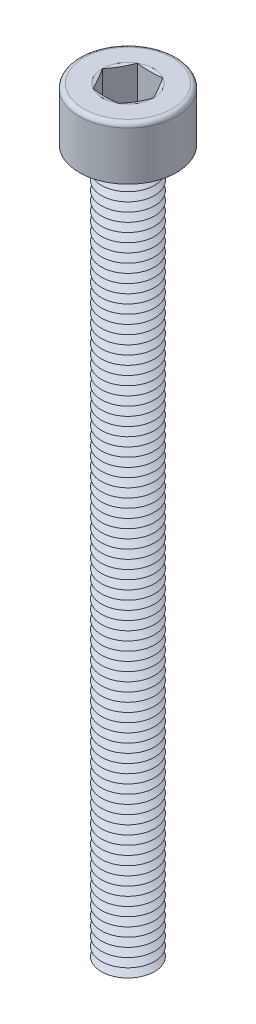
ISO-10303-21;
HEADER;
FILE_DESCRIPTION(('STEP AP214'),'2;1');
FILE_NAME('part.step','',(''),(''),'','','');
FILE_SCHEMA(('AUTOMOTIVE_DESIGN { 1 0 10303 214 1 1 1 1 }'));
ENDSEC;
DATA;
#1=APPLICATION_CONTEXT('core data for automotive mechanical design processes');
#2=APPLICATION_PROTOCOL_DEFINITION('international standard','automotive_design',2000,#1);
#3=PRODUCT_CONTEXT('',#1,'mechanical');
#4=PRODUCT('Part','Part','',(#3));
#5=PRODUCT_RELATED_PRODUCT_CATEGORY('part','',(#4));
#6=PRODUCT_DEFINITION_FORMATION('','',#4);
#7=PRODUCT_DEFINITION_CONTEXT('part definition',#1,'design');
#8=PRODUCT_DEFINITION('design','',#6,#7);
#9=PRODUCT_DEFINITION_SHAPE('','',#8);
#10=(LENGTH_UNIT() NAMED_UNIT(*) SI_UNIT(.MILLI.,.METRE.));
#11=(NAMED_UNIT(*) PLANE_ANGLE_UNIT() SI_UNIT($,.RADIAN.));
#12=(NAMED_UNIT(*) SI_UNIT($,.STERADIAN.) SOLID_ANGLE_UNIT());
#13=UNCERTAINTY_MEASURE_WITH_UNIT(LENGTH_MEASURE(1.E-05),#10,'distance_accuracy_value','');
#14=(GEOMETRIC_REPRESENTATION_CONTEXT(3) GLOBAL_UNCERTAINTY_ASSIGNED_CONTEXT((#13)) GLOBAL_UNIT_ASSIGNED_CONTEXT((#10,
#11,#12)) REPRESENTATION_CONTEXT('',''));
#15=CARTESIAN_POINT('',(0.,0.,0.));
#16=DIRECTION('',(0.,0.,1.));
#17=DIRECTION('',(1.,0.,0.));
#18=AXIS2_PLACEMENT_3D('',#15,#16,#17);
#19=CARTESIAN_POINT('',(0.,2.,0.));
#20=DIRECTION('',(0.,1.,0.));
#21=DIRECTION('',(0.,0.,1.));
#22=AXIS2_PLACEMENT_3D('',#19,#20,#21);
#23=CONICAL_SURFACE('',#22,1.06698729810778,1.0471975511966);
#24=CARTESIAN_POINT('',(0.,2.25,0.));
#25=DIRECTION('',(0.,1.,0.));
#26=DIRECTION('',(0.,0.,1.));
#27=AXIS2_PLACEMENT_3D('',#24,#25,#26);
#28=CIRCLE('',#27,1.5);
#29=CARTESIAN_POINT('',(0.,2.25,1.5));
#30=VERTEX_POINT('',#29);
#31=EDGE_CURVE('E951',#30,#30,#28,.T.);
#32=ORIENTED_EDGE('',*,*,#31,.F.);
#33=EDGE_LOOP('',(#32));
#34=FACE_BOUND('',#33,.T.);
#35=CARTESIAN_POINT('',(0.,2.,0.));
#36=DIRECTION('',(0.,1.,0.));
#37=DIRECTION('',(0.,0.,1.));
#38=AXIS2_PLACEMENT_3D('',#35,#36,#37);
#39=CIRCLE('',#38,1.06698729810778);
#40=CARTESIAN_POINT('',(0.,2.,1.06698729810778));
#41=VERTEX_POINT('',#40);
#42=EDGE_CURVE('E955',#41,#41,#39,.T.);
#43=ORIENTED_EDGE('',*,*,#42,.T.);
#44=EDGE_LOOP('',(#43));
#45=FACE_BOUND('',#44,.T.);
#46=ADVANCED_FACE('F41',(#34,#45),#23,.T.);
#47=CARTESIAN_POINT('',(0.,1.75,0.));
#48=DIRECTION('',(0.,-1.,0.));
#49=DIRECTION('',(0.,0.,-1.));
#50=AXIS2_PLACEMENT_3D('',#47,#48,#49);
#51=CONICAL_SURFACE('',#50,1.5,1.0471975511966);
#52=ORIENTED_EDGE('',*,*,#42,.F.);
#53=EDGE_LOOP('',(#52));
#54=FACE_BOUND('',#53,.T.);
#55=CARTESIAN_POINT('',(0.,1.75,0.));
#56=DIRECTION('',(0.,1.,0.));
#57=DIRECTION('',(0.,0.,1.));
#58=AXIS2_PLACEMENT_3D('',#55,#56,#57);
#59=CIRCLE('',#58,1.5);
#60=CARTESIAN_POINT('',(0.,1.75,1.5));
#61=VERTEX_POINT('',#60);
#62=EDGE_CURVE('E959',#61,#61,#59,.T.);
#63=ORIENTED_EDGE('',*,*,#62,.T.);
#64=EDGE_LOOP('',(#63));
#65=FACE_BOUND('',#64,.T.);
#66=ADVANCED_FACE('F251',(#54,#65),#51,.T.);
#67=CARTESIAN_POINT('',(0.,0.,0.));
#68=DIRECTION('',(0.,1.,0.));
#69=DIRECTION('',(0.,0.,1.));
#70=AXIS2_PLACEMENT_3D('',#67,#68,#69);
#71=PLANE('',#70);
#72=CARTESIAN_POINT('',(0.,0.,0.));
#73=DIRECTION('',(0.,1.,0.));
#74=DIRECTION('',(0.,0.,1.));
#75=AXIS2_PLACEMENT_3D('',#72,#73,#74);
#76=CIRCLE('',#75,1.06698729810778);
#77=CARTESIAN_POINT('',(0.,0.,1.06698729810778));
#78=VERTEX_POINT('',#77);
#79=EDGE_CURVE('E986',#78,#78,#76,.T.);
#80=ORIENTED_EDGE('',*,*,#79,.F.);
#81=EDGE_LOOP('',(#80));
#82=FACE_BOUND('',#81,.T.);
#83=ADVANCED_FACE('F248',(#82),#71,.F.);
#84=CARTESIAN_POINT('',(0.,0.,0.));
#85=DIRECTION('',(0.,1.,0.));
#86=DIRECTION('',(0.,0.,1.));
#87=AXIS2_PLACEMENT_3D('',#84,#85,#86);
#88=CONICAL_SURFACE('',#87,1.06698729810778,1.0471975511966);
#89=CARTESIAN_POINT('',(0.,0.25,0.));
#90=DIRECTION('',(0.,1.,0.));
#91=DIRECTION('',(0.,0.,1.));
#92=AXIS2_PLACEMENT_3D('',#89,#90,#91);
#93=CIRCLE('',#92,1.5);
#94=CARTESIAN_POINT('',(0.,0.25,1.5));
#95=VERTEX_POINT('',#94);
#96=EDGE_CURVE('E983',#95,#95,#93,.T.);
#97=ORIENTED_EDGE('',*,*,#96,.F.);
#98=EDGE_LOOP('',(#97));
#99=FACE_BOUND('',#98,.T.);
#100=ORIENTED_EDGE('',*,*,#79,.T.);
#101=EDGE_LOOP('',(#100));
#102=FACE_BOUND('',#101,.T.);
#103=ADVANCED_FACE('F250',(#99,#102),#88,.T.);
#104=CARTESIAN_POINT('',(0.,0.25,0.));
#105=DIRECTION('',(0.,-1.,0.));
#106=DIRECTION('',(0.,0.,-1.));
#107=AXIS2_PLACEMENT_3D('',#104,#105,#106);
#108=CONICAL_SURFACE('',#107,1.5,1.0471975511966);
#109=CARTESIAN_POINT('',(0.,0.5,0.));
#110=DIRECTION('',(0.,1.,0.));
#111=DIRECTION('',(0.,0.,1.));
#112=AXIS2_PLACEMENT_3D('',#109,#110,#111);
#113=CIRCLE('',#112,1.06698729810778);
#114=CARTESIAN_POINT('',(0.,0.5,1.06698729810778));
#115=VERTEX_POINT('',#114);
#116=EDGE_CURVE('E979',#115,#115,#113,.T.);
#117=ORIENTED_EDGE('',*,*,#116,.F.);
#118=EDGE_LOOP('',(#117));
#119=FACE_BOUND('',#118,.T.);
#120=ORIENTED_EDGE('',*,*,#96,.T.);
#121=EDGE_LOOP('',(#120));
#122=FACE_BOUND('',#121,.T.);
#123=ADVANCED_FACE('F291',(#119,#122),#108,.T.);
#124=CARTESIAN_POINT('',(0.,0.5,0.));
#125=DIRECTION('',(0.,1.,0.));
#126=DIRECTION('',(0.,0.,1.));
#127=AXIS2_PLACEMENT_3D('',#124,#125,#126);
#128=CONICAL_SURFACE('',#127,1.06698729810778,1.0471975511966);
#129=CARTESIAN_POINT('',(0.,0.75,0.));
#130=DIRECTION('',(0.,1.,0.));
#131=DIRECTION('',(0.,0.,1.));
#132=AXIS2_PLACEMENT_3D('',#129,#130,#131);
#133=CIRCLE('',#132,1.5);
#134=CARTESIAN_POINT('',(0.,0.75,1.5));
#135=VERTEX_POINT('',#134);
#136=EDGE_CURVE('E975',#135,#135,#133,.T.);
#137=ORIENTED_EDGE('',*,*,#136,.F.);
#138=EDGE_LOOP('',(#137));
#139=FACE_BOUND('',#138,.T.);
#140=ORIENTED_EDGE('',*,*,#116,.T.);
#141=EDGE_LOOP('',(#140));
#142=FACE_BOUND('',#141,.T.);
#143=ADVANCED_FACE('F286',(#139,#142),#128,.T.);
#144=CARTESIAN_POINT('',(0.,0.75,0.));
#145=DIRECTION('',(0.,-1.,0.));
#146=DIRECTION('',(0.,0.,-1.));
#147=AXIS2_PLACEMENT_3D('',#144,#145,#146);
#148=CONICAL_SURFACE('',#147,1.5,1.0471975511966);
#149=CARTESIAN_POINT('',(0.,1.,0.));
#150=DIRECTION('',(0.,1.,0.));
#151=DIRECTION('',(0.,0.,1.));
#152=AXIS2_PLACEMENT_3D('',#149,#150,#151);
#153=CIRCLE('',#152,1.06698729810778);
#154=CARTESIAN_POINT('',(0.,1.,1.06698729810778));
#155=VERTEX_POINT('',#154);
#156=EDGE_CURVE('E971',#155,#155,#153,.T.);
#157=ORIENTED_EDGE('',*,*,#156,.F.);
#158=EDGE_LOOP('',(#157));
#159=FACE_BOUND('',#158,.T.);
#160=ORIENTED_EDGE('',*,*,#136,.T.);
#161=EDGE_LOOP('',(#160));
#162=FACE_BOUND('',#161,.T.);
#163=ADVANCED_FACE('F283',(#159,#162),#148,.T.);
#164=CARTESIAN_POINT('',(0.,1.,0.));
#165=DIRECTION('',(0.,1.,0.));
#166=DIRECTION('',(0.,0.,1.));
#167=AXIS2_PLACEMENT_3D('',#164,#165,#166);
#168=CONICAL_SURFACE('',#167,1.06698729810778,1.0471975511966);
#169=CARTESIAN_POINT('',(0.,1.25,0.));
#170=DIRECTION('',(0.,1.,0.));
#171=DIRECTION('',(0.,0.,1.));
#172=AXIS2_PLACEMENT_3D('',#169,#170,#171);
#173=CIRCLE('',#172,1.5);
#174=CARTESIAN_POINT('',(0.,1.25,1.5));
#175=VERTEX_POINT('',#174);
#176=EDGE_CURVE('E967',#175,#175,#173,.T.);
#177=ORIENTED_EDGE('',*,*,#176,.F.);
#178=EDGE_LOOP('',(#177));
#179=FACE_BOUND('',#178,.T.);
#180=ORIENTED_EDGE('',*,*,#156,.T.);
#181=EDGE_LOOP('',(#180));
#182=FACE_BOUND('',#181,.T.);
#183=ADVANCED_FACE('F277',(#179,#182),#168,.T.);
#184=CARTESIAN_POINT('',(0.,1.25,0.));
#185=DIRECTION('',(0.,-1.,0.));
#186=DIRECTION('',(0.,0.,-1.));
#187=AXIS2_PLACEMENT_3D('',#184,#185,#186);
#188=CONICAL_SURFACE('',#187,1.5,1.0471975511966);
#189=CARTESIAN_POINT('',(0.,1.5,0.));
#190=DIRECTION('',(0.,1.,0.));
#191=DIRECTION('',(0.,0.,1.));
#192=AXIS2_PLACEMENT_3D('',#189,#190,#191);
#193=CIRCLE('',#192,1.06698729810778);
#194=CARTESIAN_POINT('',(0.,1.5,1.06698729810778));
#195=VERTEX_POINT('',#194);
#196=EDGE_CURVE('E963',#195,#195,#193,.T.);
#197=ORIENTED_EDGE('',*,*,#196,.F.);
#198=EDGE_LOOP('',(#197));
#199=FACE_BOUND('',#198,.T.);
#200=ORIENTED_EDGE('',*,*,#176,.T.);
#201=EDGE_LOOP('',(#200));
#202=FACE_BOUND('',#201,.T.);
#203=ADVANCED_FACE('F273',(#199,#202),#188,.T.);
#204=CARTESIAN_POINT('',(0.,1.5,0.));
#205=DIRECTION('',(0.,1.,0.));
#206=DIRECTION('',(0.,0.,1.));
#207=AXIS2_PLACEMENT_3D('',#204,#205,#206);
#208=CONICAL_SURFACE('',#207,1.06698729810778,1.0471975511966);
#209=ORIENTED_EDGE('',*,*,#62,.F.);
#210=EDGE_LOOP('',(#209));
#211=FACE_BOUND('',#210,.T.);
#212=ORIENTED_EDGE('',*,*,#196,.T.);
#213=EDGE_LOOP('',(#212));
#214=FACE_BOUND('',#213,.T.);
#215=ADVANCED_FACE('F276',(#211,#214),#208,.T.);
#216=CARTESIAN_POINT('',(0.,2.5,0.));
#217=DIRECTION('',(0.,1.,0.));
#218=DIRECTION('',(0.,0.,1.));
#219=AXIS2_PLACEMENT_3D('',#216,#217,#218);
#220=CONICAL_SURFACE('',#219,1.06698729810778,1.0471975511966);
#221=CARTESIAN_POINT('',(0.,2.75,0.));
#222=DIRECTION('',(0.,1.,0.));
#223=DIRECTION('',(0.,0.,1.));
#224=AXIS2_PLACEMENT_3D('',#221,#222,#223);
#225=CIRCLE('',#224,1.5);
#226=CARTESIAN_POINT('',(0.,2.75,1.5));
#227=VERTEX_POINT('',#226);
#228=EDGE_CURVE('E943',#227,#227,#225,.T.);
#229=ORIENTED_EDGE('',*,*,#228,.F.);
#230=EDGE_LOOP('',(#229));
#231=FACE_BOUND('',#230,.T.);
#232=CARTESIAN_POINT('',(0.,2.5,0.));
#233=DIRECTION('',(0.,1.,0.));
#234=DIRECTION('',(0.,0.,1.));
#235=AXIS2_PLACEMENT_3D('',#232,#233,#234);
#236=CIRCLE('',#235,1.06698729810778);
#237=CARTESIAN_POINT('',(0.,2.5,1.06698729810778));
#238=VERTEX_POINT('',#237);
#239=EDGE_CURVE('E947',#238,#238,#236,.T.);
#240=ORIENTED_EDGE('',*,*,#239,.T.);
#241=EDGE_LOOP('',(#240));
#242=FACE_BOUND('',#241,.T.);
#243=ADVANCED_FACE('F281',(#231,#242),#220,.T.);
#244=CARTESIAN_POINT('',(0.,2.25,0.));
#245=DIRECTION('',(0.,-1.,0.));
#246=DIRECTION('',(0.,0.,-1.));
#247=AXIS2_PLACEMENT_3D('',#244,#245,#246);
#248=CONICAL_SURFACE('',#247,1.5,1.0471975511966);
#249=ORIENTED_EDGE('',*,*,#239,.F.);
#250=EDGE_LOOP('',(#249));
#251=FACE_BOUND('',#250,.T.);
#252=ORIENTED_EDGE('',*,*,#31,.T.);
#253=EDGE_LOOP('',(#252));
#254=FACE_BOUND('',#253,.T.);
#255=ADVANCED_FACE('F1228',(#251,#254),#248,.T.);
#256=CARTESIAN_POINT('',(0.,3.,0.));
#257=DIRECTION('',(0.,1.,0.));
#258=DIRECTION('',(0.,0.,1.));
#259=AXIS2_PLACEMENT_3D('',#256,#257,#258);
#260=CONICAL_SURFACE('',#259,1.06698729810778,1.0471975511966);
#261=CARTESIAN_POINT('',(0.,3.25,0.));
#262=DIRECTION('',(0.,1.,0.));
#263=DIRECTION('',(0.,0.,1.));
#264=AXIS2_PLACEMENT_3D('',#261,#262,#263);
#265=CIRCLE('',#264,1.5);
#266=CARTESIAN_POINT('',(0.,3.25,1.5));
#267=VERTEX_POINT('',#266);
#268=EDGE_CURVE('E935',#267,#267,#265,.T.);
#269=ORIENTED_EDGE('',*,*,#268,.F.);
#270=EDGE_LOOP('',(#269));
#271=FACE_BOUND('',#270,.T.);
#272=CARTESIAN_POINT('',(0.,3.,0.));
#273=DIRECTION('',(0.,1.,0.));
#274=DIRECTION('',(0.,0.,1.));
#275=AXIS2_PLACEMENT_3D('',#272,#273,#274);
#276=CIRCLE('',#275,1.06698729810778);
#277=CARTESIAN_POINT('',(0.,3.,1.06698729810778));
#278=VERTEX_POINT('',#277);
#279=EDGE_CURVE('E939',#278,#278,#276,.T.);
#280=ORIENTED_EDGE('',*,*,#279,.T.);
#281=EDGE_LOOP('',(#280));
#282=FACE_BOUND('',#281,.T.);
#283=ADVANCED_FACE('F1237',(#271,#282),#260,.T.);
#284=CARTESIAN_POINT('',(0.,2.75,0.));
#285=DIRECTION('',(0.,-1.,0.));
#286=DIRECTION('',(0.,0.,-1.));
#287=AXIS2_PLACEMENT_3D('',#284,#285,#286);
#288=CONICAL_SURFACE('',#287,1.5,1.0471975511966);
#289=ORIENTED_EDGE('',*,*,#279,.F.);
#290=EDGE_LOOP('',(#289));
#291=FACE_BOUND('',#290,.T.);
#292=ORIENTED_EDGE('',*,*,#228,.T.);
#293=EDGE_LOOP('',(#292));
#294=FACE_BOUND('',#293,.T.);
#295=ADVANCED_FACE('F1247',(#291,#294),#288,.T.);
#296=CARTESIAN_POINT('',(0.,3.5,0.));
#297=DIRECTION('',(0.,1.,0.));
#298=DIRECTION('',(0.,0.,1.));
#299=AXIS2_PLACEMENT_3D('',#296,#297,#298);
#300=CONICAL_SURFACE('',#299,1.06698729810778,1.0471975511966);
#301=CARTESIAN_POINT('',(0.,3.75,0.));
#302=DIRECTION('',(0.,1.,0.));
#303=DIRECTION('',(0.,0.,1.));
#304=AXIS2_PLACEMENT_3D('',#301,#302,#303);
#305=CIRCLE('',#304,1.5);
#306=CARTESIAN_POINT('',(0.,3.75,1.5));
#307=VERTEX_POINT('',#306);
#308=EDGE_CURVE('E927',#307,#307,#305,.T.);
#309=ORIENTED_EDGE('',*,*,#308,.F.);
#310=EDGE_LOOP('',(#309));
#311=FACE_BOUND('',#310,.T.);
#312=CARTESIAN_POINT('',(0.,3.5,0.));
#313=DIRECTION('',(0.,1.,0.));
#314=DIRECTION('',(0.,0.,1.));
#315=AXIS2_PLACEMENT_3D('',#312,#313,#314);
#316=CIRCLE('',#315,1.06698729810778);
#317=CARTESIAN_POINT('',(0.,3.5,1.06698729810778));
#318=VERTEX_POINT('',#317);
#319=EDGE_CURVE('E931',#318,#318,#316,.T.);
#320=ORIENTED_EDGE('',*,*,#319,.T.);
#321=EDGE_LOOP('',(#320));
#322=FACE_BOUND('',#321,.T.);
#323=ADVANCED_FACE('F1257',(#311,#322),#300,.T.);
#324=CARTESIAN_POINT('',(0.,3.25,0.));
#325=DIRECTION('',(0.,-1.,0.));
#326=DIRECTION('',(0.,0.,-1.));
#327=AXIS2_PLACEMENT_3D('',#324,#325,#326);
#328=CONICAL_SURFACE('',#327,1.5,1.0471975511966);
#329=ORIENTED_EDGE('',*,*,#319,.F.);
#330=EDGE_LOOP('',(#329));
#331=FACE_BOUND('',#330,.T.);
#332=ORIENTED_EDGE('',*,*,#268,.T.);
#333=EDGE_LOOP('',(#332));
#334=FACE_BOUND('',#333,.T.);
#335=ADVANCED_FACE('F1267',(#331,#334),#328,.T.);
#336=CARTESIAN_POINT('',(0.,4.,0.));
#337=DIRECTION('',(0.,1.,0.));
#338=DIRECTION('',(0.,0.,1.));
#339=AXIS2_PLACEMENT_3D('',#336,#337,#338);
#340=CONICAL_SURFACE('',#339,1.06698729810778,1.0471975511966);
#341=CARTESIAN_POINT('',(0.,4.25,0.));
#342=DIRECTION('',(0.,1.,0.));
#343=DIRECTION('',(0.,0.,1.));
#344=AXIS2_PLACEMENT_3D('',#341,#342,#343);
#345=CIRCLE('',#344,1.5);
#346=CARTESIAN_POINT('',(0.,4.25,1.5));
#347=VERTEX_POINT('',#346);
#348=EDGE_CURVE('E919',#347,#347,#345,.T.);
#349=ORIENTED_EDGE('',*,*,#348,.F.);
#350=EDGE_LOOP('',(#349));
#351=FACE_BOUND('',#350,.T.);
#352=CARTESIAN_POINT('',(0.,4.,0.));
#353=DIRECTION('',(0.,1.,0.));
#354=DIRECTION('',(0.,0.,1.));
#355=AXIS2_PLACEMENT_3D('',#352,#353,#354);
#356=CIRCLE('',#355,1.06698729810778);
#357=CARTESIAN_POINT('',(0.,4.,1.06698729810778));
#358=VERTEX_POINT('',#357);
#359=EDGE_CURVE('E923',#358,#358,#356,.T.);
#360=ORIENTED_EDGE('',*,*,#359,.T.);
#361=EDGE_LOOP('',(#360));
#362=FACE_BOUND('',#361,.T.);
#363=ADVANCED_FACE('F1277',(#351,#362),#340,.T.);
#364=CARTESIAN_POINT('',(0.,3.75,0.));
#365=DIRECTION('',(0.,-1.,0.));
#366=DIRECTION('',(0.,0.,-1.));
#367=AXIS2_PLACEMENT_3D('',#364,#365,#366);
#368=CONICAL_SURFACE('',#367,1.5,1.0471975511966);
#369=ORIENTED_EDGE('',*,*,#359,.F.);
#370=EDGE_LOOP('',(#369));
#371=FACE_BOUND('',#370,.T.);
#372=ORIENTED_EDGE('',*,*,#308,.T.);
#373=EDGE_LOOP('',(#372));
#374=FACE_BOUND('',#373,.T.);
#375=ADVANCED_FACE('F1287',(#371,#374),#368,.T.);
#376=CARTESIAN_POINT('',(0.,4.5,0.));
#377=DIRECTION('',(0.,1.,0.));
#378=DIRECTION('',(0.,0.,1.));
#379=AXIS2_PLACEMENT_3D('',#376,#377,#378);
#380=CONICAL_SURFACE('',#379,1.06698729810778,1.0471975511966);
#381=CARTESIAN_POINT('',(0.,4.75,0.));
#382=DIRECTION('',(0.,1.,0.));
#383=DIRECTION('',(0.,0.,1.));
#384=AXIS2_PLACEMENT_3D('',#381,#382,#383);
#385=CIRCLE('',#384,1.5);
#386=CARTESIAN_POINT('',(0.,4.75,1.5));
#387=VERTEX_POINT('',#386);
#388=EDGE_CURVE('E911',#387,#387,#385,.T.);
#389=ORIENTED_EDGE('',*,*,#388,.F.);
#390=EDGE_LOOP('',(#389));
#391=FACE_BOUND('',#390,.T.);
#392=CARTESIAN_POINT('',(0.,4.5,0.));
#393=DIRECTION('',(0.,1.,0.));
#394=DIRECTION('',(0.,0.,1.));
#395=AXIS2_PLACEMENT_3D('',#392,#393,#394);
#396=CIRCLE('',#395,1.06698729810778);
#397=CARTESIAN_POINT('',(0.,4.5,1.06698729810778));
#398=VERTEX_POINT('',#397);
#399=EDGE_CURVE('E915',#398,#398,#396,.T.);
#400=ORIENTED_EDGE('',*,*,#399,.T.);
#401=EDGE_LOOP('',(#400));
#402=FACE_BOUND('',#401,.T.);
#403=ADVANCED_FACE('F1297',(#391,#402),#380,.T.);
#404=CARTESIAN_POINT('',(0.,4.25,0.));
#405=DIRECTION('',(0.,-1.,0.));
#406=DIRECTION('',(0.,0.,-1.));
#407=AXIS2_PLACEMENT_3D('',#404,#405,#406);
#408=CONICAL_SURFACE('',#407,1.5,1.0471975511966);
#409=ORIENTED_EDGE('',*,*,#399,.F.);
#410=EDGE_LOOP('',(#409));
#411=FACE_BOUND('',#410,.T.);
#412=ORIENTED_EDGE('',*,*,#348,.T.);
#413=EDGE_LOOP('',(#412));
#414=FACE_BOUND('',#413,.T.);
#415=ADVANCED_FACE('F1307',(#411,#414),#408,.T.);
#416=CARTESIAN_POINT('',(0.,5.,0.));
#417=DIRECTION('',(0.,1.,0.));
#418=DIRECTION('',(0.,0.,1.));
#419=AXIS2_PLACEMENT_3D('',#416,#417,#418);
#420=CONICAL_SURFACE('',#419,1.06698729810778,1.0471975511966);
#421=CARTESIAN_POINT('',(0.,5.25,0.));
#422=DIRECTION('',(0.,1.,0.));
#423=DIRECTION('',(0.,0.,1.));
#424=AXIS2_PLACEMENT_3D('',#421,#422,#423);
#425=CIRCLE('',#424,1.5);
#426=CARTESIAN_POINT('',(0.,5.25,1.5));
#427=VERTEX_POINT('',#426);
#428=EDGE_CURVE('E903',#427,#427,#425,.T.);
#429=ORIENTED_EDGE('',*,*,#428,.F.);
#430=EDGE_LOOP('',(#429));
#431=FACE_BOUND('',#430,.T.);
#432=CARTESIAN_POINT('',(0.,5.,0.));
#433=DIRECTION('',(0.,1.,0.));
#434=DIRECTION('',(0.,0.,1.));
#435=AXIS2_PLACEMENT_3D('',#432,#433,#434);
#436=CIRCLE('',#435,1.06698729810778);
#437=CARTESIAN_POINT('',(0.,5.,1.06698729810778));
#438=VERTEX_POINT('',#437);
#439=EDGE_CURVE('E907',#438,#438,#436,.T.);
#440=ORIENTED_EDGE('',*,*,#439,.T.);
#441=EDGE_LOOP('',(#440));
#442=FACE_BOUND('',#441,.T.);
#443=ADVANCED_FACE('F1317',(#431,#442),#420,.T.);
#444=CARTESIAN_POINT('',(0.,4.75,0.));
#445=DIRECTION('',(0.,-1.,0.));
#446=DIRECTION('',(0.,0.,-1.));
#447=AXIS2_PLACEMENT_3D('',#444,#445,#446);
#448=CONICAL_SURFACE('',#447,1.5,1.0471975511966);
#449=ORIENTED_EDGE('',*,*,#439,.F.);
#450=EDGE_LOOP('',(#449));
#451=FACE_BOUND('',#450,.T.);
#452=ORIENTED_EDGE('',*,*,#388,.T.);
#453=EDGE_LOOP('',(#452));
#454=FACE_BOUND('',#453,.T.);
#455=ADVANCED_FACE('F1327',(#451,#454),#448,.T.);
#456=CARTESIAN_POINT('',(0.,5.5,0.));
#457=DIRECTION('',(0.,1.,0.));
#458=DIRECTION('',(0.,0.,1.));
#459=AXIS2_PLACEMENT_3D('',#456,#457,#458);
#460=CONICAL_SURFACE('',#459,1.06698729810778,1.0471975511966);
#461=CARTESIAN_POINT('',(0.,5.75,0.));
#462=DIRECTION('',(0.,1.,0.));
#463=DIRECTION('',(0.,0.,1.));
#464=AXIS2_PLACEMENT_3D('',#461,#462,#463);
#465=CIRCLE('',#464,1.5);
#466=CARTESIAN_POINT('',(0.,5.75,1.5));
#467=VERTEX_POINT('',#466);
#468=EDGE_CURVE('E895',#467,#467,#465,.T.);
#469=ORIENTED_EDGE('',*,*,#468,.F.);
#470=EDGE_LOOP('',(#469));
#471=FACE_BOUND('',#470,.T.);
#472=CARTESIAN_POINT('',(0.,5.5,0.));
#473=DIRECTION('',(0.,1.,0.));
#474=DIRECTION('',(0.,0.,1.));
#475=AXIS2_PLACEMENT_3D('',#472,#473,#474);
#476=CIRCLE('',#475,1.06698729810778);
#477=CARTESIAN_POINT('',(0.,5.5,1.06698729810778));
#478=VERTEX_POINT('',#477);
#479=EDGE_CURVE('E899',#478,#478,#476,.T.);
#480=ORIENTED_EDGE('',*,*,#479,.T.);
#481=EDGE_LOOP('',(#480));
#482=FACE_BOUND('',#481,.T.);
#483=ADVANCED_FACE('F1337',(#471,#482),#460,.T.);
#484=CARTESIAN_POINT('',(0.,5.25,0.));
#485=DIRECTION('',(0.,-1.,0.));
#486=DIRECTION('',(0.,0.,-1.));
#487=AXIS2_PLACEMENT_3D('',#484,#485,#486);
#488=CONICAL_SURFACE('',#487,1.5,1.0471975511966);
#489=ORIENTED_EDGE('',*,*,#479,.F.);
#490=EDGE_LOOP('',(#489));
#491=FACE_BOUND('',#490,.T.);
#492=ORIENTED_EDGE('',*,*,#428,.T.);
#493=EDGE_LOOP('',(#492));
#494=FACE_BOUND('',#493,.T.);
#495=ADVANCED_FACE('F1347',(#491,#494),#488,.T.);
#496=CARTESIAN_POINT('',(0.,6.,0.));
#497=DIRECTION('',(0.,1.,0.));
#498=DIRECTION('',(0.,0.,1.));
#499=AXIS2_PLACEMENT_3D('',#496,#497,#498);
#500=CONICAL_SURFACE('',#499,1.06698729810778,1.0471975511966);
#501=CARTESIAN_POINT('',(0.,6.25,0.));
#502=DIRECTION('',(0.,1.,0.));
#503=DIRECTION('',(0.,0.,1.));
#504=AXIS2_PLACEMENT_3D('',#501,#502,#503);
#505=CIRCLE('',#504,1.5);
#506=CARTESIAN_POINT('',(0.,6.25,1.5));
#507=VERTEX_POINT('',#506);
#508=EDGE_CURVE('E887',#507,#507,#505,.T.);
#509=ORIENTED_EDGE('',*,*,#508,.F.);
#510=EDGE_LOOP('',(#509));
#511=FACE_BOUND('',#510,.T.);
#512=CARTESIAN_POINT('',(0.,6.,0.));
#513=DIRECTION('',(0.,1.,0.));
#514=DIRECTION('',(0.,0.,1.));
#515=AXIS2_PLACEMENT_3D('',#512,#513,#514);
#516=CIRCLE('',#515,1.06698729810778);
#517=CARTESIAN_POINT('',(0.,6.,1.06698729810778));
#518=VERTEX_POINT('',#517);
#519=EDGE_CURVE('E891',#518,#518,#516,.T.);
#520=ORIENTED_EDGE('',*,*,#519,.T.);
#521=EDGE_LOOP('',(#520));
#522=FACE_BOUND('',#521,.T.);
#523=ADVANCED_FACE('F1357',(#511,#522),#500,.T.);
#524=CARTESIAN_POINT('',(0.,5.75,0.));
#525=DIRECTION('',(0.,-1.,0.));
#526=DIRECTION('',(0.,0.,-1.));
#527=AXIS2_PLACEMENT_3D('',#524,#525,#526);
#528=CONICAL_SURFACE('',#527,1.5,1.0471975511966);
#529=ORIENTED_EDGE('',*,*,#519,.F.);
#530=EDGE_LOOP('',(#529));
#531=FACE_BOUND('',#530,.T.);
#532=ORIENTED_EDGE('',*,*,#468,.T.);
#533=EDGE_LOOP('',(#532));
#534=FACE_BOUND('',#533,.T.);
#535=ADVANCED_FACE('F1367',(#531,#534),#528,.T.);
#536=CARTESIAN_POINT('',(0.,6.5,0.));
#537=DIRECTION('',(0.,1.,0.));
#538=DIRECTION('',(0.,0.,1.));
#539=AXIS2_PLACEMENT_3D('',#536,#537,#538);
#540=CONICAL_SURFACE('',#539,1.06698729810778,1.0471975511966);
#541=CARTESIAN_POINT('',(0.,6.75,0.));
#542=DIRECTION('',(0.,1.,0.));
#543=DIRECTION('',(0.,0.,1.));
#544=AXIS2_PLACEMENT_3D('',#541,#542,#543);
#545=CIRCLE('',#544,1.5);
#546=CARTESIAN_POINT('',(0.,6.75,1.5));
#547=VERTEX_POINT('',#546);
#548=EDGE_CURVE('E879',#547,#547,#545,.T.);
#549=ORIENTED_EDGE('',*,*,#548,.F.);
#550=EDGE_LOOP('',(#549));
#551=FACE_BOUND('',#550,.T.);
#552=CARTESIAN_POINT('',(0.,6.5,0.));
#553=DIRECTION('',(0.,1.,0.));
#554=DIRECTION('',(0.,0.,1.));
#555=AXIS2_PLACEMENT_3D('',#552,#553,#554);
#556=CIRCLE('',#555,1.06698729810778);
#557=CARTESIAN_POINT('',(0.,6.5,1.06698729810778));
#558=VERTEX_POINT('',#557);
#559=EDGE_CURVE('E883',#558,#558,#556,.T.);
#560=ORIENTED_EDGE('',*,*,#559,.T.);
#561=EDGE_LOOP('',(#560));
#562=FACE_BOUND('',#561,.T.);
#563=ADVANCED_FACE('F1377',(#551,#562),#540,.T.);
#564=CARTESIAN_POINT('',(0.,6.25,0.));
#565=DIRECTION('',(0.,-1.,0.));
#566=DIRECTION('',(0.,0.,-1.));
#567=AXIS2_PLACEMENT_3D('',#564,#565,#566);
#568=CONICAL_SURFACE('',#567,1.5,1.0471975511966);
#569=ORIENTED_EDGE('',*,*,#559,.F.);
#570=EDGE_LOOP('',(#569));
#571=FACE_BOUND('',#570,.T.);
#572=ORIENTED_EDGE('',*,*,#508,.T.);
#573=EDGE_LOOP('',(#572));
#574=FACE_BOUND('',#573,.T.);
#575=ADVANCED_FACE('F1387',(#571,#574),#568,.T.);
#576=CARTESIAN_POINT('',(0.,7.,0.));
#577=DIRECTION('',(0.,1.,0.));
#578=DIRECTION('',(0.,0.,1.));
#579=AXIS2_PLACEMENT_3D('',#576,#577,#578);
#580=CONICAL_SURFACE('',#579,1.06698729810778,1.0471975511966);
#581=CARTESIAN_POINT('',(0.,7.25,0.));
#582=DIRECTION('',(0.,1.,0.));
#583=DIRECTION('',(0.,0.,1.));
#584=AXIS2_PLACEMENT_3D('',#581,#582,#583);
#585=CIRCLE('',#584,1.5);
#586=CARTESIAN_POINT('',(0.,7.25,1.5));
#587=VERTEX_POINT('',#586);
#588=EDGE_CURVE('E871',#587,#587,#585,.T.);
#589=ORIENTED_EDGE('',*,*,#588,.F.);
#590=EDGE_LOOP('',(#589));
#591=FACE_BOUND('',#590,.T.);
#592=CARTESIAN_POINT('',(0.,7.,0.));
#593=DIRECTION('',(0.,1.,0.));
#594=DIRECTION('',(0.,0.,1.));
#595=AXIS2_PLACEMENT_3D('',#592,#593,#594);
#596=CIRCLE('',#595,1.06698729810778);
#597=CARTESIAN_POINT('',(0.,7.,1.06698729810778));
#598=VERTEX_POINT('',#597);
#599=EDGE_CURVE('E875',#598,#598,#596,.T.);
#600=ORIENTED_EDGE('',*,*,#599,.T.);
#601=EDGE_LOOP('',(#600));
#602=FACE_BOUND('',#601,.T.);
#603=ADVANCED_FACE('F1397',(#591,#602),#580,.T.);
#604=CARTESIAN_POINT('',(0.,6.75,0.));
#605=DIRECTION('',(0.,-1.,0.));
#606=DIRECTION('',(0.,0.,-1.));
#607=AXIS2_PLACEMENT_3D('',#604,#605,#606);
#608=CONICAL_SURFACE('',#607,1.5,1.0471975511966);
#609=ORIENTED_EDGE('',*,*,#599,.F.);
#610=EDGE_LOOP('',(#609));
#611=FACE_BOUND('',#610,.T.);
#612=ORIENTED_EDGE('',*,*,#548,.T.);
#613=EDGE_LOOP('',(#612));
#614=FACE_BOUND('',#613,.T.);
#615=ADVANCED_FACE('F1407',(#611,#614),#608,.T.);
#616=CARTESIAN_POINT('',(0.,7.5,0.));
#617=DIRECTION('',(0.,1.,0.));
#618=DIRECTION('',(0.,0.,1.));
#619=AXIS2_PLACEMENT_3D('',#616,#617,#618);
#620=CONICAL_SURFACE('',#619,1.06698729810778,1.0471975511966);
#621=CARTESIAN_POINT('',(0.,7.75,0.));
#622=DIRECTION('',(0.,1.,0.));
#623=DIRECTION('',(0.,0.,1.));
#624=AXIS2_PLACEMENT_3D('',#621,#622,#623);
#625=CIRCLE('',#624,1.5);
#626=CARTESIAN_POINT('',(0.,7.75,1.5));
#627=VERTEX_POINT('',#626);
#628=EDGE_CURVE('E863',#627,#627,#625,.T.);
#629=ORIENTED_EDGE('',*,*,#628,.F.);
#630=EDGE_LOOP('',(#629));
#631=FACE_BOUND('',#630,.T.);
#632=CARTESIAN_POINT('',(0.,7.5,0.));
#633=DIRECTION('',(0.,1.,0.));
#634=DIRECTION('',(0.,0.,1.));
#635=AXIS2_PLACEMENT_3D('',#632,#633,#634);
#636=CIRCLE('',#635,1.06698729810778);
#637=CARTESIAN_POINT('',(0.,7.5,1.06698729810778));
#638=VERTEX_POINT('',#637);
#639=EDGE_CURVE('E867',#638,#638,#636,.T.);
#640=ORIENTED_EDGE('',*,*,#639,.T.);
#641=EDGE_LOOP('',(#640));
#642=FACE_BOUND('',#641,.T.);
#643=ADVANCED_FACE('F1417',(#631,#642),#620,.T.);
#644=CARTESIAN_POINT('',(0.,7.25,0.));
#645=DIRECTION('',(0.,-1.,0.));
#646=DIRECTION('',(0.,0.,-1.));
#647=AXIS2_PLACEMENT_3D('',#644,#645,#646);
#648=CONICAL_SURFACE('',#647,1.5,1.0471975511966);
#649=ORIENTED_EDGE('',*,*,#639,.F.);
#650=EDGE_LOOP('',(#649));
#651=FACE_BOUND('',#650,.T.);
#652=ORIENTED_EDGE('',*,*,#588,.T.);
#653=EDGE_LOOP('',(#652));
#654=FACE_BOUND('',#653,.T.);
#655=ADVANCED_FACE('F1427',(#651,#654),#648,.T.);
#656=CARTESIAN_POINT('',(0.,8.,0.));
#657=DIRECTION('',(0.,1.,0.));
#658=DIRECTION('',(0.,0.,1.));
#659=AXIS2_PLACEMENT_3D('',#656,#657,#658);
#660=CONICAL_SURFACE('',#659,1.06698729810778,1.0471975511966);
#661=CARTESIAN_POINT('',(0.,8.25,0.));
#662=DIRECTION('',(0.,1.,0.));
#663=DIRECTION('',(0.,0.,1.));
#664=AXIS2_PLACEMENT_3D('',#661,#662,#663);
#665=CIRCLE('',#664,1.5);
#666=CARTESIAN_POINT('',(0.,8.25,1.5));
#667=VERTEX_POINT('',#666);
#668=EDGE_CURVE('E855',#667,#667,#665,.T.);
#669=ORIENTED_EDGE('',*,*,#668,.F.);
#670=EDGE_LOOP('',(#669));
#671=FACE_BOUND('',#670,.T.);
#672=CARTESIAN_POINT('',(0.,8.,0.));
#673=DIRECTION('',(0.,1.,0.));
#674=DIRECTION('',(0.,0.,1.));
#675=AXIS2_PLACEMENT_3D('',#672,#673,#674);
#676=CIRCLE('',#675,1.06698729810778);
#677=CARTESIAN_POINT('',(0.,8.,1.06698729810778));
#678=VERTEX_POINT('',#677);
#679=EDGE_CURVE('E859',#678,#678,#676,.T.);
#680=ORIENTED_EDGE('',*,*,#679,.T.);
#681=EDGE_LOOP('',(#680));
#682=FACE_BOUND('',#681,.T.);
#683=ADVANCED_FACE('F1437',(#671,#682),#660,.T.);
#684=CARTESIAN_POINT('',(0.,7.75,0.));
#685=DIRECTION('',(0.,-1.,0.));
#686=DIRECTION('',(0.,0.,-1.));
#687=AXIS2_PLACEMENT_3D('',#684,#685,#686);
#688=CONICAL_SURFACE('',#687,1.5,1.0471975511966);
#689=ORIENTED_EDGE('',*,*,#679,.F.);
#690=EDGE_LOOP('',(#689));
#691=FACE_BOUND('',#690,.T.);
#692=ORIENTED_EDGE('',*,*,#628,.T.);
#693=EDGE_LOOP('',(#692));
#694=FACE_BOUND('',#693,.T.);
#695=ADVANCED_FACE('F1447',(#691,#694),#688,.T.);
#696=CARTESIAN_POINT('',(0.,8.5,0.));
#697=DIRECTION('',(0.,1.,0.));
#698=DIRECTION('',(0.,0.,1.));
#699=AXIS2_PLACEMENT_3D('',#696,#697,#698);
#700=CONICAL_SURFACE('',#699,1.06698729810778,1.0471975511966);
#701=CARTESIAN_POINT('',(0.,8.75,0.));
#702=DIRECTION('',(0.,1.,0.));
#703=DIRECTION('',(0.,0.,1.));
#704=AXIS2_PLACEMENT_3D('',#701,#702,#703);
#705=CIRCLE('',#704,1.5);
#706=CARTESIAN_POINT('',(0.,8.75,1.5));
#707=VERTEX_POINT('',#706);
#708=EDGE_CURVE('E847',#707,#707,#705,.T.);
#709=ORIENTED_EDGE('',*,*,#708,.F.);
#710=EDGE_LOOP('',(#709));
#711=FACE_BOUND('',#710,.T.);
#712=CARTESIAN_POINT('',(0.,8.5,0.));
#713=DIRECTION('',(0.,1.,0.));
#714=DIRECTION('',(0.,0.,1.));
#715=AXIS2_PLACEMENT_3D('',#712,#713,#714);
#716=CIRCLE('',#715,1.06698729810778);
#717=CARTESIAN_POINT('',(0.,8.5,1.06698729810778));
#718=VERTEX_POINT('',#717);
#719=EDGE_CURVE('E851',#718,#718,#716,.T.);
#720=ORIENTED_EDGE('',*,*,#719,.T.);
#721=EDGE_LOOP('',(#720));
#722=FACE_BOUND('',#721,.T.);
#723=ADVANCED_FACE('F1457',(#711,#722),#700,.T.);
#724=CARTESIAN_POINT('',(0.,8.25,0.));
#725=DIRECTION('',(0.,-1.,0.));
#726=DIRECTION('',(0.,0.,-1.));
#727=AXIS2_PLACEMENT_3D('',#724,#725,#726);
#728=CONICAL_SURFACE('',#727,1.5,1.0471975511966);
#729=ORIENTED_EDGE('',*,*,#719,.F.);
#730=EDGE_LOOP('',(#729));
#731=FACE_BOUND('',#730,.T.);
#732=ORIENTED_EDGE('',*,*,#668,.T.);
#733=EDGE_LOOP('',(#732));
#734=FACE_BOUND('',#733,.T.);
#735=ADVANCED_FACE('F1467',(#731,#734),#728,.T.);
#736=CARTESIAN_POINT('',(0.,9.,0.));
#737=DIRECTION('',(0.,1.,0.));
#738=DIRECTION('',(0.,0.,1.));
#739=AXIS2_PLACEMENT_3D('',#736,#737,#738);
#740=CONICAL_SURFACE('',#739,1.06698729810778,1.0471975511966);
#741=CARTESIAN_POINT('',(0.,9.25,0.));
#742=DIRECTION('',(0.,1.,0.));
#743=DIRECTION('',(0.,0.,1.));
#744=AXIS2_PLACEMENT_3D('',#741,#742,#743);
#745=CIRCLE('',#744,1.5);
#746=CARTESIAN_POINT('',(0.,9.25,1.5));
#747=VERTEX_POINT('',#746);
#748=EDGE_CURVE('E839',#747,#747,#745,.T.);
#749=ORIENTED_EDGE('',*,*,#748,.F.);
#750=EDGE_LOOP('',(#749));
#751=FACE_BOUND('',#750,.T.);
#752=CARTESIAN_POINT('',(0.,9.,0.));
#753=DIRECTION('',(0.,1.,0.));
#754=DIRECTION('',(0.,0.,1.));
#755=AXIS2_PLACEMENT_3D('',#752,#753,#754);
#756=CIRCLE('',#755,1.06698729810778);
#757=CARTESIAN_POINT('',(0.,9.,1.06698729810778));
#758=VERTEX_POINT('',#757);
#759=EDGE_CURVE('E843',#758,#758,#756,.T.);
#760=ORIENTED_EDGE('',*,*,#759,.T.);
#761=EDGE_LOOP('',(#760));
#762=FACE_BOUND('',#761,.T.);
#763=ADVANCED_FACE('F1477',(#751,#762),#740,.T.);
#764=CARTESIAN_POINT('',(0.,8.75,0.));
#765=DIRECTION('',(0.,-1.,0.));
#766=DIRECTION('',(0.,0.,-1.));
#767=AXIS2_PLACEMENT_3D('',#764,#765,#766);
#768=CONICAL_SURFACE('',#767,1.5,1.0471975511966);
#769=ORIENTED_EDGE('',*,*,#759,.F.);
#770=EDGE_LOOP('',(#769));
#771=FACE_BOUND('',#770,.T.);
#772=ORIENTED_EDGE('',*,*,#708,.T.);
#773=EDGE_LOOP('',(#772));
#774=FACE_BOUND('',#773,.T.);
#775=ADVANCED_FACE('F1487',(#771,#774),#768,.T.);
#776=CARTESIAN_POINT('',(0.,9.5,0.));
#777=DIRECTION('',(0.,1.,0.));
#778=DIRECTION('',(0.,0.,1.));
#779=AXIS2_PLACEMENT_3D('',#776,#777,#778);
#780=CONICAL_SURFACE('',#779,1.06698729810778,1.0471975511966);
#781=CARTESIAN_POINT('',(0.,9.75,0.));
#782=DIRECTION('',(0.,1.,0.));
#783=DIRECTION('',(0.,0.,1.));
#784=AXIS2_PLACEMENT_3D('',#781,#782,#783);
#785=CIRCLE('',#784,1.5);
#786=CARTESIAN_POINT('',(0.,9.75,1.5));
#787=VERTEX_POINT('',#786);
#788=EDGE_CURVE('E831',#787,#787,#785,.T.);
#789=ORIENTED_EDGE('',*,*,#788,.F.);
#790=EDGE_LOOP('',(#789));
#791=FACE_BOUND('',#790,.T.);
#792=CARTESIAN_POINT('',(0.,9.5,0.));
#793=DIRECTION('',(0.,1.,0.));
#794=DIRECTION('',(0.,0.,1.));
#795=AXIS2_PLACEMENT_3D('',#792,#793,#794);
#796=CIRCLE('',#795,1.06698729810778);
#797=CARTESIAN_POINT('',(0.,9.5,1.06698729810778));
#798=VERTEX_POINT('',#797);
#799=EDGE_CURVE('E835',#798,#798,#796,.T.);
#800=ORIENTED_EDGE('',*,*,#799,.T.);
#801=EDGE_LOOP('',(#800));
#802=FACE_BOUND('',#801,.T.);
#803=ADVANCED_FACE('F1497',(#791,#802),#780,.T.);
#804=CARTESIAN_POINT('',(0.,9.25,0.));
#805=DIRECTION('',(0.,-1.,0.));
#806=DIRECTION('',(0.,0.,-1.));
#807=AXIS2_PLACEMENT_3D('',#804,#805,#806);
#808=CONICAL_SURFACE('',#807,1.5,1.0471975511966);
#809=ORIENTED_EDGE('',*,*,#799,.F.);
#810=EDGE_LOOP('',(#809));
#811=FACE_BOUND('',#810,.T.);
#812=ORIENTED_EDGE('',*,*,#748,.T.);
#813=EDGE_LOOP('',(#812));
#814=FACE_BOUND('',#813,.T.);
#815=ADVANCED_FACE('F1507',(#811,#814),#808,.T.);
#816=CARTESIAN_POINT('',(0.,10.,0.));
#817=DIRECTION('',(0.,1.,0.));
#818=DIRECTION('',(0.,0.,1.));
#819=AXIS2_PLACEMENT_3D('',#816,#817,#818);
#820=CONICAL_SURFACE('',#819,1.06698729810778,1.0471975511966);
#821=CARTESIAN_POINT('',(0.,10.25,0.));
#822=DIRECTION('',(0.,1.,0.));
#823=DIRECTION('',(0.,0.,1.));
#824=AXIS2_PLACEMENT_3D('',#821,#822,#823);
#825=CIRCLE('',#824,1.5);
#826=CARTESIAN_POINT('',(0.,10.25,1.5));
#827=VERTEX_POINT('',#826);
#828=EDGE_CURVE('E823',#827,#827,#825,.T.);
#829=ORIENTED_EDGE('',*,*,#828,.F.);
#830=EDGE_LOOP('',(#829));
#831=FACE_BOUND('',#830,.T.);
#832=CARTESIAN_POINT('',(0.,10.,0.));
#833=DIRECTION('',(0.,1.,0.));
#834=DIRECTION('',(0.,0.,1.));
#835=AXIS2_PLACEMENT_3D('',#832,#833,#834);
#836=CIRCLE('',#835,1.06698729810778);
#837=CARTESIAN_POINT('',(0.,10.,1.06698729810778));
#838=VERTEX_POINT('',#837);
#839=EDGE_CURVE('E827',#838,#838,#836,.T.);
#840=ORIENTED_EDGE('',*,*,#839,.T.);
#841=EDGE_LOOP('',(#840));
#842=FACE_BOUND('',#841,.T.);
#843=ADVANCED_FACE('F1517',(#831,#842),#820,.T.);
#844=CARTESIAN_POINT('',(0.,9.75,0.));
#845=DIRECTION('',(0.,-1.,0.));
#846=DIRECTION('',(0.,0.,-1.));
#847=AXIS2_PLACEMENT_3D('',#844,#845,#846);
#848=CONICAL_SURFACE('',#847,1.5,1.0471975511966);
#849=ORIENTED_EDGE('',*,*,#839,.F.);
#850=EDGE_LOOP('',(#849));
#851=FACE_BOUND('',#850,.T.);
#852=ORIENTED_EDGE('',*,*,#788,.T.);
#853=EDGE_LOOP('',(#852));
#854=FACE_BOUND('',#853,.T.);
#855=ADVANCED_FACE('F1527',(#851,#854),#848,.T.);
#856=CARTESIAN_POINT('',(0.,10.5,0.));
#857=DIRECTION('',(0.,1.,0.));
#858=DIRECTION('',(0.,0.,1.));
#859=AXIS2_PLACEMENT_3D('',#856,#857,#858);
#860=CONICAL_SURFACE('',#859,1.06698729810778,1.0471975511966);
#861=CARTESIAN_POINT('',(0.,10.75,0.));
#862=DIRECTION('',(0.,1.,0.));
#863=DIRECTION('',(0.,0.,1.));
#864=AXIS2_PLACEMENT_3D('',#861,#862,#863);
#865=CIRCLE('',#864,1.5);
#866=CARTESIAN_POINT('',(0.,10.75,1.5));
#867=VERTEX_POINT('',#866);
#868=EDGE_CURVE('E815',#867,#867,#865,.T.);
#869=ORIENTED_EDGE('',*,*,#868,.F.);
#870=EDGE_LOOP('',(#869));
#871=FACE_BOUND('',#870,.T.);
#872=CARTESIAN_POINT('',(0.,10.5,0.));
#873=DIRECTION('',(0.,1.,0.));
#874=DIRECTION('',(0.,0.,1.));
#875=AXIS2_PLACEMENT_3D('',#872,#873,#874);
#876=CIRCLE('',#875,1.06698729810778);
#877=CARTESIAN_POINT('',(0.,10.5,1.06698729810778));
#878=VERTEX_POINT('',#877);
#879=EDGE_CURVE('E819',#878,#878,#876,.T.);
#880=ORIENTED_EDGE('',*,*,#879,.T.);
#881=EDGE_LOOP('',(#880));
#882=FACE_BOUND('',#881,.T.);
#883=ADVANCED_FACE('F1537',(#871,#882),#860,.T.);
#884=CARTESIAN_POINT('',(0.,10.25,0.));
#885=DIRECTION('',(0.,-1.,0.));
#886=DIRECTION('',(0.,0.,-1.));
#887=AXIS2_PLACEMENT_3D('',#884,#885,#886);
#888=CONICAL_SURFACE('',#887,1.5,1.0471975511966);
#889=ORIENTED_EDGE('',*,*,#879,.F.);
#890=EDGE_LOOP('',(#889));
#891=FACE_BOUND('',#890,.T.);
#892=ORIENTED_EDGE('',*,*,#828,.T.);
#893=EDGE_LOOP('',(#892));
#894=FACE_BOUND('',#893,.T.);
#895=ADVANCED_FACE('F1547',(#891,#894),#888,.T.);
#896=CARTESIAN_POINT('',(0.,11.,0.));
#897=DIRECTION('',(0.,1.,0.));
#898=DIRECTION('',(0.,0.,1.));
#899=AXIS2_PLACEMENT_3D('',#896,#897,#898);
#900=CONICAL_SURFACE('',#899,1.06698729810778,1.0471975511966);
#901=CARTESIAN_POINT('',(0.,11.25,0.));
#902=DIRECTION('',(0.,1.,0.));
#903=DIRECTION('',(0.,0.,1.));
#904=AXIS2_PLACEMENT_3D('',#901,#902,#903);
#905=CIRCLE('',#904,1.5);
#906=CARTESIAN_POINT('',(0.,11.25,1.5));
#907=VERTEX_POINT('',#906);
#908=EDGE_CURVE('E807',#907,#907,#905,.T.);
#909=ORIENTED_EDGE('',*,*,#908,.F.);
#910=EDGE_LOOP('',(#909));
#911=FACE_BOUND('',#910,.T.);
#912=CARTESIAN_POINT('',(0.,11.,0.));
#913=DIRECTION('',(0.,1.,0.));
#914=DIRECTION('',(0.,0.,1.));
#915=AXIS2_PLACEMENT_3D('',#912,#913,#914);
#916=CIRCLE('',#915,1.06698729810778);
#917=CARTESIAN_POINT('',(0.,11.,1.06698729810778));
#918=VERTEX_POINT('',#917);
#919=EDGE_CURVE('E811',#918,#918,#916,.T.);
#920=ORIENTED_EDGE('',*,*,#919,.T.);
#921=EDGE_LOOP('',(#920));
#922=FACE_BOUND('',#921,.T.);
#923=ADVANCED_FACE('F1557',(#911,#922),#900,.T.);
#924=CARTESIAN_POINT('',(0.,10.75,0.));
#925=DIRECTION('',(0.,-1.,0.));
#926=DIRECTION('',(0.,0.,-1.));
#927=AXIS2_PLACEMENT_3D('',#924,#925,#926);
#928=CONICAL_SURFACE('',#927,1.5,1.0471975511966);
#929=ORIENTED_EDGE('',*,*,#919,.F.);
#930=EDGE_LOOP('',(#929));
#931=FACE_BOUND('',#930,.T.);
#932=ORIENTED_EDGE('',*,*,#868,.T.);
#933=EDGE_LOOP('',(#932));
#934=FACE_BOUND('',#933,.T.);
#935=ADVANCED_FACE('F1567',(#931,#934),#928,.T.);
#936=CARTESIAN_POINT('',(0.,11.5,0.));
#937=DIRECTION('',(0.,1.,0.));
#938=DIRECTION('',(0.,0.,1.));
#939=AXIS2_PLACEMENT_3D('',#936,#937,#938);
#940=CONICAL_SURFACE('',#939,1.06698729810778,1.0471975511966);
#941=CARTESIAN_POINT('',(0.,11.75,0.));
#942=DIRECTION('',(0.,1.,0.));
#943=DIRECTION('',(0.,0.,1.));
#944=AXIS2_PLACEMENT_3D('',#941,#942,#943);
#945=CIRCLE('',#944,1.5);
#946=CARTESIAN_POINT('',(0.,11.75,1.5));
#947=VERTEX_POINT('',#946);
#948=EDGE_CURVE('E799',#947,#947,#945,.T.);
#949=ORIENTED_EDGE('',*,*,#948,.F.);
#950=EDGE_LOOP('',(#949));
#951=FACE_BOUND('',#950,.T.);
#952=CARTESIAN_POINT('',(0.,11.5,0.));
#953=DIRECTION('',(0.,1.,0.));
#954=DIRECTION('',(0.,0.,1.));
#955=AXIS2_PLACEMENT_3D('',#952,#953,#954);
#956=CIRCLE('',#955,1.06698729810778);
#957=CARTESIAN_POINT('',(0.,11.5,1.06698729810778));
#958=VERTEX_POINT('',#957);
#959=EDGE_CURVE('E803',#958,#958,#956,.T.);
#960=ORIENTED_EDGE('',*,*,#959,.T.);
#961=EDGE_LOOP('',(#960));
#962=FACE_BOUND('',#961,.T.);
#963=ADVANCED_FACE('F1577',(#951,#962),#940,.T.);
#964=CARTESIAN_POINT('',(0.,11.25,0.));
#965=DIRECTION('',(0.,-1.,0.));
#966=DIRECTION('',(0.,0.,-1.));
#967=AXIS2_PLACEMENT_3D('',#964,#965,#966);
#968=CONICAL_SURFACE('',#967,1.5,1.0471975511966);
#969=ORIENTED_EDGE('',*,*,#959,.F.);
#970=EDGE_LOOP('',(#969));
#971=FACE_BOUND('',#970,.T.);
#972=ORIENTED_EDGE('',*,*,#908,.T.);
#973=EDGE_LOOP('',(#972));
#974=FACE_BOUND('',#973,.T.);
#975=ADVANCED_FACE('F1587',(#971,#974),#968,.T.);
#976=CARTESIAN_POINT('',(0.,12.,0.));
#977=DIRECTION('',(0.,1.,0.));
#978=DIRECTION('',(0.,0.,1.));
#979=AXIS2_PLACEMENT_3D('',#976,#977,#978);
#980=CONICAL_SURFACE('',#979,1.06698729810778,1.0471975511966);
#981=CARTESIAN_POINT('',(0.,12.25,0.));
#982=DIRECTION('',(0.,1.,0.));
#983=DIRECTION('',(0.,0.,1.));
#984=AXIS2_PLACEMENT_3D('',#981,#982,#983);
#985=CIRCLE('',#984,1.5);
#986=CARTESIAN_POINT('',(0.,12.25,1.5));
#987=VERTEX_POINT('',#986);
#988=EDGE_CURVE('E791',#987,#987,#985,.T.);
#989=ORIENTED_EDGE('',*,*,#988,.F.);
#990=EDGE_LOOP('',(#989));
#991=FACE_BOUND('',#990,.T.);
#992=CARTESIAN_POINT('',(0.,12.,0.));
#993=DIRECTION('',(0.,1.,0.));
#994=DIRECTION('',(0.,0.,1.));
#995=AXIS2_PLACEMENT_3D('',#992,#993,#994);
#996=CIRCLE('',#995,1.06698729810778);
#997=CARTESIAN_POINT('',(0.,12.,1.06698729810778));
#998=VERTEX_POINT('',#997);
#999=EDGE_CURVE('E795',#998,#998,#996,.T.);
#1000=ORIENTED_EDGE('',*,*,#999,.T.);
#1001=EDGE_LOOP('',(#1000));
#1002=FACE_BOUND('',#1001,.T.);
#1003=ADVANCED_FACE('F1597',(#991,#1002),#980,.T.);
#1004=CARTESIAN_POINT('',(0.,11.75,0.));
#1005=DIRECTION('',(0.,-1.,0.));
#1006=DIRECTION('',(0.,0.,-1.));
#1007=AXIS2_PLACEMENT_3D('',#1004,#1005,#1006);
#1008=CONICAL_SURFACE('',#1007,1.5,1.0471975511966);
#1009=ORIENTED_EDGE('',*,*,#999,.F.);
#1010=EDGE_LOOP('',(#1009));
#1011=FACE_BOUND('',#1010,.T.);
#1012=ORIENTED_EDGE('',*,*,#948,.T.);
#1013=EDGE_LOOP('',(#1012));
#1014=FACE_BOUND('',#1013,.T.);
#1015=ADVANCED_FACE('F1607',(#1011,#1014),#1008,.T.);
#1016=CARTESIAN_POINT('',(0.,12.5,0.));
#1017=DIRECTION('',(0.,1.,0.));
#1018=DIRECTION('',(0.,0.,1.));
#1019=AXIS2_PLACEMENT_3D('',#1016,#1017,#1018);
#1020=CONICAL_SURFACE('',#1019,1.06698729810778,1.0471975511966);
#1021=CARTESIAN_POINT('',(0.,12.75,0.));
#1022=DIRECTION('',(0.,1.,0.));
#1023=DIRECTION('',(0.,0.,1.));
#1024=AXIS2_PLACEMENT_3D('',#1021,#1022,#1023);
#1025=CIRCLE('',#1024,1.5);
#1026=CARTESIAN_POINT('',(0.,12.75,1.5));
#1027=VERTEX_POINT('',#1026);
#1028=EDGE_CURVE('E783',#1027,#1027,#1025,.T.);
#1029=ORIENTED_EDGE('',*,*,#1028,.F.);
#1030=EDGE_LOOP('',(#1029));
#1031=FACE_BOUND('',#1030,.T.);
#1032=CARTESIAN_POINT('',(0.,12.5,0.));
#1033=DIRECTION('',(0.,1.,0.));
#1034=DIRECTION('',(0.,0.,1.));
#1035=AXIS2_PLACEMENT_3D('',#1032,#1033,#1034);
#1036=CIRCLE('',#1035,1.06698729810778);
#1037=CARTESIAN_POINT('',(0.,12.5,1.06698729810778));
#1038=VERTEX_POINT('',#1037);
#1039=EDGE_CURVE('E787',#1038,#1038,#1036,.T.);
#1040=ORIENTED_EDGE('',*,*,#1039,.T.);
#1041=EDGE_LOOP('',(#1040));
#1042=FACE_BOUND('',#1041,.T.);
#1043=ADVANCED_FACE('F1617',(#1031,#1042),#1020,.T.);
#1044=CARTESIAN_POINT('',(0.,12.25,0.));
#1045=DIRECTION('',(0.,-1.,0.));
#1046=DIRECTION('',(0.,0.,-1.));
#1047=AXIS2_PLACEMENT_3D('',#1044,#1045,#1046);
#1048=CONICAL_SURFACE('',#1047,1.5,1.0471975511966);
#1049=ORIENTED_EDGE('',*,*,#1039,.F.);
#1050=EDGE_LOOP('',(#1049));
#1051=FACE_BOUND('',#1050,.T.);
#1052=ORIENTED_EDGE('',*,*,#988,.T.);
#1053=EDGE_LOOP('',(#1052));
#1054=FACE_BOUND('',#1053,.T.);
#1055=ADVANCED_FACE('F1627',(#1051,#1054),#1048,.T.);
#1056=CARTESIAN_POINT('',(0.,13.,0.));
#1057=DIRECTION('',(0.,1.,0.));
#1058=DIRECTION('',(0.,0.,1.));
#1059=AXIS2_PLACEMENT_3D('',#1056,#1057,#1058);
#1060=CONICAL_SURFACE('',#1059,1.06698729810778,1.0471975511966);
#1061=CARTESIAN_POINT('',(0.,13.25,0.));
#1062=DIRECTION('',(0.,1.,0.));
#1063=DIRECTION('',(0.,0.,1.));
#1064=AXIS2_PLACEMENT_3D('',#1061,#1062,#1063);
#1065=CIRCLE('',#1064,1.5);
#1066=CARTESIAN_POINT('',(0.,13.25,1.5));
#1067=VERTEX_POINT('',#1066);
#1068=EDGE_CURVE('E775',#1067,#1067,#1065,.T.);
#1069=ORIENTED_EDGE('',*,*,#1068,.F.);
#1070=EDGE_LOOP('',(#1069));
#1071=FACE_BOUND('',#1070,.T.);
#1072=CARTESIAN_POINT('',(0.,13.,0.));
#1073=DIRECTION('',(0.,1.,0.));
#1074=DIRECTION('',(0.,0.,1.));
#1075=AXIS2_PLACEMENT_3D('',#1072,#1073,#1074);
#1076=CIRCLE('',#1075,1.06698729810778);
#1077=CARTESIAN_POINT('',(0.,13.,1.06698729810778));
#1078=VERTEX_POINT('',#1077);
#1079=EDGE_CURVE('E779',#1078,#1078,#1076,.T.);
#1080=ORIENTED_EDGE('',*,*,#1079,.T.);
#1081=EDGE_LOOP('',(#1080));
#1082=FACE_BOUND('',#1081,.T.);
#1083=ADVANCED_FACE('F1637',(#1071,#1082),#1060,.T.);
#1084=CARTESIAN_POINT('',(0.,12.75,0.));
#1085=DIRECTION('',(0.,-1.,0.));
#1086=DIRECTION('',(0.,0.,-1.));
#1087=AXIS2_PLACEMENT_3D('',#1084,#1085,#1086);
#1088=CONICAL_SURFACE('',#1087,1.5,1.0471975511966);
#1089=ORIENTED_EDGE('',*,*,#1079,.F.);
#1090=EDGE_LOOP('',(#1089));
#1091=FACE_BOUND('',#1090,.T.);
#1092=ORIENTED_EDGE('',*,*,#1028,.T.);
#1093=EDGE_LOOP('',(#1092));
#1094=FACE_BOUND('',#1093,.T.);
#1095=ADVANCED_FACE('F1647',(#1091,#1094),#1088,.T.);
#1096=CARTESIAN_POINT('',(0.,13.5,0.));
#1097=DIRECTION('',(0.,1.,0.));
#1098=DIRECTION('',(0.,0.,1.));
#1099=AXIS2_PLACEMENT_3D('',#1096,#1097,#1098);
#1100=CONICAL_SURFACE('',#1099,1.06698729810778,1.0471975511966);
#1101=CARTESIAN_POINT('',(0.,13.75,0.));
#1102=DIRECTION('',(0.,1.,0.));
#1103=DIRECTION('',(0.,0.,1.));
#1104=AXIS2_PLACEMENT_3D('',#1101,#1102,#1103);
#1105=CIRCLE('',#1104,1.5);
#1106=CARTESIAN_POINT('',(0.,13.75,1.5));
#1107=VERTEX_POINT('',#1106);
#1108=EDGE_CURVE('E767',#1107,#1107,#1105,.T.);
#1109=ORIENTED_EDGE('',*,*,#1108,.F.);
#1110=EDGE_LOOP('',(#1109));
#1111=FACE_BOUND('',#1110,.T.);
#1112=CARTESIAN_POINT('',(0.,13.5,0.));
#1113=DIRECTION('',(0.,1.,0.));
#1114=DIRECTION('',(0.,0.,1.));
#1115=AXIS2_PLACEMENT_3D('',#1112,#1113,#1114);
#1116=CIRCLE('',#1115,1.06698729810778);
#1117=CARTESIAN_POINT('',(0.,13.5,1.06698729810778));
#1118=VERTEX_POINT('',#1117);
#1119=EDGE_CURVE('E771',#1118,#1118,#1116,.T.);
#1120=ORIENTED_EDGE('',*,*,#1119,.T.);
#1121=EDGE_LOOP('',(#1120));
#1122=FACE_BOUND('',#1121,.T.);
#1123=ADVANCED_FACE('F1657',(#1111,#1122),#1100,.T.);
#1124=CARTESIAN_POINT('',(0.,13.25,0.));
#1125=DIRECTION('',(0.,-1.,0.));
#1126=DIRECTION('',(0.,0.,-1.));
#1127=AXIS2_PLACEMENT_3D('',#1124,#1125,#1126);
#1128=CONICAL_SURFACE('',#1127,1.5,1.0471975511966);
#1129=ORIENTED_EDGE('',*,*,#1119,.F.);
#1130=EDGE_LOOP('',(#1129));
#1131=FACE_BOUND('',#1130,.T.);
#1132=ORIENTED_EDGE('',*,*,#1068,.T.);
#1133=EDGE_LOOP('',(#1132));
#1134=FACE_BOUND('',#1133,.T.);
#1135=ADVANCED_FACE('F1667',(#1131,#1134),#1128,.T.);
#1136=CARTESIAN_POINT('',(0.,14.,0.));
#1137=DIRECTION('',(0.,1.,0.));
#1138=DIRECTION('',(0.,0.,1.));
#1139=AXIS2_PLACEMENT_3D('',#1136,#1137,#1138);
#1140=CONICAL_SURFACE('',#1139,1.06698729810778,1.0471975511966);
#1141=CARTESIAN_POINT('',(0.,14.25,0.));
#1142=DIRECTION('',(0.,1.,0.));
#1143=DIRECTION('',(0.,0.,1.));
#1144=AXIS2_PLACEMENT_3D('',#1141,#1142,#1143);
#1145=CIRCLE('',#1144,1.5);
#1146=CARTESIAN_POINT('',(0.,14.25,1.5));
#1147=VERTEX_POINT('',#1146);
#1148=EDGE_CURVE('E759',#1147,#1147,#1145,.T.);
#1149=ORIENTED_EDGE('',*,*,#1148,.F.);
#1150=EDGE_LOOP('',(#1149));
#1151=FACE_BOUND('',#1150,.T.);
#1152=CARTESIAN_POINT('',(0.,14.,0.));
#1153=DIRECTION('',(0.,1.,0.));
#1154=DIRECTION('',(0.,0.,1.));
#1155=AXIS2_PLACEMENT_3D('',#1152,#1153,#1154);
#1156=CIRCLE('',#1155,1.06698729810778);
#1157=CARTESIAN_POINT('',(0.,14.,1.06698729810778));
#1158=VERTEX_POINT('',#1157);
#1159=EDGE_CURVE('E763',#1158,#1158,#1156,.T.);
#1160=ORIENTED_EDGE('',*,*,#1159,.T.);
#1161=EDGE_LOOP('',(#1160));
#1162=FACE_BOUND('',#1161,.T.);
#1163=ADVANCED_FACE('F1677',(#1151,#1162),#1140,.T.);
#1164=CARTESIAN_POINT('',(0.,13.75,0.));
#1165=DIRECTION('',(0.,-1.,0.));
#1166=DIRECTION('',(0.,0.,-1.));
#1167=AXIS2_PLACEMENT_3D('',#1164,#1165,#1166);
#1168=CONICAL_SURFACE('',#1167,1.5,1.0471975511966);
#1169=ORIENTED_EDGE('',*,*,#1159,.F.);
#1170=EDGE_LOOP('',(#1169));
#1171=FACE_BOUND('',#1170,.T.);
#1172=ORIENTED_EDGE('',*,*,#1108,.T.);
#1173=EDGE_LOOP('',(#1172));
#1174=FACE_BOUND('',#1173,.T.);
#1175=ADVANCED_FACE('F1687',(#1171,#1174),#1168,.T.);
#1176=CARTESIAN_POINT('',(0.,14.5,0.));
#1177=DIRECTION('',(0.,1.,0.));
#1178=DIRECTION('',(0.,0.,1.));
#1179=AXIS2_PLACEMENT_3D('',#1176,#1177,#1178);
#1180=CONICAL_SURFACE('',#1179,1.06698729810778,1.0471975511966);
#1181=CARTESIAN_POINT('',(0.,14.75,0.));
#1182=DIRECTION('',(0.,1.,0.));
#1183=DIRECTION('',(0.,0.,1.));
#1184=AXIS2_PLACEMENT_3D('',#1181,#1182,#1183);
#1185=CIRCLE('',#1184,1.5);
#1186=CARTESIAN_POINT('',(0.,14.75,1.5));
#1187=VERTEX_POINT('',#1186);
#1188=EDGE_CURVE('E751',#1187,#1187,#1185,.T.);
#1189=ORIENTED_EDGE('',*,*,#1188,.F.);
#1190=EDGE_LOOP('',(#1189));
#1191=FACE_BOUND('',#1190,.T.);
#1192=CARTESIAN_POINT('',(0.,14.5,0.));
#1193=DIRECTION('',(0.,1.,0.));
#1194=DIRECTION('',(0.,0.,1.));
#1195=AXIS2_PLACEMENT_3D('',#1192,#1193,#1194);
#1196=CIRCLE('',#1195,1.06698729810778);
#1197=CARTESIAN_POINT('',(0.,14.5,1.06698729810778));
#1198=VERTEX_POINT('',#1197);
#1199=EDGE_CURVE('E755',#1198,#1198,#1196,.T.);
#1200=ORIENTED_EDGE('',*,*,#1199,.T.);
#1201=EDGE_LOOP('',(#1200));
#1202=FACE_BOUND('',#1201,.T.);
#1203=ADVANCED_FACE('F1697',(#1191,#1202),#1180,.T.);
#1204=CARTESIAN_POINT('',(0.,14.25,0.));
#1205=DIRECTION('',(0.,-1.,0.));
#1206=DIRECTION('',(0.,0.,-1.));
#1207=AXIS2_PLACEMENT_3D('',#1204,#1205,#1206);
#1208=CONICAL_SURFACE('',#1207,1.5,1.0471975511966);
#1209=ORIENTED_EDGE('',*,*,#1199,.F.);
#1210=EDGE_LOOP('',(#1209));
#1211=FACE_BOUND('',#1210,.T.);
#1212=ORIENTED_EDGE('',*,*,#1148,.T.);
#1213=EDGE_LOOP('',(#1212));
#1214=FACE_BOUND('',#1213,.T.);
#1215=ADVANCED_FACE('F1707',(#1211,#1214),#1208,.T.);
#1216=CARTESIAN_POINT('',(0.,15.,0.));
#1217=DIRECTION('',(0.,1.,0.));
#1218=DIRECTION('',(0.,0.,1.));
#1219=AXIS2_PLACEMENT_3D('',#1216,#1217,#1218);
#1220=CONICAL_SURFACE('',#1219,1.06698729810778,1.0471975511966);
#1221=CARTESIAN_POINT('',(0.,15.25,0.));
#1222=DIRECTION('',(0.,1.,0.));
#1223=DIRECTION('',(0.,0.,1.));
#1224=AXIS2_PLACEMENT_3D('',#1221,#1222,#1223);
#1225=CIRCLE('',#1224,1.5);
#1226=CARTESIAN_POINT('',(0.,15.25,1.5));
#1227=VERTEX_POINT('',#1226);
#1228=EDGE_CURVE('E743',#1227,#1227,#1225,.T.);
#1229=ORIENTED_EDGE('',*,*,#1228,.F.);
#1230=EDGE_LOOP('',(#1229));
#1231=FACE_BOUND('',#1230,.T.);
#1232=CARTESIAN_POINT('',(0.,15.,0.));
#1233=DIRECTION('',(0.,1.,0.));
#1234=DIRECTION('',(0.,0.,1.));
#1235=AXIS2_PLACEMENT_3D('',#1232,#1233,#1234);
#1236=CIRCLE('',#1235,1.06698729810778);
#1237=CARTESIAN_POINT('',(0.,15.,1.06698729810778));
#1238=VERTEX_POINT('',#1237);
#1239=EDGE_CURVE('E747',#1238,#1238,#1236,.T.);
#1240=ORIENTED_EDGE('',*,*,#1239,.T.);
#1241=EDGE_LOOP('',(#1240));
#1242=FACE_BOUND('',#1241,.T.);
#1243=ADVANCED_FACE('F1717',(#1231,#1242),#1220,.T.);
#1244=CARTESIAN_POINT('',(0.,14.75,0.));
#1245=DIRECTION('',(0.,-1.,0.));
#1246=DIRECTION('',(0.,0.,-1.));
#1247=AXIS2_PLACEMENT_3D('',#1244,#1245,#1246);
#1248=CONICAL_SURFACE('',#1247,1.5,1.0471975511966);
#1249=ORIENTED_EDGE('',*,*,#1239,.F.);
#1250=EDGE_LOOP('',(#1249));
#1251=FACE_BOUND('',#1250,.T.);
#1252=ORIENTED_EDGE('',*,*,#1188,.T.);
#1253=EDGE_LOOP('',(#1252));
#1254=FACE_BOUND('',#1253,.T.);
#1255=ADVANCED_FACE('F1727',(#1251,#1254),#1248,.T.);
#1256=CARTESIAN_POINT('',(0.,15.5,0.));
#1257=DIRECTION('',(0.,1.,0.));
#1258=DIRECTION('',(0.,0.,1.));
#1259=AXIS2_PLACEMENT_3D('',#1256,#1257,#1258);
#1260=CONICAL_SURFACE('',#1259,1.06698729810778,1.0471975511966);
#1261=CARTESIAN_POINT('',(0.,15.75,0.));
#1262=DIRECTION('',(0.,1.,0.));
#1263=DIRECTION('',(0.,0.,1.));
#1264=AXIS2_PLACEMENT_3D('',#1261,#1262,#1263);
#1265=CIRCLE('',#1264,1.5);
#1266=CARTESIAN_POINT('',(0.,15.75,1.5));
#1267=VERTEX_POINT('',#1266);
#1268=EDGE_CURVE('E735',#1267,#1267,#1265,.T.);
#1269=ORIENTED_EDGE('',*,*,#1268,.F.);
#1270=EDGE_LOOP('',(#1269));
#1271=FACE_BOUND('',#1270,.T.);
#1272=CARTESIAN_POINT('',(0.,15.5,0.));
#1273=DIRECTION('',(0.,1.,0.));
#1274=DIRECTION('',(0.,0.,1.));
#1275=AXIS2_PLACEMENT_3D('',#1272,#1273,#1274);
#1276=CIRCLE('',#1275,1.06698729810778);
#1277=CARTESIAN_POINT('',(0.,15.5,1.06698729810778));
#1278=VERTEX_POINT('',#1277);
#1279=EDGE_CURVE('E739',#1278,#1278,#1276,.T.);
#1280=ORIENTED_EDGE('',*,*,#1279,.T.);
#1281=EDGE_LOOP('',(#1280));
#1282=FACE_BOUND('',#1281,.T.);
#1283=ADVANCED_FACE('F1737',(#1271,#1282),#1260,.T.);
#1284=CARTESIAN_POINT('',(0.,15.25,0.));
#1285=DIRECTION('',(0.,-1.,0.));
#1286=DIRECTION('',(0.,0.,-1.));
#1287=AXIS2_PLACEMENT_3D('',#1284,#1285,#1286);
#1288=CONICAL_SURFACE('',#1287,1.5,1.0471975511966);
#1289=ORIENTED_EDGE('',*,*,#1279,.F.);
#1290=EDGE_LOOP('',(#1289));
#1291=FACE_BOUND('',#1290,.T.);
#1292=ORIENTED_EDGE('',*,*,#1228,.T.);
#1293=EDGE_LOOP('',(#1292));
#1294=FACE_BOUND('',#1293,.T.);
#1295=ADVANCED_FACE('F1747',(#1291,#1294),#1288,.T.);
#1296=CARTESIAN_POINT('',(0.,16.,0.));
#1297=DIRECTION('',(0.,1.,0.));
#1298=DIRECTION('',(0.,0.,1.));
#1299=AXIS2_PLACEMENT_3D('',#1296,#1297,#1298);
#1300=CONICAL_SURFACE('',#1299,1.06698729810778,1.0471975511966);
#1301=CARTESIAN_POINT('',(0.,16.25,0.));
#1302=DIRECTION('',(0.,1.,0.));
#1303=DIRECTION('',(0.,0.,1.));
#1304=AXIS2_PLACEMENT_3D('',#1301,#1302,#1303);
#1305=CIRCLE('',#1304,1.5);
#1306=CARTESIAN_POINT('',(0.,16.25,1.5));
#1307=VERTEX_POINT('',#1306);
#1308=EDGE_CURVE('E727',#1307,#1307,#1305,.T.);
#1309=ORIENTED_EDGE('',*,*,#1308,.F.);
#1310=EDGE_LOOP('',(#1309));
#1311=FACE_BOUND('',#1310,.T.);
#1312=CARTESIAN_POINT('',(0.,16.,0.));
#1313=DIRECTION('',(0.,1.,0.));
#1314=DIRECTION('',(0.,0.,1.));
#1315=AXIS2_PLACEMENT_3D('',#1312,#1313,#1314);
#1316=CIRCLE('',#1315,1.06698729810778);
#1317=CARTESIAN_POINT('',(0.,16.,1.06698729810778));
#1318=VERTEX_POINT('',#1317);
#1319=EDGE_CURVE('E731',#1318,#1318,#1316,.T.);
#1320=ORIENTED_EDGE('',*,*,#1319,.T.);
#1321=EDGE_LOOP('',(#1320));
#1322=FACE_BOUND('',#1321,.T.);
#1323=ADVANCED_FACE('F1757',(#1311,#1322),#1300,.T.);
#1324=CARTESIAN_POINT('',(0.,15.75,0.));
#1325=DIRECTION('',(0.,-1.,0.));
#1326=DIRECTION('',(0.,0.,-1.));
#1327=AXIS2_PLACEMENT_3D('',#1324,#1325,#1326);
#1328=CONICAL_SURFACE('',#1327,1.5,1.0471975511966);
#1329=ORIENTED_EDGE('',*,*,#1319,.F.);
#1330=EDGE_LOOP('',(#1329));
#1331=FACE_BOUND('',#1330,.T.);
#1332=ORIENTED_EDGE('',*,*,#1268,.T.);
#1333=EDGE_LOOP('',(#1332));
#1334=FACE_BOUND('',#1333,.T.);
#1335=ADVANCED_FACE('F1767',(#1331,#1334),#1328,.T.);
#1336=CARTESIAN_POINT('',(0.,16.5,0.));
#1337=DIRECTION('',(0.,1.,0.));
#1338=DIRECTION('',(0.,0.,1.));
#1339=AXIS2_PLACEMENT_3D('',#1336,#1337,#1338);
#1340=CONICAL_SURFACE('',#1339,1.06698729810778,1.0471975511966);
#1341=CARTESIAN_POINT('',(0.,16.75,0.));
#1342=DIRECTION('',(0.,1.,0.));
#1343=DIRECTION('',(0.,0.,1.));
#1344=AXIS2_PLACEMENT_3D('',#1341,#1342,#1343);
#1345=CIRCLE('',#1344,1.5);
#1346=CARTESIAN_POINT('',(0.,16.75,1.5));
#1347=VERTEX_POINT('',#1346);
#1348=EDGE_CURVE('E719',#1347,#1347,#1345,.T.);
#1349=ORIENTED_EDGE('',*,*,#1348,.F.);
#1350=EDGE_LOOP('',(#1349));
#1351=FACE_BOUND('',#1350,.T.);
#1352=CARTESIAN_POINT('',(0.,16.5,0.));
#1353=DIRECTION('',(0.,1.,0.));
#1354=DIRECTION('',(0.,0.,1.));
#1355=AXIS2_PLACEMENT_3D('',#1352,#1353,#1354);
#1356=CIRCLE('',#1355,1.06698729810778);
#1357=CARTESIAN_POINT('',(0.,16.5,1.06698729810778));
#1358=VERTEX_POINT('',#1357);
#1359=EDGE_CURVE('E723',#1358,#1358,#1356,.T.);
#1360=ORIENTED_EDGE('',*,*,#1359,.T.);
#1361=EDGE_LOOP('',(#1360));
#1362=FACE_BOUND('',#1361,.T.);
#1363=ADVANCED_FACE('F1777',(#1351,#1362),#1340,.T.);
#1364=CARTESIAN_POINT('',(0.,16.25,0.));
#1365=DIRECTION('',(0.,-1.,0.));
#1366=DIRECTION('',(0.,0.,-1.));
#1367=AXIS2_PLACEMENT_3D('',#1364,#1365,#1366);
#1368=CONICAL_SURFACE('',#1367,1.5,1.0471975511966);
#1369=ORIENTED_EDGE('',*,*,#1359,.F.);
#1370=EDGE_LOOP('',(#1369));
#1371=FACE_BOUND('',#1370,.T.);
#1372=ORIENTED_EDGE('',*,*,#1308,.T.);
#1373=EDGE_LOOP('',(#1372));
#1374=FACE_BOUND('',#1373,.T.);
#1375=ADVANCED_FACE('F1787',(#1371,#1374),#1368,.T.);
#1376=CARTESIAN_POINT('',(0.,17.,0.));
#1377=DIRECTION('',(0.,1.,0.));
#1378=DIRECTION('',(0.,0.,1.));
#1379=AXIS2_PLACEMENT_3D('',#1376,#1377,#1378);
#1380=CONICAL_SURFACE('',#1379,1.06698729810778,1.0471975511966);
#1381=CARTESIAN_POINT('',(0.,17.25,0.));
#1382=DIRECTION('',(0.,1.,0.));
#1383=DIRECTION('',(0.,0.,1.));
#1384=AXIS2_PLACEMENT_3D('',#1381,#1382,#1383);
#1385=CIRCLE('',#1384,1.5);
#1386=CARTESIAN_POINT('',(0.,17.25,1.5));
#1387=VERTEX_POINT('',#1386);
#1388=EDGE_CURVE('E711',#1387,#1387,#1385,.T.);
#1389=ORIENTED_EDGE('',*,*,#1388,.F.);
#1390=EDGE_LOOP('',(#1389));
#1391=FACE_BOUND('',#1390,.T.);
#1392=CARTESIAN_POINT('',(0.,17.,0.));
#1393=DIRECTION('',(0.,1.,0.));
#1394=DIRECTION('',(0.,0.,1.));
#1395=AXIS2_PLACEMENT_3D('',#1392,#1393,#1394);
#1396=CIRCLE('',#1395,1.06698729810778);
#1397=CARTESIAN_POINT('',(0.,17.,1.06698729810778));
#1398=VERTEX_POINT('',#1397);
#1399=EDGE_CURVE('E715',#1398,#1398,#1396,.T.);
#1400=ORIENTED_EDGE('',*,*,#1399,.T.);
#1401=EDGE_LOOP('',(#1400));
#1402=FACE_BOUND('',#1401,.T.);
#1403=ADVANCED_FACE('F1797',(#1391,#1402),#1380,.T.);
#1404=CARTESIAN_POINT('',(0.,16.75,0.));
#1405=DIRECTION('',(0.,-1.,0.));
#1406=DIRECTION('',(0.,0.,-1.));
#1407=AXIS2_PLACEMENT_3D('',#1404,#1405,#1406);
#1408=CONICAL_SURFACE('',#1407,1.5,1.0471975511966);
#1409=ORIENTED_EDGE('',*,*,#1399,.F.);
#1410=EDGE_LOOP('',(#1409));
#1411=FACE_BOUND('',#1410,.T.);
#1412=ORIENTED_EDGE('',*,*,#1348,.T.);
#1413=EDGE_LOOP('',(#1412));
#1414=FACE_BOUND('',#1413,.T.);
#1415=ADVANCED_FACE('F1807',(#1411,#1414),#1408,.T.);
#1416=CARTESIAN_POINT('',(0.,17.5,0.));
#1417=DIRECTION('',(0.,1.,0.));
#1418=DIRECTION('',(0.,0.,1.));
#1419=AXIS2_PLACEMENT_3D('',#1416,#1417,#1418);
#1420=CONICAL_SURFACE('',#1419,1.06698729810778,1.0471975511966);
#1421=CARTESIAN_POINT('',(0.,17.75,0.));
#1422=DIRECTION('',(0.,1.,0.));
#1423=DIRECTION('',(0.,0.,1.));
#1424=AXIS2_PLACEMENT_3D('',#1421,#1422,#1423);
#1425=CIRCLE('',#1424,1.5);
#1426=CARTESIAN_POINT('',(0.,17.75,1.5));
#1427=VERTEX_POINT('',#1426);
#1428=EDGE_CURVE('E703',#1427,#1427,#1425,.T.);
#1429=ORIENTED_EDGE('',*,*,#1428,.F.);
#1430=EDGE_LOOP('',(#1429));
#1431=FACE_BOUND('',#1430,.T.);
#1432=CARTESIAN_POINT('',(0.,17.5,0.));
#1433=DIRECTION('',(0.,1.,0.));
#1434=DIRECTION('',(0.,0.,1.));
#1435=AXIS2_PLACEMENT_3D('',#1432,#1433,#1434);
#1436=CIRCLE('',#1435,1.06698729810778);
#1437=CARTESIAN_POINT('',(0.,17.5,1.06698729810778));
#1438=VERTEX_POINT('',#1437);
#1439=EDGE_CURVE('E707',#1438,#1438,#1436,.T.);
#1440=ORIENTED_EDGE('',*,*,#1439,.T.);
#1441=EDGE_LOOP('',(#1440));
#1442=FACE_BOUND('',#1441,.T.);
#1443=ADVANCED_FACE('F1817',(#1431,#1442),#1420,.T.);
#1444=CARTESIAN_POINT('',(0.,17.25,0.));
#1445=DIRECTION('',(0.,-1.,0.));
#1446=DIRECTION('',(0.,0.,-1.));
#1447=AXIS2_PLACEMENT_3D('',#1444,#1445,#1446);
#1448=CONICAL_SURFACE('',#1447,1.5,1.0471975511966);
#1449=ORIENTED_EDGE('',*,*,#1439,.F.);
#1450=EDGE_LOOP('',(#1449));
#1451=FACE_BOUND('',#1450,.T.);
#1452=ORIENTED_EDGE('',*,*,#1388,.T.);
#1453=EDGE_LOOP('',(#1452));
#1454=FACE_BOUND('',#1453,.T.);
#1455=ADVANCED_FACE('F1827',(#1451,#1454),#1448,.T.);
#1456=CARTESIAN_POINT('',(0.,18.,0.));
#1457=DIRECTION('',(0.,1.,0.));
#1458=DIRECTION('',(0.,0.,1.));
#1459=AXIS2_PLACEMENT_3D('',#1456,#1457,#1458);
#1460=CONICAL_SURFACE('',#1459,1.06698729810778,1.0471975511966);
#1461=CARTESIAN_POINT('',(0.,18.25,0.));
#1462=DIRECTION('',(0.,1.,0.));
#1463=DIRECTION('',(0.,0.,1.));
#1464=AXIS2_PLACEMENT_3D('',#1461,#1462,#1463);
#1465=CIRCLE('',#1464,1.5);
#1466=CARTESIAN_POINT('',(0.,18.25,1.5));
#1467=VERTEX_POINT('',#1466);
#1468=EDGE_CURVE('E695',#1467,#1467,#1465,.T.);
#1469=ORIENTED_EDGE('',*,*,#1468,.F.);
#1470=EDGE_LOOP('',(#1469));
#1471=FACE_BOUND('',#1470,.T.);
#1472=CARTESIAN_POINT('',(0.,18.,0.));
#1473=DIRECTION('',(0.,1.,0.));
#1474=DIRECTION('',(0.,0.,1.));
#1475=AXIS2_PLACEMENT_3D('',#1472,#1473,#1474);
#1476=CIRCLE('',#1475,1.06698729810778);
#1477=CARTESIAN_POINT('',(0.,18.,1.06698729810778));
#1478=VERTEX_POINT('',#1477);
#1479=EDGE_CURVE('E699',#1478,#1478,#1476,.T.);
#1480=ORIENTED_EDGE('',*,*,#1479,.T.);
#1481=EDGE_LOOP('',(#1480));
#1482=FACE_BOUND('',#1481,.T.);
#1483=ADVANCED_FACE('F1837',(#1471,#1482),#1460,.T.);
#1484=CARTESIAN_POINT('',(0.,17.75,0.));
#1485=DIRECTION('',(0.,-1.,0.));
#1486=DIRECTION('',(0.,0.,-1.));
#1487=AXIS2_PLACEMENT_3D('',#1484,#1485,#1486);
#1488=CONICAL_SURFACE('',#1487,1.5,1.0471975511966);
#1489=ORIENTED_EDGE('',*,*,#1479,.F.);
#1490=EDGE_LOOP('',(#1489));
#1491=FACE_BOUND('',#1490,.T.);
#1492=ORIENTED_EDGE('',*,*,#1428,.T.);
#1493=EDGE_LOOP('',(#1492));
#1494=FACE_BOUND('',#1493,.T.);
#1495=ADVANCED_FACE('F1847',(#1491,#1494),#1488,.T.);
#1496=CARTESIAN_POINT('',(0.,18.5,0.));
#1497=DIRECTION('',(0.,1.,0.));
#1498=DIRECTION('',(0.,0.,1.));
#1499=AXIS2_PLACEMENT_3D('',#1496,#1497,#1498);
#1500=CONICAL_SURFACE('',#1499,1.06698729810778,1.0471975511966);
#1501=CARTESIAN_POINT('',(0.,18.75,0.));
#1502=DIRECTION('',(0.,1.,0.));
#1503=DIRECTION('',(0.,0.,1.));
#1504=AXIS2_PLACEMENT_3D('',#1501,#1502,#1503);
#1505=CIRCLE('',#1504,1.5);
#1506=CARTESIAN_POINT('',(0.,18.75,1.5));
#1507=VERTEX_POINT('',#1506);
#1508=EDGE_CURVE('E687',#1507,#1507,#1505,.T.);
#1509=ORIENTED_EDGE('',*,*,#1508,.F.);
#1510=EDGE_LOOP('',(#1509));
#1511=FACE_BOUND('',#1510,.T.);
#1512=CARTESIAN_POINT('',(0.,18.5,0.));
#1513=DIRECTION('',(0.,1.,0.));
#1514=DIRECTION('',(0.,0.,1.));
#1515=AXIS2_PLACEMENT_3D('',#1512,#1513,#1514);
#1516=CIRCLE('',#1515,1.06698729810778);
#1517=CARTESIAN_POINT('',(0.,18.5,1.06698729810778));
#1518=VERTEX_POINT('',#1517);
#1519=EDGE_CURVE('E691',#1518,#1518,#1516,.T.);
#1520=ORIENTED_EDGE('',*,*,#1519,.T.);
#1521=EDGE_LOOP('',(#1520));
#1522=FACE_BOUND('',#1521,.T.);
#1523=ADVANCED_FACE('F1857',(#1511,#1522),#1500,.T.);
#1524=CARTESIAN_POINT('',(0.,18.25,0.));
#1525=DIRECTION('',(0.,-1.,0.));
#1526=DIRECTION('',(0.,0.,-1.));
#1527=AXIS2_PLACEMENT_3D('',#1524,#1525,#1526);
#1528=CONICAL_SURFACE('',#1527,1.5,1.0471975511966);
#1529=ORIENTED_EDGE('',*,*,#1519,.F.);
#1530=EDGE_LOOP('',(#1529));
#1531=FACE_BOUND('',#1530,.T.);
#1532=ORIENTED_EDGE('',*,*,#1468,.T.);
#1533=EDGE_LOOP('',(#1532));
#1534=FACE_BOUND('',#1533,.T.);
#1535=ADVANCED_FACE('F1867',(#1531,#1534),#1528,.T.);
#1536=CARTESIAN_POINT('',(0.,19.,0.));
#1537=DIRECTION('',(0.,1.,0.));
#1538=DIRECTION('',(0.,0.,1.));
#1539=AXIS2_PLACEMENT_3D('',#1536,#1537,#1538);
#1540=CONICAL_SURFACE('',#1539,1.06698729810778,1.0471975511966);
#1541=CARTESIAN_POINT('',(0.,19.25,0.));
#1542=DIRECTION('',(0.,1.,0.));
#1543=DIRECTION('',(0.,0.,1.));
#1544=AXIS2_PLACEMENT_3D('',#1541,#1542,#1543);
#1545=CIRCLE('',#1544,1.5);
#1546=CARTESIAN_POINT('',(0.,19.25,1.5));
#1547=VERTEX_POINT('',#1546);
#1548=EDGE_CURVE('E679',#1547,#1547,#1545,.T.);
#1549=ORIENTED_EDGE('',*,*,#1548,.F.);
#1550=EDGE_LOOP('',(#1549));
#1551=FACE_BOUND('',#1550,.T.);
#1552=CARTESIAN_POINT('',(0.,19.,0.));
#1553=DIRECTION('',(0.,1.,0.));
#1554=DIRECTION('',(0.,0.,1.));
#1555=AXIS2_PLACEMENT_3D('',#1552,#1553,#1554);
#1556=CIRCLE('',#1555,1.06698729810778);
#1557=CARTESIAN_POINT('',(0.,19.,1.06698729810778));
#1558=VERTEX_POINT('',#1557);
#1559=EDGE_CURVE('E683',#1558,#1558,#1556,.T.);
#1560=ORIENTED_EDGE('',*,*,#1559,.T.);
#1561=EDGE_LOOP('',(#1560));
#1562=FACE_BOUND('',#1561,.T.);
#1563=ADVANCED_FACE('F1877',(#1551,#1562),#1540,.T.);
#1564=CARTESIAN_POINT('',(0.,18.75,0.));
#1565=DIRECTION('',(0.,-1.,0.));
#1566=DIRECTION('',(0.,0.,-1.));
#1567=AXIS2_PLACEMENT_3D('',#1564,#1565,#1566);
#1568=CONICAL_SURFACE('',#1567,1.5,1.0471975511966);
#1569=ORIENTED_EDGE('',*,*,#1559,.F.);
#1570=EDGE_LOOP('',(#1569));
#1571=FACE_BOUND('',#1570,.T.);
#1572=ORIENTED_EDGE('',*,*,#1508,.T.);
#1573=EDGE_LOOP('',(#1572));
#1574=FACE_BOUND('',#1573,.T.);
#1575=ADVANCED_FACE('F1887',(#1571,#1574),#1568,.T.);
#1576=CARTESIAN_POINT('',(0.,19.5,0.));
#1577=DIRECTION('',(0.,1.,0.));
#1578=DIRECTION('',(0.,0.,1.));
#1579=AXIS2_PLACEMENT_3D('',#1576,#1577,#1578);
#1580=CONICAL_SURFACE('',#1579,1.06698729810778,1.0471975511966);
#1581=CARTESIAN_POINT('',(0.,19.75,0.));
#1582=DIRECTION('',(0.,1.,0.));
#1583=DIRECTION('',(0.,0.,1.));
#1584=AXIS2_PLACEMENT_3D('',#1581,#1582,#1583);
#1585=CIRCLE('',#1584,1.5);
#1586=CARTESIAN_POINT('',(0.,19.75,1.5));
#1587=VERTEX_POINT('',#1586);
#1588=EDGE_CURVE('E671',#1587,#1587,#1585,.T.);
#1589=ORIENTED_EDGE('',*,*,#1588,.F.);
#1590=EDGE_LOOP('',(#1589));
#1591=FACE_BOUND('',#1590,.T.);
#1592=CARTESIAN_POINT('',(0.,19.5,0.));
#1593=DIRECTION('',(0.,1.,0.));
#1594=DIRECTION('',(0.,0.,1.));
#1595=AXIS2_PLACEMENT_3D('',#1592,#1593,#1594);
#1596=CIRCLE('',#1595,1.06698729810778);
#1597=CARTESIAN_POINT('',(0.,19.5,1.06698729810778));
#1598=VERTEX_POINT('',#1597);
#1599=EDGE_CURVE('E675',#1598,#1598,#1596,.T.);
#1600=ORIENTED_EDGE('',*,*,#1599,.T.);
#1601=EDGE_LOOP('',(#1600));
#1602=FACE_BOUND('',#1601,.T.);
#1603=ADVANCED_FACE('F1897',(#1591,#1602),#1580,.T.);
#1604=CARTESIAN_POINT('',(0.,19.25,0.));
#1605=DIRECTION('',(0.,-1.,0.));
#1606=DIRECTION('',(0.,0.,-1.));
#1607=AXIS2_PLACEMENT_3D('',#1604,#1605,#1606);
#1608=CONICAL_SURFACE('',#1607,1.5,1.0471975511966);
#1609=ORIENTED_EDGE('',*,*,#1599,.F.);
#1610=EDGE_LOOP('',(#1609));
#1611=FACE_BOUND('',#1610,.T.);
#1612=ORIENTED_EDGE('',*,*,#1548,.T.);
#1613=EDGE_LOOP('',(#1612));
#1614=FACE_BOUND('',#1613,.T.);
#1615=ADVANCED_FACE('F1907',(#1611,#1614),#1608,.T.);
#1616=CARTESIAN_POINT('',(0.,20.,0.));
#1617=DIRECTION('',(0.,1.,0.));
#1618=DIRECTION('',(0.,0.,1.));
#1619=AXIS2_PLACEMENT_3D('',#1616,#1617,#1618);
#1620=CONICAL_SURFACE('',#1619,1.06698729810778,1.0471975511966);
#1621=CARTESIAN_POINT('',(0.,20.25,0.));
#1622=DIRECTION('',(0.,1.,0.));
#1623=DIRECTION('',(0.,0.,1.));
#1624=AXIS2_PLACEMENT_3D('',#1621,#1622,#1623);
#1625=CIRCLE('',#1624,1.5);
#1626=CARTESIAN_POINT('',(0.,20.25,1.5));
#1627=VERTEX_POINT('',#1626);
#1628=EDGE_CURVE('E663',#1627,#1627,#1625,.T.);
#1629=ORIENTED_EDGE('',*,*,#1628,.F.);
#1630=EDGE_LOOP('',(#1629));
#1631=FACE_BOUND('',#1630,.T.);
#1632=CARTESIAN_POINT('',(0.,20.,0.));
#1633=DIRECTION('',(0.,1.,0.));
#1634=DIRECTION('',(0.,0.,1.));
#1635=AXIS2_PLACEMENT_3D('',#1632,#1633,#1634);
#1636=CIRCLE('',#1635,1.06698729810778);
#1637=CARTESIAN_POINT('',(0.,20.,1.06698729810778));
#1638=VERTEX_POINT('',#1637);
#1639=EDGE_CURVE('E667',#1638,#1638,#1636,.T.);
#1640=ORIENTED_EDGE('',*,*,#1639,.T.);
#1641=EDGE_LOOP('',(#1640));
#1642=FACE_BOUND('',#1641,.T.);
#1643=ADVANCED_FACE('F1917',(#1631,#1642),#1620,.T.);
#1644=CARTESIAN_POINT('',(0.,19.75,0.));
#1645=DIRECTION('',(0.,-1.,0.));
#1646=DIRECTION('',(0.,0.,-1.));
#1647=AXIS2_PLACEMENT_3D('',#1644,#1645,#1646);
#1648=CONICAL_SURFACE('',#1647,1.5,1.0471975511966);
#1649=ORIENTED_EDGE('',*,*,#1639,.F.);
#1650=EDGE_LOOP('',(#1649));
#1651=FACE_BOUND('',#1650,.T.);
#1652=ORIENTED_EDGE('',*,*,#1588,.T.);
#1653=EDGE_LOOP('',(#1652));
#1654=FACE_BOUND('',#1653,.T.);
#1655=ADVANCED_FACE('F1927',(#1651,#1654),#1648,.T.);
#1656=CARTESIAN_POINT('',(0.,20.5,0.));
#1657=DIRECTION('',(0.,1.,0.));
#1658=DIRECTION('',(0.,0.,1.));
#1659=AXIS2_PLACEMENT_3D('',#1656,#1657,#1658);
#1660=CONICAL_SURFACE('',#1659,1.06698729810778,1.0471975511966);
#1661=CARTESIAN_POINT('',(0.,20.75,0.));
#1662=DIRECTION('',(0.,1.,0.));
#1663=DIRECTION('',(0.,0.,1.));
#1664=AXIS2_PLACEMENT_3D('',#1661,#1662,#1663);
#1665=CIRCLE('',#1664,1.5);
#1666=CARTESIAN_POINT('',(0.,20.75,1.5));
#1667=VERTEX_POINT('',#1666);
#1668=EDGE_CURVE('E655',#1667,#1667,#1665,.T.);
#1669=ORIENTED_EDGE('',*,*,#1668,.F.);
#1670=EDGE_LOOP('',(#1669));
#1671=FACE_BOUND('',#1670,.T.);
#1672=CARTESIAN_POINT('',(0.,20.5,0.));
#1673=DIRECTION('',(0.,1.,0.));
#1674=DIRECTION('',(0.,0.,1.));
#1675=AXIS2_PLACEMENT_3D('',#1672,#1673,#1674);
#1676=CIRCLE('',#1675,1.06698729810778);
#1677=CARTESIAN_POINT('',(0.,20.5,1.06698729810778));
#1678=VERTEX_POINT('',#1677);
#1679=EDGE_CURVE('E659',#1678,#1678,#1676,.T.);
#1680=ORIENTED_EDGE('',*,*,#1679,.T.);
#1681=EDGE_LOOP('',(#1680));
#1682=FACE_BOUND('',#1681,.T.);
#1683=ADVANCED_FACE('F1937',(#1671,#1682),#1660,.T.);
#1684=CARTESIAN_POINT('',(0.,20.25,0.));
#1685=DIRECTION('',(0.,-1.,0.));
#1686=DIRECTION('',(0.,0.,-1.));
#1687=AXIS2_PLACEMENT_3D('',#1684,#1685,#1686);
#1688=CONICAL_SURFACE('',#1687,1.5,1.0471975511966);
#1689=ORIENTED_EDGE('',*,*,#1679,.F.);
#1690=EDGE_LOOP('',(#1689));
#1691=FACE_BOUND('',#1690,.T.);
#1692=ORIENTED_EDGE('',*,*,#1628,.T.);
#1693=EDGE_LOOP('',(#1692));
#1694=FACE_BOUND('',#1693,.T.);
#1695=ADVANCED_FACE('F1947',(#1691,#1694),#1688,.T.);
#1696=CARTESIAN_POINT('',(0.,21.,0.));
#1697=DIRECTION('',(0.,1.,0.));
#1698=DIRECTION('',(0.,0.,1.));
#1699=AXIS2_PLACEMENT_3D('',#1696,#1697,#1698);
#1700=CONICAL_SURFACE('',#1699,1.06698729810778,1.0471975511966);
#1701=CARTESIAN_POINT('',(0.,21.25,0.));
#1702=DIRECTION('',(0.,1.,0.));
#1703=DIRECTION('',(0.,0.,1.));
#1704=AXIS2_PLACEMENT_3D('',#1701,#1702,#1703);
#1705=CIRCLE('',#1704,1.5);
#1706=CARTESIAN_POINT('',(0.,21.25,1.5));
#1707=VERTEX_POINT('',#1706);
#1708=EDGE_CURVE('E647',#1707,#1707,#1705,.T.);
#1709=ORIENTED_EDGE('',*,*,#1708,.F.);
#1710=EDGE_LOOP('',(#1709));
#1711=FACE_BOUND('',#1710,.T.);
#1712=CARTESIAN_POINT('',(0.,21.,0.));
#1713=DIRECTION('',(0.,1.,0.));
#1714=DIRECTION('',(0.,0.,1.));
#1715=AXIS2_PLACEMENT_3D('',#1712,#1713,#1714);
#1716=CIRCLE('',#1715,1.06698729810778);
#1717=CARTESIAN_POINT('',(0.,21.,1.06698729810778));
#1718=VERTEX_POINT('',#1717);
#1719=EDGE_CURVE('E651',#1718,#1718,#1716,.T.);
#1720=ORIENTED_EDGE('',*,*,#1719,.T.);
#1721=EDGE_LOOP('',(#1720));
#1722=FACE_BOUND('',#1721,.T.);
#1723=ADVANCED_FACE('F1957',(#1711,#1722),#1700,.T.);
#1724=CARTESIAN_POINT('',(0.,20.75,0.));
#1725=DIRECTION('',(0.,-1.,0.));
#1726=DIRECTION('',(0.,0.,-1.));
#1727=AXIS2_PLACEMENT_3D('',#1724,#1725,#1726);
#1728=CONICAL_SURFACE('',#1727,1.5,1.0471975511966);
#1729=ORIENTED_EDGE('',*,*,#1719,.F.);
#1730=EDGE_LOOP('',(#1729));
#1731=FACE_BOUND('',#1730,.T.);
#1732=ORIENTED_EDGE('',*,*,#1668,.T.);
#1733=EDGE_LOOP('',(#1732));
#1734=FACE_BOUND('',#1733,.T.);
#1735=ADVANCED_FACE('F1967',(#1731,#1734),#1728,.T.);
#1736=CARTESIAN_POINT('',(0.,21.5,0.));
#1737=DIRECTION('',(0.,1.,0.));
#1738=DIRECTION('',(0.,0.,1.));
#1739=AXIS2_PLACEMENT_3D('',#1736,#1737,#1738);
#1740=CONICAL_SURFACE('',#1739,1.06698729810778,1.0471975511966);
#1741=CARTESIAN_POINT('',(0.,21.75,0.));
#1742=DIRECTION('',(0.,1.,0.));
#1743=DIRECTION('',(0.,0.,1.));
#1744=AXIS2_PLACEMENT_3D('',#1741,#1742,#1743);
#1745=CIRCLE('',#1744,1.5);
#1746=CARTESIAN_POINT('',(0.,21.75,1.5));
#1747=VERTEX_POINT('',#1746);
#1748=EDGE_CURVE('E639',#1747,#1747,#1745,.T.);
#1749=ORIENTED_EDGE('',*,*,#1748,.F.);
#1750=EDGE_LOOP('',(#1749));
#1751=FACE_BOUND('',#1750,.T.);
#1752=CARTESIAN_POINT('',(0.,21.5,0.));
#1753=DIRECTION('',(0.,1.,0.));
#1754=DIRECTION('',(0.,0.,1.));
#1755=AXIS2_PLACEMENT_3D('',#1752,#1753,#1754);
#1756=CIRCLE('',#1755,1.06698729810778);
#1757=CARTESIAN_POINT('',(0.,21.5,1.06698729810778));
#1758=VERTEX_POINT('',#1757);
#1759=EDGE_CURVE('E643',#1758,#1758,#1756,.T.);
#1760=ORIENTED_EDGE('',*,*,#1759,.T.);
#1761=EDGE_LOOP('',(#1760));
#1762=FACE_BOUND('',#1761,.T.);
#1763=ADVANCED_FACE('F1977',(#1751,#1762),#1740,.T.);
#1764=CARTESIAN_POINT('',(0.,21.25,0.));
#1765=DIRECTION('',(0.,-1.,0.));
#1766=DIRECTION('',(0.,0.,-1.));
#1767=AXIS2_PLACEMENT_3D('',#1764,#1765,#1766);
#1768=CONICAL_SURFACE('',#1767,1.5,1.0471975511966);
#1769=ORIENTED_EDGE('',*,*,#1759,.F.);
#1770=EDGE_LOOP('',(#1769));
#1771=FACE_BOUND('',#1770,.T.);
#1772=ORIENTED_EDGE('',*,*,#1708,.T.);
#1773=EDGE_LOOP('',(#1772));
#1774=FACE_BOUND('',#1773,.T.);
#1775=ADVANCED_FACE('F1987',(#1771,#1774),#1768,.T.);
#1776=CARTESIAN_POINT('',(0.,22.,0.));
#1777=DIRECTION('',(0.,1.,0.));
#1778=DIRECTION('',(0.,0.,1.));
#1779=AXIS2_PLACEMENT_3D('',#1776,#1777,#1778);
#1780=CONICAL_SURFACE('',#1779,1.06698729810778,1.0471975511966);
#1781=CARTESIAN_POINT('',(0.,22.25,0.));
#1782=DIRECTION('',(0.,1.,0.));
#1783=DIRECTION('',(0.,0.,1.));
#1784=AXIS2_PLACEMENT_3D('',#1781,#1782,#1783);
#1785=CIRCLE('',#1784,1.5);
#1786=CARTESIAN_POINT('',(0.,22.25,1.5));
#1787=VERTEX_POINT('',#1786);
#1788=EDGE_CURVE('E631',#1787,#1787,#1785,.T.);
#1789=ORIENTED_EDGE('',*,*,#1788,.F.);
#1790=EDGE_LOOP('',(#1789));
#1791=FACE_BOUND('',#1790,.T.);
#1792=CARTESIAN_POINT('',(0.,22.,0.));
#1793=DIRECTION('',(0.,1.,0.));
#1794=DIRECTION('',(0.,0.,1.));
#1795=AXIS2_PLACEMENT_3D('',#1792,#1793,#1794);
#1796=CIRCLE('',#1795,1.06698729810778);
#1797=CARTESIAN_POINT('',(0.,22.,1.06698729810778));
#1798=VERTEX_POINT('',#1797);
#1799=EDGE_CURVE('E635',#1798,#1798,#1796,.T.);
#1800=ORIENTED_EDGE('',*,*,#1799,.T.);
#1801=EDGE_LOOP('',(#1800));
#1802=FACE_BOUND('',#1801,.T.);
#1803=ADVANCED_FACE('F1997',(#1791,#1802),#1780,.T.);
#1804=CARTESIAN_POINT('',(0.,21.75,0.));
#1805=DIRECTION('',(0.,-1.,0.));
#1806=DIRECTION('',(0.,0.,-1.));
#1807=AXIS2_PLACEMENT_3D('',#1804,#1805,#1806);
#1808=CONICAL_SURFACE('',#1807,1.5,1.0471975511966);
#1809=ORIENTED_EDGE('',*,*,#1799,.F.);
#1810=EDGE_LOOP('',(#1809));
#1811=FACE_BOUND('',#1810,.T.);
#1812=ORIENTED_EDGE('',*,*,#1748,.T.);
#1813=EDGE_LOOP('',(#1812));
#1814=FACE_BOUND('',#1813,.T.);
#1815=ADVANCED_FACE('F2007',(#1811,#1814),#1808,.T.);
#1816=CARTESIAN_POINT('',(0.,22.5,0.));
#1817=DIRECTION('',(0.,1.,0.));
#1818=DIRECTION('',(0.,0.,1.));
#1819=AXIS2_PLACEMENT_3D('',#1816,#1817,#1818);
#1820=CONICAL_SURFACE('',#1819,1.06698729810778,1.0471975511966);
#1821=CARTESIAN_POINT('',(0.,22.75,0.));
#1822=DIRECTION('',(0.,1.,0.));
#1823=DIRECTION('',(0.,0.,1.));
#1824=AXIS2_PLACEMENT_3D('',#1821,#1822,#1823);
#1825=CIRCLE('',#1824,1.5);
#1826=CARTESIAN_POINT('',(0.,22.75,1.5));
#1827=VERTEX_POINT('',#1826);
#1828=EDGE_CURVE('E623',#1827,#1827,#1825,.T.);
#1829=ORIENTED_EDGE('',*,*,#1828,.F.);
#1830=EDGE_LOOP('',(#1829));
#1831=FACE_BOUND('',#1830,.T.);
#1832=CARTESIAN_POINT('',(0.,22.5,0.));
#1833=DIRECTION('',(0.,1.,0.));
#1834=DIRECTION('',(0.,0.,1.));
#1835=AXIS2_PLACEMENT_3D('',#1832,#1833,#1834);
#1836=CIRCLE('',#1835,1.06698729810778);
#1837=CARTESIAN_POINT('',(0.,22.5,1.06698729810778));
#1838=VERTEX_POINT('',#1837);
#1839=EDGE_CURVE('E627',#1838,#1838,#1836,.T.);
#1840=ORIENTED_EDGE('',*,*,#1839,.T.);
#1841=EDGE_LOOP('',(#1840));
#1842=FACE_BOUND('',#1841,.T.);
#1843=ADVANCED_FACE('F2017',(#1831,#1842),#1820,.T.);
#1844=CARTESIAN_POINT('',(0.,22.25,0.));
#1845=DIRECTION('',(0.,-1.,0.));
#1846=DIRECTION('',(0.,0.,-1.));
#1847=AXIS2_PLACEMENT_3D('',#1844,#1845,#1846);
#1848=CONICAL_SURFACE('',#1847,1.5,1.0471975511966);
#1849=ORIENTED_EDGE('',*,*,#1839,.F.);
#1850=EDGE_LOOP('',(#1849));
#1851=FACE_BOUND('',#1850,.T.);
#1852=ORIENTED_EDGE('',*,*,#1788,.T.);
#1853=EDGE_LOOP('',(#1852));
#1854=FACE_BOUND('',#1853,.T.);
#1855=ADVANCED_FACE('F2027',(#1851,#1854),#1848,.T.);
#1856=CARTESIAN_POINT('',(0.,23.,0.));
#1857=DIRECTION('',(0.,1.,0.));
#1858=DIRECTION('',(0.,0.,1.));
#1859=AXIS2_PLACEMENT_3D('',#1856,#1857,#1858);
#1860=CONICAL_SURFACE('',#1859,1.06698729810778,1.0471975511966);
#1861=CARTESIAN_POINT('',(0.,23.25,0.));
#1862=DIRECTION('',(0.,1.,0.));
#1863=DIRECTION('',(0.,0.,1.));
#1864=AXIS2_PLACEMENT_3D('',#1861,#1862,#1863);
#1865=CIRCLE('',#1864,1.5);
#1866=CARTESIAN_POINT('',(0.,23.25,1.5));
#1867=VERTEX_POINT('',#1866);
#1868=EDGE_CURVE('E615',#1867,#1867,#1865,.T.);
#1869=ORIENTED_EDGE('',*,*,#1868,.F.);
#1870=EDGE_LOOP('',(#1869));
#1871=FACE_BOUND('',#1870,.T.);
#1872=CARTESIAN_POINT('',(0.,23.,0.));
#1873=DIRECTION('',(0.,1.,0.));
#1874=DIRECTION('',(0.,0.,1.));
#1875=AXIS2_PLACEMENT_3D('',#1872,#1873,#1874);
#1876=CIRCLE('',#1875,1.06698729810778);
#1877=CARTESIAN_POINT('',(0.,23.,1.06698729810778));
#1878=VERTEX_POINT('',#1877);
#1879=EDGE_CURVE('E619',#1878,#1878,#1876,.T.);
#1880=ORIENTED_EDGE('',*,*,#1879,.T.);
#1881=EDGE_LOOP('',(#1880));
#1882=FACE_BOUND('',#1881,.T.);
#1883=ADVANCED_FACE('F2037',(#1871,#1882),#1860,.T.);
#1884=CARTESIAN_POINT('',(0.,22.75,0.));
#1885=DIRECTION('',(0.,-1.,0.));
#1886=DIRECTION('',(0.,0.,-1.));
#1887=AXIS2_PLACEMENT_3D('',#1884,#1885,#1886);
#1888=CONICAL_SURFACE('',#1887,1.5,1.0471975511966);
#1889=ORIENTED_EDGE('',*,*,#1879,.F.);
#1890=EDGE_LOOP('',(#1889));
#1891=FACE_BOUND('',#1890,.T.);
#1892=ORIENTED_EDGE('',*,*,#1828,.T.);
#1893=EDGE_LOOP('',(#1892));
#1894=FACE_BOUND('',#1893,.T.);
#1895=ADVANCED_FACE('F2047',(#1891,#1894),#1888,.T.);
#1896=CARTESIAN_POINT('',(0.,23.5,0.));
#1897=DIRECTION('',(0.,1.,0.));
#1898=DIRECTION('',(0.,0.,1.));
#1899=AXIS2_PLACEMENT_3D('',#1896,#1897,#1898);
#1900=CONICAL_SURFACE('',#1899,1.06698729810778,1.0471975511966);
#1901=CARTESIAN_POINT('',(0.,23.75,0.));
#1902=DIRECTION('',(0.,1.,0.));
#1903=DIRECTION('',(0.,0.,1.));
#1904=AXIS2_PLACEMENT_3D('',#1901,#1902,#1903);
#1905=CIRCLE('',#1904,1.5);
#1906=CARTESIAN_POINT('',(0.,23.75,1.5));
#1907=VERTEX_POINT('',#1906);
#1908=EDGE_CURVE('E607',#1907,#1907,#1905,.T.);
#1909=ORIENTED_EDGE('',*,*,#1908,.F.);
#1910=EDGE_LOOP('',(#1909));
#1911=FACE_BOUND('',#1910,.T.);
#1912=CARTESIAN_POINT('',(0.,23.5,0.));
#1913=DIRECTION('',(0.,1.,0.));
#1914=DIRECTION('',(0.,0.,1.));
#1915=AXIS2_PLACEMENT_3D('',#1912,#1913,#1914);
#1916=CIRCLE('',#1915,1.06698729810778);
#1917=CARTESIAN_POINT('',(0.,23.5,1.06698729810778));
#1918=VERTEX_POINT('',#1917);
#1919=EDGE_CURVE('E611',#1918,#1918,#1916,.T.);
#1920=ORIENTED_EDGE('',*,*,#1919,.T.);
#1921=EDGE_LOOP('',(#1920));
#1922=FACE_BOUND('',#1921,.T.);
#1923=ADVANCED_FACE('F2057',(#1911,#1922),#1900,.T.);
#1924=CARTESIAN_POINT('',(0.,23.25,0.));
#1925=DIRECTION('',(0.,-1.,0.));
#1926=DIRECTION('',(0.,0.,-1.));
#1927=AXIS2_PLACEMENT_3D('',#1924,#1925,#1926);
#1928=CONICAL_SURFACE('',#1927,1.5,1.0471975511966);
#1929=ORIENTED_EDGE('',*,*,#1919,.F.);
#1930=EDGE_LOOP('',(#1929));
#1931=FACE_BOUND('',#1930,.T.);
#1932=ORIENTED_EDGE('',*,*,#1868,.T.);
#1933=EDGE_LOOP('',(#1932));
#1934=FACE_BOUND('',#1933,.T.);
#1935=ADVANCED_FACE('F2067',(#1931,#1934),#1928,.T.);
#1936=CARTESIAN_POINT('',(0.,24.,0.));
#1937=DIRECTION('',(0.,1.,0.));
#1938=DIRECTION('',(0.,0.,1.));
#1939=AXIS2_PLACEMENT_3D('',#1936,#1937,#1938);
#1940=CONICAL_SURFACE('',#1939,1.06698729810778,1.0471975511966);
#1941=CARTESIAN_POINT('',(0.,24.25,0.));
#1942=DIRECTION('',(0.,1.,0.));
#1943=DIRECTION('',(0.,0.,1.));
#1944=AXIS2_PLACEMENT_3D('',#1941,#1942,#1943);
#1945=CIRCLE('',#1944,1.5);
#1946=CARTESIAN_POINT('',(0.,24.25,1.5));
#1947=VERTEX_POINT('',#1946);
#1948=EDGE_CURVE('E599',#1947,#1947,#1945,.T.);
#1949=ORIENTED_EDGE('',*,*,#1948,.F.);
#1950=EDGE_LOOP('',(#1949));
#1951=FACE_BOUND('',#1950,.T.);
#1952=CARTESIAN_POINT('',(0.,24.,0.));
#1953=DIRECTION('',(0.,1.,0.));
#1954=DIRECTION('',(0.,0.,1.));
#1955=AXIS2_PLACEMENT_3D('',#1952,#1953,#1954);
#1956=CIRCLE('',#1955,1.06698729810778);
#1957=CARTESIAN_POINT('',(0.,24.,1.06698729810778));
#1958=VERTEX_POINT('',#1957);
#1959=EDGE_CURVE('E603',#1958,#1958,#1956,.T.);
#1960=ORIENTED_EDGE('',*,*,#1959,.T.);
#1961=EDGE_LOOP('',(#1960));
#1962=FACE_BOUND('',#1961,.T.);
#1963=ADVANCED_FACE('F2077',(#1951,#1962),#1940,.T.);
#1964=CARTESIAN_POINT('',(0.,23.75,0.));
#1965=DIRECTION('',(0.,-1.,0.));
#1966=DIRECTION('',(0.,0.,-1.));
#1967=AXIS2_PLACEMENT_3D('',#1964,#1965,#1966);
#1968=CONICAL_SURFACE('',#1967,1.5,1.0471975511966);
#1969=ORIENTED_EDGE('',*,*,#1959,.F.);
#1970=EDGE_LOOP('',(#1969));
#1971=FACE_BOUND('',#1970,.T.);
#1972=ORIENTED_EDGE('',*,*,#1908,.T.);
#1973=EDGE_LOOP('',(#1972));
#1974=FACE_BOUND('',#1973,.T.);
#1975=ADVANCED_FACE('F2087',(#1971,#1974),#1968,.T.);
#1976=CARTESIAN_POINT('',(0.,24.5,0.));
#1977=DIRECTION('',(0.,1.,0.));
#1978=DIRECTION('',(0.,0.,1.));
#1979=AXIS2_PLACEMENT_3D('',#1976,#1977,#1978);
#1980=CONICAL_SURFACE('',#1979,1.06698729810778,1.0471975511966);
#1981=CARTESIAN_POINT('',(0.,24.75,0.));
#1982=DIRECTION('',(0.,1.,0.));
#1983=DIRECTION('',(0.,0.,1.));
#1984=AXIS2_PLACEMENT_3D('',#1981,#1982,#1983);
#1985=CIRCLE('',#1984,1.5);
#1986=CARTESIAN_POINT('',(0.,24.75,1.5));
#1987=VERTEX_POINT('',#1986);
#1988=EDGE_CURVE('E591',#1987,#1987,#1985,.T.);
#1989=ORIENTED_EDGE('',*,*,#1988,.F.);
#1990=EDGE_LOOP('',(#1989));
#1991=FACE_BOUND('',#1990,.T.);
#1992=CARTESIAN_POINT('',(0.,24.5,0.));
#1993=DIRECTION('',(0.,1.,0.));
#1994=DIRECTION('',(0.,0.,1.));
#1995=AXIS2_PLACEMENT_3D('',#1992,#1993,#1994);
#1996=CIRCLE('',#1995,1.06698729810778);
#1997=CARTESIAN_POINT('',(0.,24.5,1.06698729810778));
#1998=VERTEX_POINT('',#1997);
#1999=EDGE_CURVE('E595',#1998,#1998,#1996,.T.);
#2000=ORIENTED_EDGE('',*,*,#1999,.T.);
#2001=EDGE_LOOP('',(#2000));
#2002=FACE_BOUND('',#2001,.T.);
#2003=ADVANCED_FACE('F2097',(#1991,#2002),#1980,.T.);
#2004=CARTESIAN_POINT('',(0.,24.25,0.));
#2005=DIRECTION('',(0.,-1.,0.));
#2006=DIRECTION('',(0.,0.,-1.));
#2007=AXIS2_PLACEMENT_3D('',#2004,#2005,#2006);
#2008=CONICAL_SURFACE('',#2007,1.5,1.0471975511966);
#2009=ORIENTED_EDGE('',*,*,#1999,.F.);
#2010=EDGE_LOOP('',(#2009));
#2011=FACE_BOUND('',#2010,.T.);
#2012=ORIENTED_EDGE('',*,*,#1948,.T.);
#2013=EDGE_LOOP('',(#2012));
#2014=FACE_BOUND('',#2013,.T.);
#2015=ADVANCED_FACE('F2107',(#2011,#2014),#2008,.T.);
#2016=CARTESIAN_POINT('',(0.,25.,0.));
#2017=DIRECTION('',(0.,1.,0.));
#2018=DIRECTION('',(0.,0.,1.));
#2019=AXIS2_PLACEMENT_3D('',#2016,#2017,#2018);
#2020=CONICAL_SURFACE('',#2019,1.06698729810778,1.0471975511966);
#2021=CARTESIAN_POINT('',(0.,25.25,0.));
#2022=DIRECTION('',(0.,1.,0.));
#2023=DIRECTION('',(0.,0.,1.));
#2024=AXIS2_PLACEMENT_3D('',#2021,#2022,#2023);
#2025=CIRCLE('',#2024,1.5);
#2026=CARTESIAN_POINT('',(0.,25.25,1.5));
#2027=VERTEX_POINT('',#2026);
#2028=EDGE_CURVE('E583',#2027,#2027,#2025,.T.);
#2029=ORIENTED_EDGE('',*,*,#2028,.F.);
#2030=EDGE_LOOP('',(#2029));
#2031=FACE_BOUND('',#2030,.T.);
#2032=CARTESIAN_POINT('',(0.,25.,0.));
#2033=DIRECTION('',(0.,1.,0.));
#2034=DIRECTION('',(0.,0.,1.));
#2035=AXIS2_PLACEMENT_3D('',#2032,#2033,#2034);
#2036=CIRCLE('',#2035,1.06698729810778);
#2037=CARTESIAN_POINT('',(0.,25.,1.06698729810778));
#2038=VERTEX_POINT('',#2037);
#2039=EDGE_CURVE('E587',#2038,#2038,#2036,.T.);
#2040=ORIENTED_EDGE('',*,*,#2039,.T.);
#2041=EDGE_LOOP('',(#2040));
#2042=FACE_BOUND('',#2041,.T.);
#2043=ADVANCED_FACE('F2117',(#2031,#2042),#2020,.T.);
#2044=CARTESIAN_POINT('',(0.,24.75,0.));
#2045=DIRECTION('',(0.,-1.,0.));
#2046=DIRECTION('',(0.,0.,-1.));
#2047=AXIS2_PLACEMENT_3D('',#2044,#2045,#2046);
#2048=CONICAL_SURFACE('',#2047,1.5,1.0471975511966);
#2049=ORIENTED_EDGE('',*,*,#2039,.F.);
#2050=EDGE_LOOP('',(#2049));
#2051=FACE_BOUND('',#2050,.T.);
#2052=ORIENTED_EDGE('',*,*,#1988,.T.);
#2053=EDGE_LOOP('',(#2052));
#2054=FACE_BOUND('',#2053,.T.);
#2055=ADVANCED_FACE('F2127',(#2051,#2054),#2048,.T.);
#2056=CARTESIAN_POINT('',(0.,25.5,0.));
#2057=DIRECTION('',(0.,1.,0.));
#2058=DIRECTION('',(0.,0.,1.));
#2059=AXIS2_PLACEMENT_3D('',#2056,#2057,#2058);
#2060=CONICAL_SURFACE('',#2059,1.06698729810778,1.0471975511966);
#2061=CARTESIAN_POINT('',(0.,25.75,0.));
#2062=DIRECTION('',(0.,1.,0.));
#2063=DIRECTION('',(0.,0.,1.));
#2064=AXIS2_PLACEMENT_3D('',#2061,#2062,#2063);
#2065=CIRCLE('',#2064,1.5);
#2066=CARTESIAN_POINT('',(0.,25.75,1.5));
#2067=VERTEX_POINT('',#2066);
#2068=EDGE_CURVE('E575',#2067,#2067,#2065,.T.);
#2069=ORIENTED_EDGE('',*,*,#2068,.F.);
#2070=EDGE_LOOP('',(#2069));
#2071=FACE_BOUND('',#2070,.T.);
#2072=CARTESIAN_POINT('',(0.,25.5,0.));
#2073=DIRECTION('',(0.,1.,0.));
#2074=DIRECTION('',(0.,0.,1.));
#2075=AXIS2_PLACEMENT_3D('',#2072,#2073,#2074);
#2076=CIRCLE('',#2075,1.06698729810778);
#2077=CARTESIAN_POINT('',(0.,25.5,1.06698729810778));
#2078=VERTEX_POINT('',#2077);
#2079=EDGE_CURVE('E579',#2078,#2078,#2076,.T.);
#2080=ORIENTED_EDGE('',*,*,#2079,.T.);
#2081=EDGE_LOOP('',(#2080));
#2082=FACE_BOUND('',#2081,.T.);
#2083=ADVANCED_FACE('F2137',(#2071,#2082),#2060,.T.);
#2084=CARTESIAN_POINT('',(0.,25.25,0.));
#2085=DIRECTION('',(0.,-1.,0.));
#2086=DIRECTION('',(0.,0.,-1.));
#2087=AXIS2_PLACEMENT_3D('',#2084,#2085,#2086);
#2088=CONICAL_SURFACE('',#2087,1.5,1.0471975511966);
#2089=ORIENTED_EDGE('',*,*,#2079,.F.);
#2090=EDGE_LOOP('',(#2089));
#2091=FACE_BOUND('',#2090,.T.);
#2092=ORIENTED_EDGE('',*,*,#2028,.T.);
#2093=EDGE_LOOP('',(#2092));
#2094=FACE_BOUND('',#2093,.T.);
#2095=ADVANCED_FACE('F2147',(#2091,#2094),#2088,.T.);
#2096=CARTESIAN_POINT('',(0.,26.,0.));
#2097=DIRECTION('',(0.,1.,0.));
#2098=DIRECTION('',(0.,0.,1.));
#2099=AXIS2_PLACEMENT_3D('',#2096,#2097,#2098);
#2100=CONICAL_SURFACE('',#2099,1.06698729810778,1.0471975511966);
#2101=CARTESIAN_POINT('',(0.,26.25,0.));
#2102=DIRECTION('',(0.,1.,0.));
#2103=DIRECTION('',(0.,0.,1.));
#2104=AXIS2_PLACEMENT_3D('',#2101,#2102,#2103);
#2105=CIRCLE('',#2104,1.5);
#2106=CARTESIAN_POINT('',(0.,26.25,1.5));
#2107=VERTEX_POINT('',#2106);
#2108=EDGE_CURVE('E567',#2107,#2107,#2105,.T.);
#2109=ORIENTED_EDGE('',*,*,#2108,.F.);
#2110=EDGE_LOOP('',(#2109));
#2111=FACE_BOUND('',#2110,.T.);
#2112=CARTESIAN_POINT('',(0.,26.,0.));
#2113=DIRECTION('',(0.,1.,0.));
#2114=DIRECTION('',(0.,0.,1.));
#2115=AXIS2_PLACEMENT_3D('',#2112,#2113,#2114);
#2116=CIRCLE('',#2115,1.06698729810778);
#2117=CARTESIAN_POINT('',(0.,26.,1.06698729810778));
#2118=VERTEX_POINT('',#2117);
#2119=EDGE_CURVE('E571',#2118,#2118,#2116,.T.);
#2120=ORIENTED_EDGE('',*,*,#2119,.T.);
#2121=EDGE_LOOP('',(#2120));
#2122=FACE_BOUND('',#2121,.T.);
#2123=ADVANCED_FACE('F2157',(#2111,#2122),#2100,.T.);
#2124=CARTESIAN_POINT('',(0.,25.75,0.));
#2125=DIRECTION('',(0.,-1.,0.));
#2126=DIRECTION('',(0.,0.,-1.));
#2127=AXIS2_PLACEMENT_3D('',#2124,#2125,#2126);
#2128=CONICAL_SURFACE('',#2127,1.5,1.0471975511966);
#2129=ORIENTED_EDGE('',*,*,#2119,.F.);
#2130=EDGE_LOOP('',(#2129));
#2131=FACE_BOUND('',#2130,.T.);
#2132=ORIENTED_EDGE('',*,*,#2068,.T.);
#2133=EDGE_LOOP('',(#2132));
#2134=FACE_BOUND('',#2133,.T.);
#2135=ADVANCED_FACE('F2167',(#2131,#2134),#2128,.T.);
#2136=CARTESIAN_POINT('',(0.,26.5,0.));
#2137=DIRECTION('',(0.,1.,0.));
#2138=DIRECTION('',(0.,0.,1.));
#2139=AXIS2_PLACEMENT_3D('',#2136,#2137,#2138);
#2140=CONICAL_SURFACE('',#2139,1.06698729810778,1.0471975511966);
#2141=CARTESIAN_POINT('',(0.,26.75,0.));
#2142=DIRECTION('',(0.,1.,0.));
#2143=DIRECTION('',(0.,0.,1.));
#2144=AXIS2_PLACEMENT_3D('',#2141,#2142,#2143);
#2145=CIRCLE('',#2144,1.5);
#2146=CARTESIAN_POINT('',(0.,26.75,1.5));
#2147=VERTEX_POINT('',#2146);
#2148=EDGE_CURVE('E559',#2147,#2147,#2145,.T.);
#2149=ORIENTED_EDGE('',*,*,#2148,.F.);
#2150=EDGE_LOOP('',(#2149));
#2151=FACE_BOUND('',#2150,.T.);
#2152=CARTESIAN_POINT('',(0.,26.5,0.));
#2153=DIRECTION('',(0.,1.,0.));
#2154=DIRECTION('',(0.,0.,1.));
#2155=AXIS2_PLACEMENT_3D('',#2152,#2153,#2154);
#2156=CIRCLE('',#2155,1.06698729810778);
#2157=CARTESIAN_POINT('',(0.,26.5,1.06698729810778));
#2158=VERTEX_POINT('',#2157);
#2159=EDGE_CURVE('E563',#2158,#2158,#2156,.T.);
#2160=ORIENTED_EDGE('',*,*,#2159,.T.);
#2161=EDGE_LOOP('',(#2160));
#2162=FACE_BOUND('',#2161,.T.);
#2163=ADVANCED_FACE('F2177',(#2151,#2162),#2140,.T.);
#2164=CARTESIAN_POINT('',(0.,26.25,0.));
#2165=DIRECTION('',(0.,-1.,0.));
#2166=DIRECTION('',(0.,0.,-1.));
#2167=AXIS2_PLACEMENT_3D('',#2164,#2165,#2166);
#2168=CONICAL_SURFACE('',#2167,1.5,1.0471975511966);
#2169=ORIENTED_EDGE('',*,*,#2159,.F.);
#2170=EDGE_LOOP('',(#2169));
#2171=FACE_BOUND('',#2170,.T.);
#2172=ORIENTED_EDGE('',*,*,#2108,.T.);
#2173=EDGE_LOOP('',(#2172));
#2174=FACE_BOUND('',#2173,.T.);
#2175=ADVANCED_FACE('F2187',(#2171,#2174),#2168,.T.);
#2176=CARTESIAN_POINT('',(0.,27.,0.));
#2177=DIRECTION('',(0.,1.,0.));
#2178=DIRECTION('',(0.,0.,1.));
#2179=AXIS2_PLACEMENT_3D('',#2176,#2177,#2178);
#2180=CONICAL_SURFACE('',#2179,1.06698729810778,1.0471975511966);
#2181=CARTESIAN_POINT('',(0.,27.25,0.));
#2182=DIRECTION('',(0.,1.,0.));
#2183=DIRECTION('',(0.,0.,1.));
#2184=AXIS2_PLACEMENT_3D('',#2181,#2182,#2183);
#2185=CIRCLE('',#2184,1.5);
#2186=CARTESIAN_POINT('',(0.,27.25,1.5));
#2187=VERTEX_POINT('',#2186);
#2188=EDGE_CURVE('E551',#2187,#2187,#2185,.T.);
#2189=ORIENTED_EDGE('',*,*,#2188,.F.);
#2190=EDGE_LOOP('',(#2189));
#2191=FACE_BOUND('',#2190,.T.);
#2192=CARTESIAN_POINT('',(0.,27.,0.));
#2193=DIRECTION('',(0.,1.,0.));
#2194=DIRECTION('',(0.,0.,1.));
#2195=AXIS2_PLACEMENT_3D('',#2192,#2193,#2194);
#2196=CIRCLE('',#2195,1.06698729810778);
#2197=CARTESIAN_POINT('',(0.,27.,1.06698729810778));
#2198=VERTEX_POINT('',#2197);
#2199=EDGE_CURVE('E555',#2198,#2198,#2196,.T.);
#2200=ORIENTED_EDGE('',*,*,#2199,.T.);
#2201=EDGE_LOOP('',(#2200));
#2202=FACE_BOUND('',#2201,.T.);
#2203=ADVANCED_FACE('F2197',(#2191,#2202),#2180,.T.);
#2204=CARTESIAN_POINT('',(0.,26.75,0.));
#2205=DIRECTION('',(0.,-1.,0.));
#2206=DIRECTION('',(0.,0.,-1.));
#2207=AXIS2_PLACEMENT_3D('',#2204,#2205,#2206);
#2208=CONICAL_SURFACE('',#2207,1.5,1.0471975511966);
#2209=ORIENTED_EDGE('',*,*,#2199,.F.);
#2210=EDGE_LOOP('',(#2209));
#2211=FACE_BOUND('',#2210,.T.);
#2212=ORIENTED_EDGE('',*,*,#2148,.T.);
#2213=EDGE_LOOP('',(#2212));
#2214=FACE_BOUND('',#2213,.T.);
#2215=ADVANCED_FACE('F2207',(#2211,#2214),#2208,.T.);
#2216=CARTESIAN_POINT('',(0.,27.5,0.));
#2217=DIRECTION('',(0.,1.,0.));
#2218=DIRECTION('',(0.,0.,1.));
#2219=AXIS2_PLACEMENT_3D('',#2216,#2217,#2218);
#2220=CONICAL_SURFACE('',#2219,1.06698729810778,1.0471975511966);
#2221=CARTESIAN_POINT('',(0.,27.75,0.));
#2222=DIRECTION('',(0.,1.,0.));
#2223=DIRECTION('',(0.,0.,1.));
#2224=AXIS2_PLACEMENT_3D('',#2221,#2222,#2223);
#2225=CIRCLE('',#2224,1.5);
#2226=CARTESIAN_POINT('',(0.,27.75,1.5));
#2227=VERTEX_POINT('',#2226);
#2228=EDGE_CURVE('E543',#2227,#2227,#2225,.T.);
#2229=ORIENTED_EDGE('',*,*,#2228,.F.);
#2230=EDGE_LOOP('',(#2229));
#2231=FACE_BOUND('',#2230,.T.);
#2232=CARTESIAN_POINT('',(0.,27.5,0.));
#2233=DIRECTION('',(0.,1.,0.));
#2234=DIRECTION('',(0.,0.,1.));
#2235=AXIS2_PLACEMENT_3D('',#2232,#2233,#2234);
#2236=CIRCLE('',#2235,1.06698729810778);
#2237=CARTESIAN_POINT('',(0.,27.5,1.06698729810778));
#2238=VERTEX_POINT('',#2237);
#2239=EDGE_CURVE('E547',#2238,#2238,#2236,.T.);
#2240=ORIENTED_EDGE('',*,*,#2239,.T.);
#2241=EDGE_LOOP('',(#2240));
#2242=FACE_BOUND('',#2241,.T.);
#2243=ADVANCED_FACE('F2217',(#2231,#2242),#2220,.T.);
#2244=CARTESIAN_POINT('',(0.,27.25,0.));
#2245=DIRECTION('',(0.,-1.,0.));
#2246=DIRECTION('',(0.,0.,-1.));
#2247=AXIS2_PLACEMENT_3D('',#2244,#2245,#2246);
#2248=CONICAL_SURFACE('',#2247,1.5,1.0471975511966);
#2249=ORIENTED_EDGE('',*,*,#2239,.F.);
#2250=EDGE_LOOP('',(#2249));
#2251=FACE_BOUND('',#2250,.T.);
#2252=ORIENTED_EDGE('',*,*,#2188,.T.);
#2253=EDGE_LOOP('',(#2252));
#2254=FACE_BOUND('',#2253,.T.);
#2255=ADVANCED_FACE('F2227',(#2251,#2254),#2248,.T.);
#2256=CARTESIAN_POINT('',(0.,28.,0.));
#2257=DIRECTION('',(0.,1.,0.));
#2258=DIRECTION('',(0.,0.,1.));
#2259=AXIS2_PLACEMENT_3D('',#2256,#2257,#2258);
#2260=CONICAL_SURFACE('',#2259,1.06698729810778,1.0471975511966);
#2261=CARTESIAN_POINT('',(0.,28.25,0.));
#2262=DIRECTION('',(0.,1.,0.));
#2263=DIRECTION('',(0.,0.,1.));
#2264=AXIS2_PLACEMENT_3D('',#2261,#2262,#2263);
#2265=CIRCLE('',#2264,1.5);
#2266=CARTESIAN_POINT('',(0.,28.25,1.5));
#2267=VERTEX_POINT('',#2266);
#2268=EDGE_CURVE('E535',#2267,#2267,#2265,.T.);
#2269=ORIENTED_EDGE('',*,*,#2268,.F.);
#2270=EDGE_LOOP('',(#2269));
#2271=FACE_BOUND('',#2270,.T.);
#2272=CARTESIAN_POINT('',(0.,28.,0.));
#2273=DIRECTION('',(0.,1.,0.));
#2274=DIRECTION('',(0.,0.,1.));
#2275=AXIS2_PLACEMENT_3D('',#2272,#2273,#2274);
#2276=CIRCLE('',#2275,1.06698729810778);
#2277=CARTESIAN_POINT('',(0.,28.,1.06698729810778));
#2278=VERTEX_POINT('',#2277);
#2279=EDGE_CURVE('E539',#2278,#2278,#2276,.T.);
#2280=ORIENTED_EDGE('',*,*,#2279,.T.);
#2281=EDGE_LOOP('',(#2280));
#2282=FACE_BOUND('',#2281,.T.);
#2283=ADVANCED_FACE('F2237',(#2271,#2282),#2260,.T.);
#2284=CARTESIAN_POINT('',(0.,27.75,0.));
#2285=DIRECTION('',(0.,-1.,0.));
#2286=DIRECTION('',(0.,0.,-1.));
#2287=AXIS2_PLACEMENT_3D('',#2284,#2285,#2286);
#2288=CONICAL_SURFACE('',#2287,1.5,1.0471975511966);
#2289=ORIENTED_EDGE('',*,*,#2279,.F.);
#2290=EDGE_LOOP('',(#2289));
#2291=FACE_BOUND('',#2290,.T.);
#2292=ORIENTED_EDGE('',*,*,#2228,.T.);
#2293=EDGE_LOOP('',(#2292));
#2294=FACE_BOUND('',#2293,.T.);
#2295=ADVANCED_FACE('F2247',(#2291,#2294),#2288,.T.);
#2296=CARTESIAN_POINT('',(0.,28.5,0.));
#2297=DIRECTION('',(0.,1.,0.));
#2298=DIRECTION('',(0.,0.,1.));
#2299=AXIS2_PLACEMENT_3D('',#2296,#2297,#2298);
#2300=CONICAL_SURFACE('',#2299,1.06698729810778,1.0471975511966);
#2301=CARTESIAN_POINT('',(0.,28.75,0.));
#2302=DIRECTION('',(0.,1.,0.));
#2303=DIRECTION('',(0.,0.,1.));
#2304=AXIS2_PLACEMENT_3D('',#2301,#2302,#2303);
#2305=CIRCLE('',#2304,1.5);
#2306=CARTESIAN_POINT('',(0.,28.75,1.5));
#2307=VERTEX_POINT('',#2306);
#2308=EDGE_CURVE('E527',#2307,#2307,#2305,.T.);
#2309=ORIENTED_EDGE('',*,*,#2308,.F.);
#2310=EDGE_LOOP('',(#2309));
#2311=FACE_BOUND('',#2310,.T.);
#2312=CARTESIAN_POINT('',(0.,28.5,0.));
#2313=DIRECTION('',(0.,1.,0.));
#2314=DIRECTION('',(0.,0.,1.));
#2315=AXIS2_PLACEMENT_3D('',#2312,#2313,#2314);
#2316=CIRCLE('',#2315,1.06698729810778);
#2317=CARTESIAN_POINT('',(0.,28.5,1.06698729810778));
#2318=VERTEX_POINT('',#2317);
#2319=EDGE_CURVE('E531',#2318,#2318,#2316,.T.);
#2320=ORIENTED_EDGE('',*,*,#2319,.T.);
#2321=EDGE_LOOP('',(#2320));
#2322=FACE_BOUND('',#2321,.T.);
#2323=ADVANCED_FACE('F2257',(#2311,#2322),#2300,.T.);
#2324=CARTESIAN_POINT('',(0.,28.25,0.));
#2325=DIRECTION('',(0.,-1.,0.));
#2326=DIRECTION('',(0.,0.,-1.));
#2327=AXIS2_PLACEMENT_3D('',#2324,#2325,#2326);
#2328=CONICAL_SURFACE('',#2327,1.5,1.0471975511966);
#2329=ORIENTED_EDGE('',*,*,#2319,.F.);
#2330=EDGE_LOOP('',(#2329));
#2331=FACE_BOUND('',#2330,.T.);
#2332=ORIENTED_EDGE('',*,*,#2268,.T.);
#2333=EDGE_LOOP('',(#2332));
#2334=FACE_BOUND('',#2333,.T.);
#2335=ADVANCED_FACE('F2267',(#2331,#2334),#2328,.T.);
#2336=CARTESIAN_POINT('',(0.,29.,0.));
#2337=DIRECTION('',(0.,1.,0.));
#2338=DIRECTION('',(0.,0.,1.));
#2339=AXIS2_PLACEMENT_3D('',#2336,#2337,#2338);
#2340=CONICAL_SURFACE('',#2339,1.06698729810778,1.0471975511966);
#2341=CARTESIAN_POINT('',(0.,29.25,0.));
#2342=DIRECTION('',(0.,1.,0.));
#2343=DIRECTION('',(0.,0.,1.));
#2344=AXIS2_PLACEMENT_3D('',#2341,#2342,#2343);
#2345=CIRCLE('',#2344,1.5);
#2346=CARTESIAN_POINT('',(0.,29.25,1.5));
#2347=VERTEX_POINT('',#2346);
#2348=EDGE_CURVE('E519',#2347,#2347,#2345,.T.);
#2349=ORIENTED_EDGE('',*,*,#2348,.F.);
#2350=EDGE_LOOP('',(#2349));
#2351=FACE_BOUND('',#2350,.T.);
#2352=CARTESIAN_POINT('',(0.,29.,0.));
#2353=DIRECTION('',(0.,1.,0.));
#2354=DIRECTION('',(0.,0.,1.));
#2355=AXIS2_PLACEMENT_3D('',#2352,#2353,#2354);
#2356=CIRCLE('',#2355,1.06698729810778);
#2357=CARTESIAN_POINT('',(0.,29.,1.06698729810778));
#2358=VERTEX_POINT('',#2357);
#2359=EDGE_CURVE('E523',#2358,#2358,#2356,.T.);
#2360=ORIENTED_EDGE('',*,*,#2359,.T.);
#2361=EDGE_LOOP('',(#2360));
#2362=FACE_BOUND('',#2361,.T.);
#2363=ADVANCED_FACE('F2277',(#2351,#2362),#2340,.T.);
#2364=CARTESIAN_POINT('',(0.,28.75,0.));
#2365=DIRECTION('',(0.,-1.,0.));
#2366=DIRECTION('',(0.,0.,-1.));
#2367=AXIS2_PLACEMENT_3D('',#2364,#2365,#2366);
#2368=CONICAL_SURFACE('',#2367,1.5,1.0471975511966);
#2369=ORIENTED_EDGE('',*,*,#2359,.F.);
#2370=EDGE_LOOP('',(#2369));
#2371=FACE_BOUND('',#2370,.T.);
#2372=ORIENTED_EDGE('',*,*,#2308,.T.);
#2373=EDGE_LOOP('',(#2372));
#2374=FACE_BOUND('',#2373,.T.);
#2375=ADVANCED_FACE('F2287',(#2371,#2374),#2368,.T.);
#2376=CARTESIAN_POINT('',(0.,29.5,0.));
#2377=DIRECTION('',(0.,1.,0.));
#2378=DIRECTION('',(0.,0.,1.));
#2379=AXIS2_PLACEMENT_3D('',#2376,#2377,#2378);
#2380=CONICAL_SURFACE('',#2379,1.06698729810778,1.0471975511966);
#2381=CARTESIAN_POINT('',(0.,29.75,0.));
#2382=DIRECTION('',(0.,1.,0.));
#2383=DIRECTION('',(0.,0.,1.));
#2384=AXIS2_PLACEMENT_3D('',#2381,#2382,#2383);
#2385=CIRCLE('',#2384,1.5);
#2386=CARTESIAN_POINT('',(0.,29.75,1.5));
#2387=VERTEX_POINT('',#2386);
#2388=EDGE_CURVE('E511',#2387,#2387,#2385,.T.);
#2389=ORIENTED_EDGE('',*,*,#2388,.F.);
#2390=EDGE_LOOP('',(#2389));
#2391=FACE_BOUND('',#2390,.T.);
#2392=CARTESIAN_POINT('',(0.,29.5,0.));
#2393=DIRECTION('',(0.,1.,0.));
#2394=DIRECTION('',(0.,0.,1.));
#2395=AXIS2_PLACEMENT_3D('',#2392,#2393,#2394);
#2396=CIRCLE('',#2395,1.06698729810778);
#2397=CARTESIAN_POINT('',(0.,29.5,1.06698729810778));
#2398=VERTEX_POINT('',#2397);
#2399=EDGE_CURVE('E515',#2398,#2398,#2396,.T.);
#2400=ORIENTED_EDGE('',*,*,#2399,.T.);
#2401=EDGE_LOOP('',(#2400));
#2402=FACE_BOUND('',#2401,.T.);
#2403=ADVANCED_FACE('F2297',(#2391,#2402),#2380,.T.);
#2404=CARTESIAN_POINT('',(0.,29.25,0.));
#2405=DIRECTION('',(0.,-1.,0.));
#2406=DIRECTION('',(0.,0.,-1.));
#2407=AXIS2_PLACEMENT_3D('',#2404,#2405,#2406);
#2408=CONICAL_SURFACE('',#2407,1.5,1.0471975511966);
#2409=ORIENTED_EDGE('',*,*,#2399,.F.);
#2410=EDGE_LOOP('',(#2409));
#2411=FACE_BOUND('',#2410,.T.);
#2412=ORIENTED_EDGE('',*,*,#2348,.T.);
#2413=EDGE_LOOP('',(#2412));
#2414=FACE_BOUND('',#2413,.T.);
#2415=ADVANCED_FACE('F2307',(#2411,#2414),#2408,.T.);
#2416=CARTESIAN_POINT('',(0.,30.,0.));
#2417=DIRECTION('',(0.,1.,0.));
#2418=DIRECTION('',(0.,0.,1.));
#2419=AXIS2_PLACEMENT_3D('',#2416,#2417,#2418);
#2420=CONICAL_SURFACE('',#2419,1.06698729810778,1.0471975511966);
#2421=CARTESIAN_POINT('',(0.,30.25,0.));
#2422=DIRECTION('',(0.,1.,0.));
#2423=DIRECTION('',(0.,0.,1.));
#2424=AXIS2_PLACEMENT_3D('',#2421,#2422,#2423);
#2425=CIRCLE('',#2424,1.5);
#2426=CARTESIAN_POINT('',(0.,30.25,1.5));
#2427=VERTEX_POINT('',#2426);
#2428=EDGE_CURVE('E503',#2427,#2427,#2425,.T.);
#2429=ORIENTED_EDGE('',*,*,#2428,.F.);
#2430=EDGE_LOOP('',(#2429));
#2431=FACE_BOUND('',#2430,.T.);
#2432=CARTESIAN_POINT('',(0.,30.,0.));
#2433=DIRECTION('',(0.,1.,0.));
#2434=DIRECTION('',(0.,0.,1.));
#2435=AXIS2_PLACEMENT_3D('',#2432,#2433,#2434);
#2436=CIRCLE('',#2435,1.06698729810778);
#2437=CARTESIAN_POINT('',(0.,30.,1.06698729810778));
#2438=VERTEX_POINT('',#2437);
#2439=EDGE_CURVE('E507',#2438,#2438,#2436,.T.);
#2440=ORIENTED_EDGE('',*,*,#2439,.T.);
#2441=EDGE_LOOP('',(#2440));
#2442=FACE_BOUND('',#2441,.T.);
#2443=ADVANCED_FACE('F2317',(#2431,#2442),#2420,.T.);
#2444=CARTESIAN_POINT('',(0.,29.75,0.));
#2445=DIRECTION('',(0.,-1.,0.));
#2446=DIRECTION('',(0.,0.,-1.));
#2447=AXIS2_PLACEMENT_3D('',#2444,#2445,#2446);
#2448=CONICAL_SURFACE('',#2447,1.5,1.0471975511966);
#2449=ORIENTED_EDGE('',*,*,#2439,.F.);
#2450=EDGE_LOOP('',(#2449));
#2451=FACE_BOUND('',#2450,.T.);
#2452=ORIENTED_EDGE('',*,*,#2388,.T.);
#2453=EDGE_LOOP('',(#2452));
#2454=FACE_BOUND('',#2453,.T.);
#2455=ADVANCED_FACE('F2327',(#2451,#2454),#2448,.T.);
#2456=CARTESIAN_POINT('',(0.,30.5,0.));
#2457=DIRECTION('',(0.,1.,0.));
#2458=DIRECTION('',(0.,0.,1.));
#2459=AXIS2_PLACEMENT_3D('',#2456,#2457,#2458);
#2460=CONICAL_SURFACE('',#2459,1.06698729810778,1.0471975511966);
#2461=CARTESIAN_POINT('',(0.,30.75,0.));
#2462=DIRECTION('',(0.,1.,0.));
#2463=DIRECTION('',(0.,0.,1.));
#2464=AXIS2_PLACEMENT_3D('',#2461,#2462,#2463);
#2465=CIRCLE('',#2464,1.5);
#2466=CARTESIAN_POINT('',(0.,30.75,1.5));
#2467=VERTEX_POINT('',#2466);
#2468=EDGE_CURVE('E495',#2467,#2467,#2465,.T.);
#2469=ORIENTED_EDGE('',*,*,#2468,.F.);
#2470=EDGE_LOOP('',(#2469));
#2471=FACE_BOUND('',#2470,.T.);
#2472=CARTESIAN_POINT('',(0.,30.5,0.));
#2473=DIRECTION('',(0.,1.,0.));
#2474=DIRECTION('',(0.,0.,1.));
#2475=AXIS2_PLACEMENT_3D('',#2472,#2473,#2474);
#2476=CIRCLE('',#2475,1.06698729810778);
#2477=CARTESIAN_POINT('',(0.,30.5,1.06698729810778));
#2478=VERTEX_POINT('',#2477);
#2479=EDGE_CURVE('E499',#2478,#2478,#2476,.T.);
#2480=ORIENTED_EDGE('',*,*,#2479,.T.);
#2481=EDGE_LOOP('',(#2480));
#2482=FACE_BOUND('',#2481,.T.);
#2483=ADVANCED_FACE('F2337',(#2471,#2482),#2460,.T.);
#2484=CARTESIAN_POINT('',(0.,30.25,0.));
#2485=DIRECTION('',(0.,-1.,0.));
#2486=DIRECTION('',(0.,0.,-1.));
#2487=AXIS2_PLACEMENT_3D('',#2484,#2485,#2486);
#2488=CONICAL_SURFACE('',#2487,1.5,1.0471975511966);
#2489=ORIENTED_EDGE('',*,*,#2479,.F.);
#2490=EDGE_LOOP('',(#2489));
#2491=FACE_BOUND('',#2490,.T.);
#2492=ORIENTED_EDGE('',*,*,#2428,.T.);
#2493=EDGE_LOOP('',(#2492));
#2494=FACE_BOUND('',#2493,.T.);
#2495=ADVANCED_FACE('F2347',(#2491,#2494),#2488,.T.);
#2496=CARTESIAN_POINT('',(0.,31.,0.));
#2497=DIRECTION('',(0.,1.,0.));
#2498=DIRECTION('',(0.,0.,1.));
#2499=AXIS2_PLACEMENT_3D('',#2496,#2497,#2498);
#2500=CONICAL_SURFACE('',#2499,1.06698729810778,1.0471975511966);
#2501=CARTESIAN_POINT('',(0.,31.25,0.));
#2502=DIRECTION('',(0.,1.,0.));
#2503=DIRECTION('',(0.,0.,1.));
#2504=AXIS2_PLACEMENT_3D('',#2501,#2502,#2503);
#2505=CIRCLE('',#2504,1.5);
#2506=CARTESIAN_POINT('',(0.,31.25,1.5));
#2507=VERTEX_POINT('',#2506);
#2508=EDGE_CURVE('E487',#2507,#2507,#2505,.T.);
#2509=ORIENTED_EDGE('',*,*,#2508,.F.);
#2510=EDGE_LOOP('',(#2509));
#2511=FACE_BOUND('',#2510,.T.);
#2512=CARTESIAN_POINT('',(0.,31.,0.));
#2513=DIRECTION('',(0.,1.,0.));
#2514=DIRECTION('',(0.,0.,1.));
#2515=AXIS2_PLACEMENT_3D('',#2512,#2513,#2514);
#2516=CIRCLE('',#2515,1.06698729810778);
#2517=CARTESIAN_POINT('',(0.,31.,1.06698729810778));
#2518=VERTEX_POINT('',#2517);
#2519=EDGE_CURVE('E491',#2518,#2518,#2516,.T.);
#2520=ORIENTED_EDGE('',*,*,#2519,.T.);
#2521=EDGE_LOOP('',(#2520));
#2522=FACE_BOUND('',#2521,.T.);
#2523=ADVANCED_FACE('F2357',(#2511,#2522),#2500,.T.);
#2524=CARTESIAN_POINT('',(0.,30.75,0.));
#2525=DIRECTION('',(0.,-1.,0.));
#2526=DIRECTION('',(0.,0.,-1.));
#2527=AXIS2_PLACEMENT_3D('',#2524,#2525,#2526);
#2528=CONICAL_SURFACE('',#2527,1.5,1.0471975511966);
#2529=ORIENTED_EDGE('',*,*,#2519,.F.);
#2530=EDGE_LOOP('',(#2529));
#2531=FACE_BOUND('',#2530,.T.);
#2532=ORIENTED_EDGE('',*,*,#2468,.T.);
#2533=EDGE_LOOP('',(#2532));
#2534=FACE_BOUND('',#2533,.T.);
#2535=ADVANCED_FACE('F2367',(#2531,#2534),#2528,.T.);
#2536=CARTESIAN_POINT('',(0.,31.5,0.));
#2537=DIRECTION('',(0.,1.,0.));
#2538=DIRECTION('',(0.,0.,1.));
#2539=AXIS2_PLACEMENT_3D('',#2536,#2537,#2538);
#2540=CONICAL_SURFACE('',#2539,1.06698729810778,1.0471975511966);
#2541=CARTESIAN_POINT('',(0.,31.75,0.));
#2542=DIRECTION('',(0.,1.,0.));
#2543=DIRECTION('',(0.,0.,1.));
#2544=AXIS2_PLACEMENT_3D('',#2541,#2542,#2543);
#2545=CIRCLE('',#2544,1.5);
#2546=CARTESIAN_POINT('',(0.,31.75,1.5));
#2547=VERTEX_POINT('',#2546);
#2548=EDGE_CURVE('E479',#2547,#2547,#2545,.T.);
#2549=ORIENTED_EDGE('',*,*,#2548,.F.);
#2550=EDGE_LOOP('',(#2549));
#2551=FACE_BOUND('',#2550,.T.);
#2552=CARTESIAN_POINT('',(0.,31.5,0.));
#2553=DIRECTION('',(0.,1.,0.));
#2554=DIRECTION('',(0.,0.,1.));
#2555=AXIS2_PLACEMENT_3D('',#2552,#2553,#2554);
#2556=CIRCLE('',#2555,1.06698729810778);
#2557=CARTESIAN_POINT('',(0.,31.5,1.06698729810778));
#2558=VERTEX_POINT('',#2557);
#2559=EDGE_CURVE('E483',#2558,#2558,#2556,.T.);
#2560=ORIENTED_EDGE('',*,*,#2559,.T.);
#2561=EDGE_LOOP('',(#2560));
#2562=FACE_BOUND('',#2561,.T.);
#2563=ADVANCED_FACE('F2377',(#2551,#2562),#2540,.T.);
#2564=CARTESIAN_POINT('',(0.,31.25,0.));
#2565=DIRECTION('',(0.,-1.,0.));
#2566=DIRECTION('',(0.,0.,-1.));
#2567=AXIS2_PLACEMENT_3D('',#2564,#2565,#2566);
#2568=CONICAL_SURFACE('',#2567,1.5,1.0471975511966);
#2569=ORIENTED_EDGE('',*,*,#2559,.F.);
#2570=EDGE_LOOP('',(#2569));
#2571=FACE_BOUND('',#2570,.T.);
#2572=ORIENTED_EDGE('',*,*,#2508,.T.);
#2573=EDGE_LOOP('',(#2572));
#2574=FACE_BOUND('',#2573,.T.);
#2575=ADVANCED_FACE('F2387',(#2571,#2574),#2568,.T.);
#2576=CARTESIAN_POINT('',(0.,32.,0.));
#2577=DIRECTION('',(0.,1.,0.));
#2578=DIRECTION('',(0.,0.,1.));
#2579=AXIS2_PLACEMENT_3D('',#2576,#2577,#2578);
#2580=CONICAL_SURFACE('',#2579,1.06698729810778,1.0471975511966);
#2581=CARTESIAN_POINT('',(0.,32.25,0.));
#2582=DIRECTION('',(0.,1.,0.));
#2583=DIRECTION('',(0.,0.,1.));
#2584=AXIS2_PLACEMENT_3D('',#2581,#2582,#2583);
#2585=CIRCLE('',#2584,1.5);
#2586=CARTESIAN_POINT('',(0.,32.25,1.5));
#2587=VERTEX_POINT('',#2586);
#2588=EDGE_CURVE('E471',#2587,#2587,#2585,.T.);
#2589=ORIENTED_EDGE('',*,*,#2588,.F.);
#2590=EDGE_LOOP('',(#2589));
#2591=FACE_BOUND('',#2590,.T.);
#2592=CARTESIAN_POINT('',(0.,32.,0.));
#2593=DIRECTION('',(0.,1.,0.));
#2594=DIRECTION('',(0.,0.,1.));
#2595=AXIS2_PLACEMENT_3D('',#2592,#2593,#2594);
#2596=CIRCLE('',#2595,1.06698729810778);
#2597=CARTESIAN_POINT('',(0.,32.,1.06698729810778));
#2598=VERTEX_POINT('',#2597);
#2599=EDGE_CURVE('E475',#2598,#2598,#2596,.T.);
#2600=ORIENTED_EDGE('',*,*,#2599,.T.);
#2601=EDGE_LOOP('',(#2600));
#2602=FACE_BOUND('',#2601,.T.);
#2603=ADVANCED_FACE('F2397',(#2591,#2602),#2580,.T.);
#2604=CARTESIAN_POINT('',(0.,31.75,0.));
#2605=DIRECTION('',(0.,-1.,0.));
#2606=DIRECTION('',(0.,0.,-1.));
#2607=AXIS2_PLACEMENT_3D('',#2604,#2605,#2606);
#2608=CONICAL_SURFACE('',#2607,1.5,1.0471975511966);
#2609=ORIENTED_EDGE('',*,*,#2599,.F.);
#2610=EDGE_LOOP('',(#2609));
#2611=FACE_BOUND('',#2610,.T.);
#2612=ORIENTED_EDGE('',*,*,#2548,.T.);
#2613=EDGE_LOOP('',(#2612));
#2614=FACE_BOUND('',#2613,.T.);
#2615=ADVANCED_FACE('F2407',(#2611,#2614),#2608,.T.);
#2616=CARTESIAN_POINT('',(0.,32.5,0.));
#2617=DIRECTION('',(0.,1.,0.));
#2618=DIRECTION('',(0.,0.,1.));
#2619=AXIS2_PLACEMENT_3D('',#2616,#2617,#2618);
#2620=CONICAL_SURFACE('',#2619,1.06698729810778,1.0471975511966);
#2621=CARTESIAN_POINT('',(0.,32.75,0.));
#2622=DIRECTION('',(0.,1.,0.));
#2623=DIRECTION('',(0.,0.,1.));
#2624=AXIS2_PLACEMENT_3D('',#2621,#2622,#2623);
#2625=CIRCLE('',#2624,1.5);
#2626=CARTESIAN_POINT('',(0.,32.75,1.5));
#2627=VERTEX_POINT('',#2626);
#2628=EDGE_CURVE('E463',#2627,#2627,#2625,.T.);
#2629=ORIENTED_EDGE('',*,*,#2628,.F.);
#2630=EDGE_LOOP('',(#2629));
#2631=FACE_BOUND('',#2630,.T.);
#2632=CARTESIAN_POINT('',(0.,32.5,0.));
#2633=DIRECTION('',(0.,1.,0.));
#2634=DIRECTION('',(0.,0.,1.));
#2635=AXIS2_PLACEMENT_3D('',#2632,#2633,#2634);
#2636=CIRCLE('',#2635,1.06698729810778);
#2637=CARTESIAN_POINT('',(0.,32.5,1.06698729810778));
#2638=VERTEX_POINT('',#2637);
#2639=EDGE_CURVE('E467',#2638,#2638,#2636,.T.);
#2640=ORIENTED_EDGE('',*,*,#2639,.T.);
#2641=EDGE_LOOP('',(#2640));
#2642=FACE_BOUND('',#2641,.T.);
#2643=ADVANCED_FACE('F2417',(#2631,#2642),#2620,.T.);
#2644=CARTESIAN_POINT('',(0.,32.25,0.));
#2645=DIRECTION('',(0.,-1.,0.));
#2646=DIRECTION('',(0.,0.,-1.));
#2647=AXIS2_PLACEMENT_3D('',#2644,#2645,#2646);
#2648=CONICAL_SURFACE('',#2647,1.5,1.0471975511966);
#2649=ORIENTED_EDGE('',*,*,#2639,.F.);
#2650=EDGE_LOOP('',(#2649));
#2651=FACE_BOUND('',#2650,.T.);
#2652=ORIENTED_EDGE('',*,*,#2588,.T.);
#2653=EDGE_LOOP('',(#2652));
#2654=FACE_BOUND('',#2653,.T.);
#2655=ADVANCED_FACE('F2427',(#2651,#2654),#2648,.T.);
#2656=CARTESIAN_POINT('',(0.,33.,0.));
#2657=DIRECTION('',(0.,1.,0.));
#2658=DIRECTION('',(0.,0.,1.));
#2659=AXIS2_PLACEMENT_3D('',#2656,#2657,#2658);
#2660=CONICAL_SURFACE('',#2659,1.06698729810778,1.0471975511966);
#2661=CARTESIAN_POINT('',(0.,33.25,0.));
#2662=DIRECTION('',(0.,1.,0.));
#2663=DIRECTION('',(0.,0.,1.));
#2664=AXIS2_PLACEMENT_3D('',#2661,#2662,#2663);
#2665=CIRCLE('',#2664,1.5);
#2666=CARTESIAN_POINT('',(0.,33.25,1.5));
#2667=VERTEX_POINT('',#2666);
#2668=EDGE_CURVE('E455',#2667,#2667,#2665,.T.);
#2669=ORIENTED_EDGE('',*,*,#2668,.F.);
#2670=EDGE_LOOP('',(#2669));
#2671=FACE_BOUND('',#2670,.T.);
#2672=CARTESIAN_POINT('',(0.,33.,0.));
#2673=DIRECTION('',(0.,1.,0.));
#2674=DIRECTION('',(0.,0.,1.));
#2675=AXIS2_PLACEMENT_3D('',#2672,#2673,#2674);
#2676=CIRCLE('',#2675,1.06698729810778);
#2677=CARTESIAN_POINT('',(0.,33.,1.06698729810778));
#2678=VERTEX_POINT('',#2677);
#2679=EDGE_CURVE('E459',#2678,#2678,#2676,.T.);
#2680=ORIENTED_EDGE('',*,*,#2679,.T.);
#2681=EDGE_LOOP('',(#2680));
#2682=FACE_BOUND('',#2681,.T.);
#2683=ADVANCED_FACE('F2437',(#2671,#2682),#2660,.T.);
#2684=CARTESIAN_POINT('',(0.,32.75,0.));
#2685=DIRECTION('',(0.,-1.,0.));
#2686=DIRECTION('',(0.,0.,-1.));
#2687=AXIS2_PLACEMENT_3D('',#2684,#2685,#2686);
#2688=CONICAL_SURFACE('',#2687,1.5,1.0471975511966);
#2689=ORIENTED_EDGE('',*,*,#2679,.F.);
#2690=EDGE_LOOP('',(#2689));
#2691=FACE_BOUND('',#2690,.T.);
#2692=ORIENTED_EDGE('',*,*,#2628,.T.);
#2693=EDGE_LOOP('',(#2692));
#2694=FACE_BOUND('',#2693,.T.);
#2695=ADVANCED_FACE('F2447',(#2691,#2694),#2688,.T.);
#2696=CARTESIAN_POINT('',(0.,33.5,0.));
#2697=DIRECTION('',(0.,1.,0.));
#2698=DIRECTION('',(0.,0.,1.));
#2699=AXIS2_PLACEMENT_3D('',#2696,#2697,#2698);
#2700=CONICAL_SURFACE('',#2699,1.06698729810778,1.0471975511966);
#2701=CARTESIAN_POINT('',(0.,33.75,0.));
#2702=DIRECTION('',(0.,1.,0.));
#2703=DIRECTION('',(0.,0.,1.));
#2704=AXIS2_PLACEMENT_3D('',#2701,#2702,#2703);
#2705=CIRCLE('',#2704,1.5);
#2706=CARTESIAN_POINT('',(0.,33.75,1.5));
#2707=VERTEX_POINT('',#2706);
#2708=EDGE_CURVE('E448',#2707,#2707,#2705,.T.);
#2709=ORIENTED_EDGE('',*,*,#2708,.F.);
#2710=EDGE_LOOP('',(#2709));
#2711=FACE_BOUND('',#2710,.T.);
#2712=CARTESIAN_POINT('',(0.,33.5,0.));
#2713=DIRECTION('',(0.,1.,0.));
#2714=DIRECTION('',(0.,0.,1.));
#2715=AXIS2_PLACEMENT_3D('',#2712,#2713,#2714);
#2716=CIRCLE('',#2715,1.06698729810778);
#2717=CARTESIAN_POINT('',(0.,33.5,1.06698729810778));
#2718=VERTEX_POINT('',#2717);
#2719=EDGE_CURVE('E451',#2718,#2718,#2716,.T.);
#2720=ORIENTED_EDGE('',*,*,#2719,.T.);
#2721=EDGE_LOOP('',(#2720));
#2722=FACE_BOUND('',#2721,.T.);
#2723=ADVANCED_FACE('F2457',(#2711,#2722),#2700,.T.);
#2724=CARTESIAN_POINT('',(0.,33.25,0.));
#2725=DIRECTION('',(0.,-1.,0.));
#2726=DIRECTION('',(0.,0.,-1.));
#2727=AXIS2_PLACEMENT_3D('',#2724,#2725,#2726);
#2728=CONICAL_SURFACE('',#2727,1.5,1.0471975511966);
#2729=ORIENTED_EDGE('',*,*,#2719,.F.);
#2730=EDGE_LOOP('',(#2729));
#2731=FACE_BOUND('',#2730,.T.);
#2732=ORIENTED_EDGE('',*,*,#2668,.T.);
#2733=EDGE_LOOP('',(#2732));
#2734=FACE_BOUND('',#2733,.T.);
#2735=ADVANCED_FACE('F2467',(#2731,#2734),#2728,.T.);
#2736=CARTESIAN_POINT('',(0.,34.,0.));
#2737=DIRECTION('',(0.,1.,0.));
#2738=DIRECTION('',(0.,0.,1.));
#2739=AXIS2_PLACEMENT_3D('',#2736,#2737,#2738);
#2740=CONICAL_SURFACE('',#2739,1.06698729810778,1.0471975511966);
#2741=CARTESIAN_POINT('',(0.,34.25,0.));
#2742=DIRECTION('',(0.,1.,0.));
#2743=DIRECTION('',(0.,0.,1.));
#2744=AXIS2_PLACEMENT_3D('',#2741,#2742,#2743);
#2745=CIRCLE('',#2744,1.5);
#2746=CARTESIAN_POINT('',(0.,34.25,1.5));
#2747=VERTEX_POINT('',#2746);
#2748=EDGE_CURVE('E440',#2747,#2747,#2745,.T.);
#2749=ORIENTED_EDGE('',*,*,#2748,.F.);
#2750=EDGE_LOOP('',(#2749));
#2751=FACE_BOUND('',#2750,.T.);
#2752=CARTESIAN_POINT('',(0.,34.,0.));
#2753=DIRECTION('',(0.,1.,0.));
#2754=DIRECTION('',(0.,0.,1.));
#2755=AXIS2_PLACEMENT_3D('',#2752,#2753,#2754);
#2756=CIRCLE('',#2755,1.06698729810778);
#2757=CARTESIAN_POINT('',(0.,34.,1.06698729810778));
#2758=VERTEX_POINT('',#2757);
#2759=EDGE_CURVE('E444',#2758,#2758,#2756,.T.);
#2760=ORIENTED_EDGE('',*,*,#2759,.T.);
#2761=EDGE_LOOP('',(#2760));
#2762=FACE_BOUND('',#2761,.T.);
#2763=ADVANCED_FACE('F2477',(#2751,#2762),#2740,.T.);
#2764=CARTESIAN_POINT('',(0.,33.75,0.));
#2765=DIRECTION('',(0.,-1.,0.));
#2766=DIRECTION('',(0.,0.,-1.));
#2767=AXIS2_PLACEMENT_3D('',#2764,#2765,#2766);
#2768=CONICAL_SURFACE('',#2767,1.5,1.0471975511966);
#2769=ORIENTED_EDGE('',*,*,#2759,.F.);
#2770=EDGE_LOOP('',(#2769));
#2771=FACE_BOUND('',#2770,.T.);
#2772=ORIENTED_EDGE('',*,*,#2708,.T.);
#2773=EDGE_LOOP('',(#2772));
#2774=FACE_BOUND('',#2773,.T.);
#2775=ADVANCED_FACE('F2487',(#2771,#2774),#2768,.T.);
#2776=CARTESIAN_POINT('',(0.,34.5,0.));
#2777=DIRECTION('',(0.,1.,0.));
#2778=DIRECTION('',(0.,0.,1.));
#2779=AXIS2_PLACEMENT_3D('',#2776,#2777,#2778);
#2780=CONICAL_SURFACE('',#2779,1.06698729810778,1.0471975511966);
#2781=CARTESIAN_POINT('',(0.,34.75,0.));
#2782=DIRECTION('',(0.,1.,0.));
#2783=DIRECTION('',(0.,0.,1.));
#2784=AXIS2_PLACEMENT_3D('',#2781,#2782,#2783);
#2785=CIRCLE('',#2784,1.5);
#2786=CARTESIAN_POINT('',(0.,34.75,1.5));
#2787=VERTEX_POINT('',#2786);
#2788=EDGE_CURVE('E432',#2787,#2787,#2785,.T.);
#2789=ORIENTED_EDGE('',*,*,#2788,.F.);
#2790=EDGE_LOOP('',(#2789));
#2791=FACE_BOUND('',#2790,.T.);
#2792=CARTESIAN_POINT('',(0.,34.5,0.));
#2793=DIRECTION('',(0.,1.,0.));
#2794=DIRECTION('',(0.,0.,1.));
#2795=AXIS2_PLACEMENT_3D('',#2792,#2793,#2794);
#2796=CIRCLE('',#2795,1.06698729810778);
#2797=CARTESIAN_POINT('',(0.,34.5,1.06698729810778));
#2798=VERTEX_POINT('',#2797);
#2799=EDGE_CURVE('E436',#2798,#2798,#2796,.T.);
#2800=ORIENTED_EDGE('',*,*,#2799,.T.);
#2801=EDGE_LOOP('',(#2800));
#2802=FACE_BOUND('',#2801,.T.);
#2803=ADVANCED_FACE('F2497',(#2791,#2802),#2780,.T.);
#2804=CARTESIAN_POINT('',(0.,34.25,0.));
#2805=DIRECTION('',(0.,-1.,0.));
#2806=DIRECTION('',(0.,0.,-1.));
#2807=AXIS2_PLACEMENT_3D('',#2804,#2805,#2806);
#2808=CONICAL_SURFACE('',#2807,1.5,1.0471975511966);
#2809=ORIENTED_EDGE('',*,*,#2799,.F.);
#2810=EDGE_LOOP('',(#2809));
#2811=FACE_BOUND('',#2810,.T.);
#2812=ORIENTED_EDGE('',*,*,#2748,.T.);
#2813=EDGE_LOOP('',(#2812));
#2814=FACE_BOUND('',#2813,.T.);
#2815=ADVANCED_FACE('F2507',(#2811,#2814),#2808,.T.);
#2816=CARTESIAN_POINT('',(0.,35.,0.));
#2817=DIRECTION('',(0.,1.,0.));
#2818=DIRECTION('',(0.,0.,1.));
#2819=AXIS2_PLACEMENT_3D('',#2816,#2817,#2818);
#2820=CONICAL_SURFACE('',#2819,1.06698729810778,1.0471975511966);
#2821=CARTESIAN_POINT('',(0.,35.25,0.));
#2822=DIRECTION('',(0.,1.,0.));
#2823=DIRECTION('',(0.,0.,1.));
#2824=AXIS2_PLACEMENT_3D('',#2821,#2822,#2823);
#2825=CIRCLE('',#2824,1.5);
#2826=CARTESIAN_POINT('',(0.,35.25,1.5));
#2827=VERTEX_POINT('',#2826);
#2828=EDGE_CURVE('E424',#2827,#2827,#2825,.T.);
#2829=ORIENTED_EDGE('',*,*,#2828,.F.);
#2830=EDGE_LOOP('',(#2829));
#2831=FACE_BOUND('',#2830,.T.);
#2832=CARTESIAN_POINT('',(0.,35.,0.));
#2833=DIRECTION('',(0.,1.,0.));
#2834=DIRECTION('',(0.,0.,1.));
#2835=AXIS2_PLACEMENT_3D('',#2832,#2833,#2834);
#2836=CIRCLE('',#2835,1.06698729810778);
#2837=CARTESIAN_POINT('',(0.,35.,1.06698729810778));
#2838=VERTEX_POINT('',#2837);
#2839=EDGE_CURVE('E428',#2838,#2838,#2836,.T.);
#2840=ORIENTED_EDGE('',*,*,#2839,.T.);
#2841=EDGE_LOOP('',(#2840));
#2842=FACE_BOUND('',#2841,.T.);
#2843=ADVANCED_FACE('F2517',(#2831,#2842),#2820,.T.);
#2844=CARTESIAN_POINT('',(0.,34.75,0.));
#2845=DIRECTION('',(0.,-1.,0.));
#2846=DIRECTION('',(0.,0.,-1.));
#2847=AXIS2_PLACEMENT_3D('',#2844,#2845,#2846);
#2848=CONICAL_SURFACE('',#2847,1.5,1.0471975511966);
#2849=ORIENTED_EDGE('',*,*,#2839,.F.);
#2850=EDGE_LOOP('',(#2849));
#2851=FACE_BOUND('',#2850,.T.);
#2852=ORIENTED_EDGE('',*,*,#2788,.T.);
#2853=EDGE_LOOP('',(#2852));
#2854=FACE_BOUND('',#2853,.T.);
#2855=ADVANCED_FACE('F2527',(#2851,#2854),#2848,.T.);
#2856=CARTESIAN_POINT('',(0.,35.5,0.));
#2857=DIRECTION('',(0.,1.,0.));
#2858=DIRECTION('',(0.,0.,1.));
#2859=AXIS2_PLACEMENT_3D('',#2856,#2857,#2858);
#2860=CONICAL_SURFACE('',#2859,1.06698729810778,1.0471975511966);
#2861=CARTESIAN_POINT('',(0.,35.75,0.));
#2862=DIRECTION('',(0.,1.,0.));
#2863=DIRECTION('',(0.,0.,1.));
#2864=AXIS2_PLACEMENT_3D('',#2861,#2862,#2863);
#2865=CIRCLE('',#2864,1.5);
#2866=CARTESIAN_POINT('',(0.,35.75,1.5));
#2867=VERTEX_POINT('',#2866);
#2868=EDGE_CURVE('E416',#2867,#2867,#2865,.T.);
#2869=ORIENTED_EDGE('',*,*,#2868,.F.);
#2870=EDGE_LOOP('',(#2869));
#2871=FACE_BOUND('',#2870,.T.);
#2872=CARTESIAN_POINT('',(0.,35.5,0.));
#2873=DIRECTION('',(0.,1.,0.));
#2874=DIRECTION('',(0.,0.,1.));
#2875=AXIS2_PLACEMENT_3D('',#2872,#2873,#2874);
#2876=CIRCLE('',#2875,1.06698729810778);
#2877=CARTESIAN_POINT('',(0.,35.5,1.06698729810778));
#2878=VERTEX_POINT('',#2877);
#2879=EDGE_CURVE('E420',#2878,#2878,#2876,.T.);
#2880=ORIENTED_EDGE('',*,*,#2879,.T.);
#2881=EDGE_LOOP('',(#2880));
#2882=FACE_BOUND('',#2881,.T.);
#2883=ADVANCED_FACE('F2537',(#2871,#2882),#2860,.T.);
#2884=CARTESIAN_POINT('',(0.,35.25,0.));
#2885=DIRECTION('',(0.,-1.,0.));
#2886=DIRECTION('',(0.,0.,-1.));
#2887=AXIS2_PLACEMENT_3D('',#2884,#2885,#2886);
#2888=CONICAL_SURFACE('',#2887,1.5,1.0471975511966);
#2889=ORIENTED_EDGE('',*,*,#2879,.F.);
#2890=EDGE_LOOP('',(#2889));
#2891=FACE_BOUND('',#2890,.T.);
#2892=ORIENTED_EDGE('',*,*,#2828,.T.);
#2893=EDGE_LOOP('',(#2892));
#2894=FACE_BOUND('',#2893,.T.);
#2895=ADVANCED_FACE('F2547',(#2891,#2894),#2888,.T.);
#2896=CARTESIAN_POINT('',(0.,36.,0.));
#2897=DIRECTION('',(0.,1.,0.));
#2898=DIRECTION('',(0.,0.,1.));
#2899=AXIS2_PLACEMENT_3D('',#2896,#2897,#2898);
#2900=CONICAL_SURFACE('',#2899,1.06698729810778,1.0471975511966);
#2901=CARTESIAN_POINT('',(0.,36.25,0.));
#2902=DIRECTION('',(0.,1.,0.));
#2903=DIRECTION('',(0.,0.,1.));
#2904=AXIS2_PLACEMENT_3D('',#2901,#2902,#2903);
#2905=CIRCLE('',#2904,1.5);
#2906=CARTESIAN_POINT('',(0.,36.25,1.5));
#2907=VERTEX_POINT('',#2906);
#2908=EDGE_CURVE('E408',#2907,#2907,#2905,.T.);
#2909=ORIENTED_EDGE('',*,*,#2908,.F.);
#2910=EDGE_LOOP('',(#2909));
#2911=FACE_BOUND('',#2910,.T.);
#2912=CARTESIAN_POINT('',(0.,36.,0.));
#2913=DIRECTION('',(0.,1.,0.));
#2914=DIRECTION('',(0.,0.,1.));
#2915=AXIS2_PLACEMENT_3D('',#2912,#2913,#2914);
#2916=CIRCLE('',#2915,1.06698729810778);
#2917=CARTESIAN_POINT('',(0.,36.,1.06698729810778));
#2918=VERTEX_POINT('',#2917);
#2919=EDGE_CURVE('E412',#2918,#2918,#2916,.T.);
#2920=ORIENTED_EDGE('',*,*,#2919,.T.);
#2921=EDGE_LOOP('',(#2920));
#2922=FACE_BOUND('',#2921,.T.);
#2923=ADVANCED_FACE('F2557',(#2911,#2922),#2900,.T.);
#2924=CARTESIAN_POINT('',(0.,35.75,0.));
#2925=DIRECTION('',(0.,-1.,0.));
#2926=DIRECTION('',(0.,0.,-1.));
#2927=AXIS2_PLACEMENT_3D('',#2924,#2925,#2926);
#2928=CONICAL_SURFACE('',#2927,1.5,1.0471975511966);
#2929=ORIENTED_EDGE('',*,*,#2919,.F.);
#2930=EDGE_LOOP('',(#2929));
#2931=FACE_BOUND('',#2930,.T.);
#2932=ORIENTED_EDGE('',*,*,#2868,.T.);
#2933=EDGE_LOOP('',(#2932));
#2934=FACE_BOUND('',#2933,.T.);
#2935=ADVANCED_FACE('F2567',(#2931,#2934),#2928,.T.);
#2936=CARTESIAN_POINT('',(0.,36.5,0.));
#2937=DIRECTION('',(0.,1.,0.));
#2938=DIRECTION('',(0.,0.,1.));
#2939=AXIS2_PLACEMENT_3D('',#2936,#2937,#2938);
#2940=CONICAL_SURFACE('',#2939,1.06698729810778,1.0471975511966);
#2941=CARTESIAN_POINT('',(0.,36.75,0.));
#2942=DIRECTION('',(0.,1.,0.));
#2943=DIRECTION('',(0.,0.,1.));
#2944=AXIS2_PLACEMENT_3D('',#2941,#2942,#2943);
#2945=CIRCLE('',#2944,1.5);
#2946=CARTESIAN_POINT('',(0.,36.75,1.5));
#2947=VERTEX_POINT('',#2946);
#2948=EDGE_CURVE('E401',#2947,#2947,#2945,.T.);
#2949=ORIENTED_EDGE('',*,*,#2948,.F.);
#2950=EDGE_LOOP('',(#2949));
#2951=FACE_BOUND('',#2950,.T.);
#2952=CARTESIAN_POINT('',(0.,36.5,0.));
#2953=DIRECTION('',(0.,1.,0.));
#2954=DIRECTION('',(0.,0.,1.));
#2955=AXIS2_PLACEMENT_3D('',#2952,#2953,#2954);
#2956=CIRCLE('',#2955,1.06698729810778);
#2957=CARTESIAN_POINT('',(0.,36.5,1.06698729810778));
#2958=VERTEX_POINT('',#2957);
#2959=EDGE_CURVE('E405',#2958,#2958,#2956,.T.);
#2960=ORIENTED_EDGE('',*,*,#2959,.T.);
#2961=EDGE_LOOP('',(#2960));
#2962=FACE_BOUND('',#2961,.T.);
#2963=ADVANCED_FACE('F2577',(#2951,#2962),#2940,.T.);
#2964=CARTESIAN_POINT('',(0.,36.25,0.));
#2965=DIRECTION('',(0.,-1.,0.));
#2966=DIRECTION('',(0.,0.,-1.));
#2967=AXIS2_PLACEMENT_3D('',#2964,#2965,#2966);
#2968=CONICAL_SURFACE('',#2967,1.5,1.0471975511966);
#2969=ORIENTED_EDGE('',*,*,#2959,.F.);
#2970=EDGE_LOOP('',(#2969));
#2971=FACE_BOUND('',#2970,.T.);
#2972=ORIENTED_EDGE('',*,*,#2908,.T.);
#2973=EDGE_LOOP('',(#2972));
#2974=FACE_BOUND('',#2973,.T.);
#2975=ADVANCED_FACE('F2587',(#2971,#2974),#2968,.T.);
#2976=CARTESIAN_POINT('',(0.,37.,0.));
#2977=DIRECTION('',(0.,1.,0.));
#2978=DIRECTION('',(0.,0.,1.));
#2979=AXIS2_PLACEMENT_3D('',#2976,#2977,#2978);
#2980=CONICAL_SURFACE('',#2979,1.06698729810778,1.0471975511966);
#2981=CARTESIAN_POINT('',(0.,37.25,0.));
#2982=DIRECTION('',(0.,1.,0.));
#2983=DIRECTION('',(0.,0.,1.));
#2984=AXIS2_PLACEMENT_3D('',#2981,#2982,#2983);
#2985=CIRCLE('',#2984,1.5);
#2986=CARTESIAN_POINT('',(0.,37.25,1.5));
#2987=VERTEX_POINT('',#2986);
#2988=EDGE_CURVE('E393',#2987,#2987,#2985,.T.);
#2989=ORIENTED_EDGE('',*,*,#2988,.F.);
#2990=EDGE_LOOP('',(#2989));
#2991=FACE_BOUND('',#2990,.T.);
#2992=CARTESIAN_POINT('',(0.,37.,0.));
#2993=DIRECTION('',(0.,1.,0.));
#2994=DIRECTION('',(0.,0.,1.));
#2995=AXIS2_PLACEMENT_3D('',#2992,#2993,#2994);
#2996=CIRCLE('',#2995,1.06698729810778);
#2997=CARTESIAN_POINT('',(0.,37.,1.06698729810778));
#2998=VERTEX_POINT('',#2997);
#2999=EDGE_CURVE('E397',#2998,#2998,#2996,.T.);
#3000=ORIENTED_EDGE('',*,*,#2999,.T.);
#3001=EDGE_LOOP('',(#3000));
#3002=FACE_BOUND('',#3001,.T.);
#3003=ADVANCED_FACE('F2597',(#2991,#3002),#2980,.T.);
#3004=CARTESIAN_POINT('',(0.,36.75,0.));
#3005=DIRECTION('',(0.,-1.,0.));
#3006=DIRECTION('',(0.,0.,-1.));
#3007=AXIS2_PLACEMENT_3D('',#3004,#3005,#3006);
#3008=CONICAL_SURFACE('',#3007,1.5,1.0471975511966);
#3009=ORIENTED_EDGE('',*,*,#2999,.F.);
#3010=EDGE_LOOP('',(#3009));
#3011=FACE_BOUND('',#3010,.T.);
#3012=ORIENTED_EDGE('',*,*,#2948,.T.);
#3013=EDGE_LOOP('',(#3012));
#3014=FACE_BOUND('',#3013,.T.);
#3015=ADVANCED_FACE('F2607',(#3011,#3014),#3008,.T.);
#3016=CARTESIAN_POINT('',(0.,37.5,0.));
#3017=DIRECTION('',(0.,1.,0.));
#3018=DIRECTION('',(0.,0.,1.));
#3019=AXIS2_PLACEMENT_3D('',#3016,#3017,#3018);
#3020=CONICAL_SURFACE('',#3019,1.06698729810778,1.0471975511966);
#3021=CARTESIAN_POINT('',(0.,37.75,0.));
#3022=DIRECTION('',(0.,1.,0.));
#3023=DIRECTION('',(0.,0.,1.));
#3024=AXIS2_PLACEMENT_3D('',#3021,#3022,#3023);
#3025=CIRCLE('',#3024,1.5);
#3026=CARTESIAN_POINT('',(0.,37.75,1.5));
#3027=VERTEX_POINT('',#3026);
#3028=EDGE_CURVE('E385',#3027,#3027,#3025,.T.);
#3029=ORIENTED_EDGE('',*,*,#3028,.F.);
#3030=EDGE_LOOP('',(#3029));
#3031=FACE_BOUND('',#3030,.T.);
#3032=CARTESIAN_POINT('',(0.,37.5,0.));
#3033=DIRECTION('',(0.,1.,0.));
#3034=DIRECTION('',(0.,0.,1.));
#3035=AXIS2_PLACEMENT_3D('',#3032,#3033,#3034);
#3036=CIRCLE('',#3035,1.06698729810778);
#3037=CARTESIAN_POINT('',(0.,37.5,1.06698729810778));
#3038=VERTEX_POINT('',#3037);
#3039=EDGE_CURVE('E389',#3038,#3038,#3036,.T.);
#3040=ORIENTED_EDGE('',*,*,#3039,.T.);
#3041=EDGE_LOOP('',(#3040));
#3042=FACE_BOUND('',#3041,.T.);
#3043=ADVANCED_FACE('F2617',(#3031,#3042),#3020,.T.);
#3044=CARTESIAN_POINT('',(0.,37.25,0.));
#3045=DIRECTION('',(0.,-1.,0.));
#3046=DIRECTION('',(0.,0.,-1.));
#3047=AXIS2_PLACEMENT_3D('',#3044,#3045,#3046);
#3048=CONICAL_SURFACE('',#3047,1.5,1.0471975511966);
#3049=ORIENTED_EDGE('',*,*,#3039,.F.);
#3050=EDGE_LOOP('',(#3049));
#3051=FACE_BOUND('',#3050,.T.);
#3052=ORIENTED_EDGE('',*,*,#2988,.T.);
#3053=EDGE_LOOP('',(#3052));
#3054=FACE_BOUND('',#3053,.T.);
#3055=ADVANCED_FACE('F2627',(#3051,#3054),#3048,.T.);
#3056=CARTESIAN_POINT('',(0.,38.,0.));
#3057=DIRECTION('',(0.,1.,0.));
#3058=DIRECTION('',(0.,0.,1.));
#3059=AXIS2_PLACEMENT_3D('',#3056,#3057,#3058);
#3060=CONICAL_SURFACE('',#3059,1.06698729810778,1.0471975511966);
#3061=CARTESIAN_POINT('',(0.,38.25,0.));
#3062=DIRECTION('',(0.,1.,0.));
#3063=DIRECTION('',(0.,0.,1.));
#3064=AXIS2_PLACEMENT_3D('',#3061,#3062,#3063);
#3065=CIRCLE('',#3064,1.5);
#3066=CARTESIAN_POINT('',(0.,38.25,1.5));
#3067=VERTEX_POINT('',#3066);
#3068=EDGE_CURVE('E377',#3067,#3067,#3065,.T.);
#3069=ORIENTED_EDGE('',*,*,#3068,.F.);
#3070=EDGE_LOOP('',(#3069));
#3071=FACE_BOUND('',#3070,.T.);
#3072=CARTESIAN_POINT('',(0.,38.,0.));
#3073=DIRECTION('',(0.,1.,0.));
#3074=DIRECTION('',(0.,0.,1.));
#3075=AXIS2_PLACEMENT_3D('',#3072,#3073,#3074);
#3076=CIRCLE('',#3075,1.06698729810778);
#3077=CARTESIAN_POINT('',(0.,38.,1.06698729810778));
#3078=VERTEX_POINT('',#3077);
#3079=EDGE_CURVE('E381',#3078,#3078,#3076,.T.);
#3080=ORIENTED_EDGE('',*,*,#3079,.T.);
#3081=EDGE_LOOP('',(#3080));
#3082=FACE_BOUND('',#3081,.T.);
#3083=ADVANCED_FACE('F2637',(#3071,#3082),#3060,.T.);
#3084=CARTESIAN_POINT('',(0.,37.75,0.));
#3085=DIRECTION('',(0.,-1.,0.));
#3086=DIRECTION('',(0.,0.,-1.));
#3087=AXIS2_PLACEMENT_3D('',#3084,#3085,#3086);
#3088=CONICAL_SURFACE('',#3087,1.5,1.0471975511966);
#3089=ORIENTED_EDGE('',*,*,#3079,.F.);
#3090=EDGE_LOOP('',(#3089));
#3091=FACE_BOUND('',#3090,.T.);
#3092=ORIENTED_EDGE('',*,*,#3028,.T.);
#3093=EDGE_LOOP('',(#3092));
#3094=FACE_BOUND('',#3093,.T.);
#3095=ADVANCED_FACE('F2647',(#3091,#3094),#3088,.T.);
#3096=CARTESIAN_POINT('',(0.,38.5,0.));
#3097=DIRECTION('',(0.,1.,0.));
#3098=DIRECTION('',(0.,0.,1.));
#3099=AXIS2_PLACEMENT_3D('',#3096,#3097,#3098);
#3100=CONICAL_SURFACE('',#3099,1.06698729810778,1.0471975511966);
#3101=CARTESIAN_POINT('',(0.,38.75,0.));
#3102=DIRECTION('',(0.,1.,0.));
#3103=DIRECTION('',(0.,0.,1.));
#3104=AXIS2_PLACEMENT_3D('',#3101,#3102,#3103);
#3105=CIRCLE('',#3104,1.5);
#3106=CARTESIAN_POINT('',(0.,38.75,1.5));
#3107=VERTEX_POINT('',#3106);
#3108=EDGE_CURVE('E369',#3107,#3107,#3105,.T.);
#3109=ORIENTED_EDGE('',*,*,#3108,.F.);
#3110=EDGE_LOOP('',(#3109));
#3111=FACE_BOUND('',#3110,.T.);
#3112=CARTESIAN_POINT('',(0.,38.5,0.));
#3113=DIRECTION('',(0.,1.,0.));
#3114=DIRECTION('',(0.,0.,1.));
#3115=AXIS2_PLACEMENT_3D('',#3112,#3113,#3114);
#3116=CIRCLE('',#3115,1.06698729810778);
#3117=CARTESIAN_POINT('',(0.,38.5,1.06698729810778));
#3118=VERTEX_POINT('',#3117);
#3119=EDGE_CURVE('E373',#3118,#3118,#3116,.T.);
#3120=ORIENTED_EDGE('',*,*,#3119,.T.);
#3121=EDGE_LOOP('',(#3120));
#3122=FACE_BOUND('',#3121,.T.);
#3123=ADVANCED_FACE('F2657',(#3111,#3122),#3100,.T.);
#3124=CARTESIAN_POINT('',(0.,38.25,0.));
#3125=DIRECTION('',(0.,-1.,0.));
#3126=DIRECTION('',(0.,0.,-1.));
#3127=AXIS2_PLACEMENT_3D('',#3124,#3125,#3126);
#3128=CONICAL_SURFACE('',#3127,1.5,1.0471975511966);
#3129=ORIENTED_EDGE('',*,*,#3119,.F.);
#3130=EDGE_LOOP('',(#3129));
#3131=FACE_BOUND('',#3130,.T.);
#3132=ORIENTED_EDGE('',*,*,#3068,.T.);
#3133=EDGE_LOOP('',(#3132));
#3134=FACE_BOUND('',#3133,.T.);
#3135=ADVANCED_FACE('F2667',(#3131,#3134),#3128,.T.);
#3136=CARTESIAN_POINT('',(0.,39.,0.));
#3137=DIRECTION('',(0.,1.,0.));
#3138=DIRECTION('',(0.,0.,1.));
#3139=AXIS2_PLACEMENT_3D('',#3136,#3137,#3138);
#3140=CONICAL_SURFACE('',#3139,1.06698729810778,1.0471975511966);
#3141=CARTESIAN_POINT('',(0.,39.25,0.));
#3142=DIRECTION('',(0.,1.,0.));
#3143=DIRECTION('',(0.,0.,1.));
#3144=AXIS2_PLACEMENT_3D('',#3141,#3142,#3143);
#3145=CIRCLE('',#3144,1.5);
#3146=CARTESIAN_POINT('',(0.,39.25,1.5));
#3147=VERTEX_POINT('',#3146);
#3148=EDGE_CURVE('E353',#3147,#3147,#3145,.T.);
#3149=ORIENTED_EDGE('',*,*,#3148,.F.);
#3150=EDGE_LOOP('',(#3149));
#3151=FACE_BOUND('',#3150,.T.);
#3152=CARTESIAN_POINT('',(0.,39.,0.));
#3153=DIRECTION('',(0.,1.,0.));
#3154=DIRECTION('',(0.,0.,1.));
#3155=AXIS2_PLACEMENT_3D('',#3152,#3153,#3154);
#3156=CIRCLE('',#3155,1.06698729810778);
#3157=CARTESIAN_POINT('',(0.,39.,1.06698729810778));
#3158=VERTEX_POINT('',#3157);
#3159=EDGE_CURVE('E365',#3158,#3158,#3156,.T.);
#3160=ORIENTED_EDGE('',*,*,#3159,.T.);
#3161=EDGE_LOOP('',(#3160));
#3162=FACE_BOUND('',#3161,.T.);
#3163=ADVANCED_FACE('F2677',(#3151,#3162),#3140,.T.);
#3164=CARTESIAN_POINT('',(0.,38.75,0.));
#3165=DIRECTION('',(0.,-1.,0.));
#3166=DIRECTION('',(0.,0.,-1.));
#3167=AXIS2_PLACEMENT_3D('',#3164,#3165,#3166);
#3168=CONICAL_SURFACE('',#3167,1.5,1.0471975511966);
#3169=ORIENTED_EDGE('',*,*,#3159,.F.);
#3170=EDGE_LOOP('',(#3169));
#3171=FACE_BOUND('',#3170,.T.);
#3172=ORIENTED_EDGE('',*,*,#3108,.T.);
#3173=EDGE_LOOP('',(#3172));
#3174=FACE_BOUND('',#3173,.T.);
#3175=ADVANCED_FACE('F2687',(#3171,#3174),#3168,.T.);
#3176=CARTESIAN_POINT('',(0.,39.5,0.));
#3177=DIRECTION('',(0.,1.,0.));
#3178=DIRECTION('',(0.,0.,1.));
#3179=AXIS2_PLACEMENT_3D('',#3176,#3177,#3178);
#3180=CONICAL_SURFACE('',#3179,1.06698729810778,1.0471975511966);
#3181=CARTESIAN_POINT('',(0.,39.75,0.));
#3182=DIRECTION('',(0.,1.,0.));
#3183=DIRECTION('',(0.,0.,1.));
#3184=AXIS2_PLACEMENT_3D('',#3181,#3182,#3183);
#3185=CIRCLE('',#3184,1.5);
#3186=CARTESIAN_POINT('',(0.,39.75,1.5));
#3187=VERTEX_POINT('',#3186);
#3188=EDGE_CURVE('E360',#3187,#3187,#3185,.T.);
#3189=ORIENTED_EDGE('',*,*,#3188,.F.);
#3190=EDGE_LOOP('',(#3189));
#3191=FACE_BOUND('',#3190,.T.);
#3192=CARTESIAN_POINT('',(0.,39.5,0.));
#3193=DIRECTION('',(0.,1.,0.));
#3194=DIRECTION('',(0.,0.,1.));
#3195=AXIS2_PLACEMENT_3D('',#3192,#3193,#3194);
#3196=CIRCLE('',#3195,1.06698729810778);
#3197=CARTESIAN_POINT('',(0.,39.5,1.06698729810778));
#3198=VERTEX_POINT('',#3197);
#3199=EDGE_CURVE('E348',#3198,#3198,#3196,.T.);
#3200=ORIENTED_EDGE('',*,*,#3199,.T.);
#3201=EDGE_LOOP('',(#3200));
#3202=FACE_BOUND('',#3201,.T.);
#3203=ADVANCED_FACE('F2697',(#3191,#3202),#3180,.T.);
#3204=CARTESIAN_POINT('',(0.,39.25,0.));
#3205=DIRECTION('',(0.,-1.,0.));
#3206=DIRECTION('',(0.,0.,-1.));
#3207=AXIS2_PLACEMENT_3D('',#3204,#3205,#3206);
#3208=CONICAL_SURFACE('',#3207,1.5,1.0471975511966);
#3209=ORIENTED_EDGE('',*,*,#3199,.F.);
#3210=EDGE_LOOP('',(#3209));
#3211=FACE_BOUND('',#3210,.T.);
#3212=ORIENTED_EDGE('',*,*,#3148,.T.);
#3213=EDGE_LOOP('',(#3212));
#3214=FACE_BOUND('',#3213,.T.);
#3215=ADVANCED_FACE('F195',(#3211,#3214),#3208,.T.);
#3216=CARTESIAN_POINT('',(0.,43.,0.));
#3217=DIRECTION('',(0.,1.,0.));
#3218=DIRECTION('',(0.,0.,1.));
#3219=AXIS2_PLACEMENT_3D('',#3216,#3217,#3218);
#3220=PLANE('',#3219);
#3221=CARTESIAN_POINT('',(0.,43.,0.));
#3222=DIRECTION('',(0.,1.,0.));
#3223=DIRECTION('',(0.,0.,1.));
#3224=AXIS2_PLACEMENT_3D('',#3221,#3222,#3223);
#3225=CIRCLE('',#3224,1.44337567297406);
#3226=CARTESIAN_POINT('',(0.721687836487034,43.,1.25));
#3227=VERTEX_POINT('',#3226);
#3228=CARTESIAN_POINT('',(1.44337567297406,43.,0.));
#3229=VERTEX_POINT('',#3228);
#3230=EDGE_CURVE('E121',#3227,#3229,#3225,.T.);
#3231=ORIENTED_EDGE('',*,*,#3230,.F.);
#3232=CARTESIAN_POINT('',(0.,43.,0.));
#3233=DIRECTION('',(0.,1.,0.));
#3234=DIRECTION('',(0.,0.,1.));
#3235=AXIS2_PLACEMENT_3D('',#3232,#3233,#3234);
#3236=CIRCLE('',#3235,1.44337567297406);
#3237=CARTESIAN_POINT('',(-0.721687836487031,43.,1.25));
#3238=VERTEX_POINT('',#3237);
#3239=EDGE_CURVE('E45',#3238,#3227,#3236,.T.);
#3240=ORIENTED_EDGE('',*,*,#3239,.F.);
#3241=CARTESIAN_POINT('',(-1.44337567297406,43.,0.));
#3242=VERTEX_POINT('',#3241);
#3243=EDGE_CURVE('E138',#3242,#3238,#3236,.T.);
#3244=ORIENTED_EDGE('',*,*,#3243,.F.);
#3245=CARTESIAN_POINT('',(-0.721687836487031,43.,-1.25));
#3246=VERTEX_POINT('',#3245);
#3247=EDGE_CURVE('E1061',#3246,#3242,#3236,.T.);
#3248=ORIENTED_EDGE('',*,*,#3247,.F.);
#3249=CARTESIAN_POINT('',(0.721687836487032,43.,-1.25));
#3250=VERTEX_POINT('',#3249);
#3251=EDGE_CURVE('E51',#3250,#3246,#3236,.T.);
#3252=ORIENTED_EDGE('',*,*,#3251,.F.);
#3253=EDGE_CURVE('E11',#3229,#3250,#3236,.T.);
#3254=ORIENTED_EDGE('',*,*,#3253,.F.);
#3255=EDGE_LOOP('',(#3231,#3240,#3244,#3248,#3252,#3254));
#3256=FACE_BOUND('',#3255,.T.);
#3257=CARTESIAN_POINT('',(0.,43.,0.));
#3258=DIRECTION('',(0.,1.,0.));
#3259=DIRECTION('',(0.,0.,1.));
#3260=AXIS2_PLACEMENT_3D('',#3257,#3258,#3259);
#3261=CIRCLE('',#3260,2.5);
#3262=CARTESIAN_POINT('',(0.,43.,2.5));
#3263=VERTEX_POINT('',#3262);
#3264=EDGE_CURVE('E1030',#3263,#3263,#3261,.T.);
#3265=ORIENTED_EDGE('',*,*,#3264,.T.);
#3266=EDGE_LOOP('',(#3265));
#3267=FACE_BOUND('',#3266,.T.);
#3268=ADVANCED_FACE('F140',(#3256,#3267),#3220,.T.);
#3269=CARTESIAN_POINT('',(0.,42.75,0.));
#3270=DIRECTION('',(0.,1.,0.));
#3271=DIRECTION('',(0.,0.,1.));
#3272=AXIS2_PLACEMENT_3D('',#3269,#3270,#3271);
#3273=TOROIDAL_SURFACE('',#3272,2.5,0.25);
#3274=CARTESIAN_POINT('',(0.,42.75,0.));
#3275=DIRECTION('',(0.,1.,0.));
#3276=DIRECTION('',(0.,0.,1.));
#3277=AXIS2_PLACEMENT_3D('',#3274,#3275,#3276);
#3278=CIRCLE('',#3277,2.75);
#3279=CARTESIAN_POINT('',(0.,42.75,2.75));
#3280=VERTEX_POINT('',#3279);
#3281=EDGE_CURVE('E1034',#3280,#3280,#3278,.F.);
#3282=ORIENTED_EDGE('',*,*,#3281,.F.);
#3283=EDGE_LOOP('',(#3282));
#3284=FACE_BOUND('',#3283,.T.);
#3285=ORIENTED_EDGE('',*,*,#3264,.F.);
#3286=EDGE_LOOP('',(#3285));
#3287=FACE_BOUND('',#3286,.T.);
#3288=ADVANCED_FACE('F43',(#3284,#3287),#3273,.T.);
#3289=CARTESIAN_POINT('',(0.,43.,0.));
#3290=DIRECTION('',(0.,-1.,0.));
#3291=DIRECTION('',(0.,0.,-1.));
#3292=AXIS2_PLACEMENT_3D('',#3289,#3290,#3291);
#3293=CYLINDRICAL_SURFACE('',#3292,2.75);
#3294=ORIENTED_EDGE('',*,*,#3281,.T.);
#3295=EDGE_LOOP('',(#3294));
#3296=FACE_BOUND('',#3295,.T.);
#3297=CARTESIAN_POINT('',(0.,40.,0.));
#3298=DIRECTION('',(0.,1.,0.));
#3299=DIRECTION('',(0.,0.,1.));
#3300=AXIS2_PLACEMENT_3D('',#3297,#3298,#3299);
#3301=CIRCLE('',#3300,2.75);
#3302=CARTESIAN_POINT('',(0.,40.,2.75));
#3303=VERTEX_POINT('',#3302);
#3304=EDGE_CURVE('E1018',#3303,#3303,#3301,.T.);
#3305=ORIENTED_EDGE('',*,*,#3304,.T.);
#3306=EDGE_LOOP('',(#3305));
#3307=FACE_BOUND('',#3306,.T.);
#3308=ADVANCED_FACE('F243',(#3296,#3307),#3293,.T.);
#3309=CARTESIAN_POINT('',(0.,40.,0.));
#3310=DIRECTION('',(0.,1.,0.));
#3311=DIRECTION('',(0.,0.,1.));
#3312=AXIS2_PLACEMENT_3D('',#3309,#3310,#3311);
#3313=PLANE('',#3312);
#3314=ORIENTED_EDGE('',*,*,#3304,.F.);
#3315=EDGE_LOOP('',(#3314));
#3316=FACE_BOUND('',#3315,.T.);
#3317=CARTESIAN_POINT('',(0.,40.,0.));
#3318=DIRECTION('',(0.,1.,0.));
#3319=DIRECTION('',(0.,0.,1.));
#3320=AXIS2_PLACEMENT_3D('',#3317,#3318,#3319);
#3321=CIRCLE('',#3320,1.5);
#3322=CARTESIAN_POINT('',(0.,40.,1.5));
#3323=VERTEX_POINT('',#3322);
#3324=EDGE_CURVE('E1027',#3323,#3323,#3321,.T.);
#3325=ORIENTED_EDGE('',*,*,#3324,.T.);
#3326=EDGE_LOOP('',(#3325));
#3327=FACE_BOUND('',#3326,.T.);
#3328=ADVANCED_FACE('F239',(#3316,#3327),#3313,.F.);
#3329=CARTESIAN_POINT('',(0.,40.,0.));
#3330=DIRECTION('',(0.,-1.,0.));
#3331=DIRECTION('',(0.,0.,-1.));
#3332=AXIS2_PLACEMENT_3D('',#3329,#3330,#3331);
#3333=CYLINDRICAL_SURFACE('',#3332,1.5);
#3334=ORIENTED_EDGE('',*,*,#3188,.T.);
#3335=EDGE_LOOP('',(#3334));
#3336=FACE_BOUND('',#3335,.T.);
#3337=ORIENTED_EDGE('',*,*,#3324,.F.);
#3338=EDGE_LOOP('',(#3337));
#3339=FACE_BOUND('',#3338,.T.);
#3340=ADVANCED_FACE('F242',(#3336,#3339),#3333,.T.);
#3341=CARTESIAN_POINT('',(0.,43.,0.));
#3342=DIRECTION('',(0.,1.,0.));
#3343=DIRECTION('',(0.,0.,1.));
#3344=AXIS2_PLACEMENT_3D('',#3341,#3342,#3343);
#3345=CONICAL_SURFACE('',#3344,1.44337567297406,1.30899693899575);
#3346=ORIENTED_EDGE('',*,*,#3239,.T.);
#3347=CARTESIAN_POINT('',(-1.88400474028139,43.2190730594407,1.25));
#3348=CARTESIAN_POINT('',(-1.82756112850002,43.2064726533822,1.25));
#3349=CARTESIAN_POINT('',(-1.77108164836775,43.1940328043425,1.25));
#3350=CARTESIAN_POINT('',(-1.65803301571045,43.169555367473,1.25));
#3351=CARTESIAN_POINT('',(-1.60146385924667,43.1575177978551,1.25));
#3352=CARTESIAN_POINT('',(-1.43148763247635,43.1221079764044,1.25));
#3353=CARTESIAN_POINT('',(-1.31792638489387,43.0994645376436,1.25));
#3354=CARTESIAN_POINT('',(-1.09123200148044,43.057323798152,1.25));
#3355=CARTESIAN_POINT('',(-0.978103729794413,43.0378008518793,1.25));
#3356=CARTESIAN_POINT('',(-0.751170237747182,43.0032086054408,1.25));
#3357=CARTESIAN_POINT('',(-0.637365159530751,42.9881384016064,1.25));
#3358=CARTESIAN_POINT('',(-0.407744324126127,42.9644100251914,1.25));
#3359=CARTESIAN_POINT('',(-0.291920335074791,42.9558257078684,1.25));
#3360=CARTESIAN_POINT('',(-0.117976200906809,42.9493180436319,1.25));
#3361=CARTESIAN_POINT('',(-0.0599690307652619,42.9482099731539,1.25));
#3362=CARTESIAN_POINT('',(0.0560463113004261,42.9481611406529,1.25));
#3363=CARTESIAN_POINT('',(0.11405448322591,42.9492203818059,1.25));
#3364=CARTESIAN_POINT('',(0.288428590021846,42.9556021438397,1.25));
#3365=CARTESIAN_POINT('',(0.404683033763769,42.9641456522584,1.25));
#3366=CARTESIAN_POINT('',(0.63652474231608,42.9880000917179,1.25));
#3367=CARTESIAN_POINT('',(0.752111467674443,43.0033158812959,1.25));
#3368=CARTESIAN_POINT('',(0.985585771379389,43.0389793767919,1.25));
#3369=CARTESIAN_POINT('',(1.10345418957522,43.0594485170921,1.25));
#3370=CARTESIAN_POINT('',(1.3386179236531,43.103481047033,1.25));
#3371=CARTESIAN_POINT('',(1.45591314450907,43.1270449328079,1.25));
#3372=CARTESIAN_POINT('',(1.69011362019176,43.1761776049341,1.25));
#3373=CARTESIAN_POINT('',(1.80701875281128,43.2017469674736,1.25));
#3374=CARTESIAN_POINT('',(2.04053091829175,43.2542149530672,1.25));
#3375=CARTESIAN_POINT('',(2.15713794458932,43.2811136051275,1.25));
#3376=CARTESIAN_POINT('',(2.38871499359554,43.3354895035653,1.25));
#3377=CARTESIAN_POINT('',(2.50368762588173,43.3629556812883,1.25));
#3378=CARTESIAN_POINT('',(2.73348169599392,43.4185231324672,1.25));
#3379=CARTESIAN_POINT('',(2.8483031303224,43.4466244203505,1.25));
#3380=CARTESIAN_POINT('',(3.07767157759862,43.5032502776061,1.25));
#3381=CARTESIAN_POINT('',(3.19221874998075,43.5317742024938,1.25));
#3382=CARTESIAN_POINT('',(3.4212203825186,43.5891746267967,1.25));
#3383=CARTESIAN_POINT('',(3.53567484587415,43.6180511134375,1.25));
#3384=CARTESIAN_POINT('',(3.65009781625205,43.6470504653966,1.25));
#3385=B_SPLINE_CURVE_WITH_KNOTS('',3,(#3347,#3348,#3349,#3350,#3351,#3352,#3353,#3354,#3355,
#3356,#3357,#3358,#3359,#3360,#3361,#3362,#3363,#3364,#3365,#3366,#3367,#3368,#3369,#3370,#3371,
#3372,#3373,#3374,#3375,#3376,#3377,#3378,#3379,#3380,#3381,#3382,#3383,#3384),.UNSPECIFIED.,
.F.,.F.,(4,2,2,2,2,2,2,2,2,2,2,2,2,2,2,2,2,2,4),(0.,0.173498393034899,0.347004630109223,
0.694369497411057,1.03871380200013,1.38298817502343,1.73112607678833,1.90514173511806,
2.07915764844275,2.42857002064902,2.77823347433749,3.13706733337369,3.49595878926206,
3.85495373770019,4.21395652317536,4.56857767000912,4.92320688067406,5.27734186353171,
5.63146405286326),.UNSPECIFIED.);
#3386=EDGE_CURVE('E127',#3238,#3227,#3385,.T.);
#3387=ORIENTED_EDGE('',*,*,#3386,.F.);
#3388=EDGE_LOOP('',(#3346,#3387));
#3389=FACE_BOUND('',#3388,.T.);
#3390=ADVANCED_FACE('F132',(#3389),#3345,.F.);
#3391=ORIENTED_EDGE('',*,*,#3243,.T.);
#3392=CARTESIAN_POINT('',(-1.4434911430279,43.0000309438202,-0.000200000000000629));
#3393=CARTESIAN_POINT('',(-1.41351170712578,42.9919930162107,0.051725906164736));
#3394=CARTESIAN_POINT('',(-1.38347789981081,42.9846957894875,0.103745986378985));
#3395=CARTESIAN_POINT('',(-1.32330417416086,42.9718751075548,0.207969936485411));
#3396=CARTESIAN_POINT('',(-1.29316421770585,42.9663523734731,0.260173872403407));
#3397=CARTESIAN_POINT('',(-1.23296101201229,42.9574032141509,0.364448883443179));
#3398=CARTESIAN_POINT('',(-1.20289817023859,42.9539661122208,0.41651925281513));
#3399=CARTESIAN_POINT('',(-1.1427341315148,42.9493572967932,0.520726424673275));
#3400=CARTESIAN_POINT('',(-1.11263294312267,42.9481851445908,0.572863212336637));
#3401=CARTESIAN_POINT('',(-1.05243056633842,42.9481851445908,0.677136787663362));
#3402=CARTESIAN_POINT('',(-1.0223293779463,42.9493572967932,0.729273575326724));
#3403=CARTESIAN_POINT('',(-0.96216533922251,42.9539661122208,0.833480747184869));
#3404=CARTESIAN_POINT('',(-0.93210249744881,42.9574032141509,0.88555111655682));
#3405=CARTESIAN_POINT('',(-0.871899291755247,42.9663523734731,0.989826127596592));
#3406=CARTESIAN_POINT('',(-0.841759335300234,42.9718751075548,1.04203006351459));
#3407=CARTESIAN_POINT('',(-0.781585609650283,42.9846957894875,1.14625401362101));
#3408=CARTESIAN_POINT('',(-0.75155180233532,42.9919930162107,1.19827409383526));
#3409=CARTESIAN_POINT('',(-0.721572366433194,43.0000309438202,1.2502));
#3410=B_SPLINE_CURVE_WITH_KNOTS('',3,(#3392,#3393,#3394,#3395,#3396,#3397,#3398,#3399,#3400,
#3401,#3402,#3403,#3404,#3405,#3406,#3407,#3408,#3409),.UNSPECIFIED.,.F.,.F.,(4,2,2,2,2,2,2,2,
4),(0.,0.181495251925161,0.363064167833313,0.543695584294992,0.724292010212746,0.9048884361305,
1.08551985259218,1.26708876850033,1.44858402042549),.UNSPECIFIED.);
#3411=EDGE_CURVE('E163',#3242,#3238,#3410,.T.);
#3412=ORIENTED_EDGE('',*,*,#3411,.F.);
#3413=EDGE_LOOP('',(#3391,#3412));
#3414=FACE_BOUND('',#3413,.T.);
#3415=ADVANCED_FACE('F258',(#3414),#3345,.F.);
#3416=ORIENTED_EDGE('',*,*,#3247,.T.);
#3417=CARTESIAN_POINT('',(-0.721572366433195,43.0000309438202,-1.2502));
#3418=CARTESIAN_POINT('',(-0.75155180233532,42.9919930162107,-1.19827409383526));
#3419=CARTESIAN_POINT('',(-0.781585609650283,42.9846957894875,-1.14625401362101));
#3420=CARTESIAN_POINT('',(-0.841759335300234,42.9718751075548,-1.04203006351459));
#3421=CARTESIAN_POINT('',(-0.871899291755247,42.9663523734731,-0.989826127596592));
#3422=CARTESIAN_POINT('',(-0.932102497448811,42.9574032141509,-0.88555111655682));
#3423=CARTESIAN_POINT('',(-0.96216533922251,42.9539661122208,-0.833480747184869));
#3424=CARTESIAN_POINT('',(-1.0223293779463,42.9493572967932,-0.729273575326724));
#3425=CARTESIAN_POINT('',(-1.05243056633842,42.9481851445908,-0.677136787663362));
#3426=CARTESIAN_POINT('',(-1.11263294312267,42.9481851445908,-0.572863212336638));
#3427=CARTESIAN_POINT('',(-1.1427341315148,42.9493572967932,-0.520726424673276));
#3428=CARTESIAN_POINT('',(-1.20289817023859,42.9539661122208,-0.416519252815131));
#3429=CARTESIAN_POINT('',(-1.23296101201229,42.9574032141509,-0.36444888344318));
#3430=CARTESIAN_POINT('',(-1.29316421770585,42.9663523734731,-0.260173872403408));
#3431=CARTESIAN_POINT('',(-1.32330417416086,42.9718751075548,-0.207969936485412));
#3432=CARTESIAN_POINT('',(-1.38347789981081,42.9846957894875,-0.103745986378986));
#3433=CARTESIAN_POINT('',(-1.41351170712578,42.9919930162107,-0.0517259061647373));
#3434=CARTESIAN_POINT('',(-1.4434911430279,43.0000309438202,0.000199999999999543));
#3435=B_SPLINE_CURVE_WITH_KNOTS('',3,(#3417,#3418,#3419,#3420,#3421,#3422,#3423,#3424,#3425,
#3426,#3427,#3428,#3429,#3430,#3431,#3432,#3433,#3434),.UNSPECIFIED.,.F.,.F.,(4,2,2,2,2,2,2,2,
4),(0.,0.181495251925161,0.363064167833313,0.543695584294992,0.724292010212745,
0.904888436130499,1.08551985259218,1.26708876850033,1.44858402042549),.UNSPECIFIED.);
#3436=EDGE_CURVE('E63',#3246,#3242,#3435,.T.);
#3437=ORIENTED_EDGE('',*,*,#3436,.F.);
#3438=EDGE_LOOP('',(#3416,#3437));
#3439=FACE_BOUND('',#3438,.T.);
#3440=ADVANCED_FACE('F193',(#3439),#3345,.F.);
#3441=ORIENTED_EDGE('',*,*,#3251,.T.);
#3442=CARTESIAN_POINT('',(-1.88400474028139,43.2190730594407,-1.25));
#3443=CARTESIAN_POINT('',(-1.82756112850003,43.2064726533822,-1.25));
#3444=CARTESIAN_POINT('',(-1.77108164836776,43.1940328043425,-1.25));
#3445=CARTESIAN_POINT('',(-1.65803301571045,43.169555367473,-1.25));
#3446=CARTESIAN_POINT('',(-1.60146385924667,43.1575177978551,-1.25));
#3447=CARTESIAN_POINT('',(-1.43148763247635,43.1221079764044,-1.25));
#3448=CARTESIAN_POINT('',(-1.31792638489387,43.0994645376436,-1.25));
#3449=CARTESIAN_POINT('',(-1.09123200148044,43.057323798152,-1.25));
#3450=CARTESIAN_POINT('',(-0.978103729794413,43.0378008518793,-1.25));
#3451=CARTESIAN_POINT('',(-0.751170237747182,43.0032086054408,-1.25));
#3452=CARTESIAN_POINT('',(-0.637365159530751,42.9881384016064,-1.25));
#3453=CARTESIAN_POINT('',(-0.407744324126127,42.9644100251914,-1.25));
#3454=CARTESIAN_POINT('',(-0.291920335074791,42.9558257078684,-1.25));
#3455=CARTESIAN_POINT('',(-0.117976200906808,42.9493180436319,-1.25));
#3456=CARTESIAN_POINT('',(-0.059969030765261,42.9482099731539,-1.25));
#3457=CARTESIAN_POINT('',(0.0560463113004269,42.9481611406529,-1.25));
#3458=CARTESIAN_POINT('',(0.114054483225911,42.9492203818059,-1.25));
#3459=CARTESIAN_POINT('',(0.288428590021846,42.9556021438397,-1.25));
#3460=CARTESIAN_POINT('',(0.404683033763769,42.9641456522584,-1.25));
#3461=CARTESIAN_POINT('',(0.636524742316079,42.9880000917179,-1.25));
#3462=CARTESIAN_POINT('',(0.752111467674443,43.0033158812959,-1.25));
#3463=CARTESIAN_POINT('',(0.985585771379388,43.0389793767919,-1.25));
#3464=CARTESIAN_POINT('',(1.10345418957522,43.0594485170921,-1.25));
#3465=CARTESIAN_POINT('',(1.3386179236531,43.103481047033,-1.25));
#3466=CARTESIAN_POINT('',(1.45591314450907,43.1270449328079,-1.25));
#3467=CARTESIAN_POINT('',(1.69011362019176,43.1761776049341,-1.25));
#3468=CARTESIAN_POINT('',(1.80701875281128,43.2017469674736,-1.25));
#3469=CARTESIAN_POINT('',(2.04053091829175,43.2542149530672,-1.25));
#3470=CARTESIAN_POINT('',(2.15713794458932,43.2811136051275,-1.25));
#3471=CARTESIAN_POINT('',(2.38871499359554,43.3354895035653,-1.25));
#3472=CARTESIAN_POINT('',(2.50368762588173,43.3629556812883,-1.25));
#3473=CARTESIAN_POINT('',(2.73348169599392,43.4185231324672,-1.25));
#3474=CARTESIAN_POINT('',(2.8483031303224,43.4466244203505,-1.25));
#3475=CARTESIAN_POINT('',(3.07767157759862,43.5032502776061,-1.25));
#3476=CARTESIAN_POINT('',(3.19221874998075,43.5317742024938,-1.25));
#3477=CARTESIAN_POINT('',(3.4212203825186,43.5891746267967,-1.25));
#3478=CARTESIAN_POINT('',(3.53567484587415,43.6180511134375,-1.25));
#3479=CARTESIAN_POINT('',(3.65009781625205,43.6470504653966,-1.25));
#3480=B_SPLINE_CURVE_WITH_KNOTS('',3,(#3442,#3443,#3444,#3445,#3446,#3447,#3448,#3449,#3450,
#3451,#3452,#3453,#3454,#3455,#3456,#3457,#3458,#3459,#3460,#3461,#3462,#3463,#3464,#3465,#3466,
#3467,#3468,#3469,#3470,#3471,#3472,#3473,#3474,#3475,#3476,#3477,#3478,#3479),.UNSPECIFIED.,
.F.,.F.,(4,2,2,2,2,2,2,2,2,2,2,2,2,2,2,2,2,2,4),(0.,0.173498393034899,0.347004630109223,
0.694369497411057,1.03871380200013,1.38298817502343,1.73112607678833,1.90514173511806,
2.07915764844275,2.42857002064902,2.77823347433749,3.13706733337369,3.49595878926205,
3.85495373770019,4.21395652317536,4.56857767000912,4.92320688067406,5.27734186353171,
5.63146405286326),.UNSPECIFIED.);
#3481=EDGE_CURVE('E214',#3250,#3246,#3480,.F.);
#3482=ORIENTED_EDGE('',*,*,#3481,.F.);
#3483=EDGE_LOOP('',(#3441,#3482));
#3484=FACE_BOUND('',#3483,.T.);
#3485=ADVANCED_FACE('F188',(#3484),#3345,.F.);
#3486=ORIENTED_EDGE('',*,*,#3253,.T.);
#3487=CARTESIAN_POINT('',(1.4434911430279,43.0000309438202,0.00019999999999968));
#3488=CARTESIAN_POINT('',(1.41351170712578,42.9919930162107,-0.0517259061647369));
#3489=CARTESIAN_POINT('',(1.38347789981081,42.9846957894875,-0.103745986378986));
#3490=CARTESIAN_POINT('',(1.32330417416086,42.9718751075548,-0.207969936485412));
#3491=CARTESIAN_POINT('',(1.29316421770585,42.9663523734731,-0.260173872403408));
#3492=CARTESIAN_POINT('',(1.23296101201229,42.9574032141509,-0.36444888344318));
#3493=CARTESIAN_POINT('',(1.20289817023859,42.9539661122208,-0.416519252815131));
#3494=CARTESIAN_POINT('',(1.1427341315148,42.9493572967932,-0.520726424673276));
#3495=CARTESIAN_POINT('',(1.11263294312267,42.9481851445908,-0.572863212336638));
#3496=CARTESIAN_POINT('',(1.05243056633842,42.9481851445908,-0.677136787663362));
#3497=CARTESIAN_POINT('',(1.0223293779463,42.9493572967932,-0.729273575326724));
#3498=CARTESIAN_POINT('',(0.96216533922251,42.9539661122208,-0.833480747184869));
#3499=CARTESIAN_POINT('',(0.932102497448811,42.9574032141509,-0.88555111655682));
#3500=CARTESIAN_POINT('',(0.871899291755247,42.9663523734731,-0.989826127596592));
#3501=CARTESIAN_POINT('',(0.841759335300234,42.9718751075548,-1.04203006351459));
#3502=CARTESIAN_POINT('',(0.781585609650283,42.9846957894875,-1.14625401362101));
#3503=CARTESIAN_POINT('',(0.75155180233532,42.9919930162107,-1.19827409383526));
#3504=CARTESIAN_POINT('',(0.721572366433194,43.0000309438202,-1.2502));
#3505=B_SPLINE_CURVE_WITH_KNOTS('',3,(#3487,#3488,#3489,#3490,#3491,#3492,#3493,#3494,#3495,
#3496,#3497,#3498,#3499,#3500,#3501,#3502,#3503,#3504),.UNSPECIFIED.,.F.,.F.,(4,2,2,2,2,2,2,2,
4),(0.,0.181495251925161,0.363064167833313,0.543695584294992,0.724292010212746,
0.904888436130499,1.08551985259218,1.26708876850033,1.44858402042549),.UNSPECIFIED.);
#3506=EDGE_CURVE('E56',#3229,#3250,#3505,.T.);
#3507=ORIENTED_EDGE('',*,*,#3506,.F.);
#3508=EDGE_LOOP('',(#3486,#3507));
#3509=FACE_BOUND('',#3508,.T.);
#3510=ADVANCED_FACE('F192',(#3509),#3345,.F.);
#3511=ORIENTED_EDGE('',*,*,#3230,.T.);
#3512=CARTESIAN_POINT('',(0.721572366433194,43.0000309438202,1.2502));
#3513=CARTESIAN_POINT('',(0.75155180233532,42.9919930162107,1.19827409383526));
#3514=CARTESIAN_POINT('',(0.781585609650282,42.9846957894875,1.14625401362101));
#3515=CARTESIAN_POINT('',(0.841759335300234,42.9718751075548,1.04203006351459));
#3516=CARTESIAN_POINT('',(0.871899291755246,42.9663523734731,0.989826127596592));
#3517=CARTESIAN_POINT('',(0.93210249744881,42.9574032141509,0.88555111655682));
#3518=CARTESIAN_POINT('',(0.962165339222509,42.9539661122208,0.833480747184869));
#3519=CARTESIAN_POINT('',(1.0223293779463,42.9493572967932,0.729273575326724));
#3520=CARTESIAN_POINT('',(1.05243056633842,42.9481851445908,0.677136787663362));
#3521=CARTESIAN_POINT('',(1.11263294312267,42.9481851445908,0.572863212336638));
#3522=CARTESIAN_POINT('',(1.1427341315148,42.9493572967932,0.520726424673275));
#3523=CARTESIAN_POINT('',(1.20289817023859,42.9539661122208,0.41651925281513));
#3524=CARTESIAN_POINT('',(1.23296101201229,42.9574032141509,0.364448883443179));
#3525=CARTESIAN_POINT('',(1.29316421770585,42.9663523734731,0.260173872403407));
#3526=CARTESIAN_POINT('',(1.32330417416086,42.9718751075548,0.207969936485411));
#3527=CARTESIAN_POINT('',(1.38347789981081,42.9846957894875,0.103745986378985));
#3528=CARTESIAN_POINT('',(1.41351170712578,42.9919930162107,0.0517259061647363));
#3529=CARTESIAN_POINT('',(1.4434911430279,43.0000309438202,-0.000200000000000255));
#3530=B_SPLINE_CURVE_WITH_KNOTS('',3,(#3512,#3513,#3514,#3515,#3516,#3517,#3518,#3519,#3520,
#3521,#3522,#3523,#3524,#3525,#3526,#3527,#3528,#3529),.UNSPECIFIED.,.F.,.F.,(4,2,2,2,2,2,2,2,
4),(0.,0.181495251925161,0.363064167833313,0.543695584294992,0.724292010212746,0.9048884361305,
1.08551985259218,1.26708876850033,1.44858402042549),.UNSPECIFIED.);
#3531=EDGE_CURVE('E117',#3227,#3229,#3530,.T.);
#3532=ORIENTED_EDGE('',*,*,#3531,.F.);
#3533=EDGE_LOOP('',(#3511,#3532));
#3534=FACE_BOUND('',#3533,.T.);
#3535=ADVANCED_FACE('F119',(#3534),#3345,.F.);
#3536=CARTESIAN_POINT('',(0.,40.5,0.));
#3537=DIRECTION('',(0.,1.,0.));
#3538=DIRECTION('',(0.,0.,1.));
#3539=AXIS2_PLACEMENT_3D('',#3536,#3537,#3538);
#3540=CONICAL_SURFACE('',#3539,1.25,1.04719755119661);
#3541=CARTESIAN_POINT('',(0.,39.778312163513,0.));
#3542=VERTEX_POINT('',#3541);
#3543=VERTEX_LOOP('',#3542);
#3544=FACE_BOUND('',#3543,.T.);
#3545=CARTESIAN_POINT('',(0.,40.5,0.));
#3546=DIRECTION('',(0.,1.,0.));
#3547=DIRECTION('',(0.,0.,1.));
#3548=AXIS2_PLACEMENT_3D('',#3545,#3546,#3547);
#3549=CIRCLE('',#3548,1.25);
#3550=CARTESIAN_POINT('',(0.,40.5,1.25));
#3551=VERTEX_POINT('',#3550);
#3552=CARTESIAN_POINT('',(1.08253175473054,40.5,0.625000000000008));
#3553=VERTEX_POINT('',#3552);
#3554=EDGE_CURVE('E990',#3551,#3553,#3549,.T.);
#3555=ORIENTED_EDGE('',*,*,#3554,.T.);
#3556=CARTESIAN_POINT('',(0.,40.5,0.));
#3557=DIRECTION('',(0.,1.,0.));
#3558=DIRECTION('',(0.,0.,1.));
#3559=AXIS2_PLACEMENT_3D('',#3556,#3557,#3558);
#3560=CIRCLE('',#3559,1.25000000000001);
#3561=CARTESIAN_POINT('',(1.08253175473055,40.5,-0.624999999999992));
#3562=VERTEX_POINT('',#3561);
#3563=EDGE_CURVE('E139',#3553,#3562,#3560,.T.);
#3564=ORIENTED_EDGE('',*,*,#3563,.T.);
#3565=CARTESIAN_POINT('',(0.,40.5,-1.25));
#3566=VERTEX_POINT('',#3565);
#3567=EDGE_CURVE('E1045',#3562,#3566,#3560,.T.);
#3568=ORIENTED_EDGE('',*,*,#3567,.T.);
#3569=CARTESIAN_POINT('',(-1.08253175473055,40.5,-0.624999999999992));
#3570=VERTEX_POINT('',#3569);
#3571=EDGE_CURVE('E1043',#3566,#3570,#3560,.T.);
#3572=ORIENTED_EDGE('',*,*,#3571,.T.);
#3573=CARTESIAN_POINT('',(-1.08253175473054,40.5,0.625000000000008));
#3574=VERTEX_POINT('',#3573);
#3575=EDGE_CURVE('E1039',#3570,#3574,#3560,.T.);
#3576=ORIENTED_EDGE('',*,*,#3575,.T.);
#3577=EDGE_CURVE('E1037',#3574,#3551,#3560,.T.);
#3578=ORIENTED_EDGE('',*,*,#3577,.T.);
#3579=EDGE_LOOP('',(#3555,#3564,#3568,#3572,#3576,#3578));
#3580=FACE_BOUND('',#3579,.T.);
#3581=ADVANCED_FACE('F301',(#3544,#3580),#3540,.F.);
#3582=CARTESIAN_POINT('',(0.721687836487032,40.5,-1.25));
#3583=DIRECTION('',(0.,1.,0.));
#3584=DIRECTION('',(0.,0.,1.));
#3585=AXIS2_PLACEMENT_3D('',#3582,#3583,#3584);
#3586=PLANE('',#3585);
#3587=ORIENTED_EDGE('',*,*,#3571,.F.);
#3588=DIRECTION('',(-1.,0.,0.));
#3589=VECTOR('',#3588,1.);
#3590=CARTESIAN_POINT('',(0.721687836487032,40.5,-1.25));
#3591=LINE('',#3590,#3589);
#3592=CARTESIAN_POINT('',(-0.721687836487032,40.5,-1.25));
#3593=VERTEX_POINT('',#3592);
#3594=EDGE_CURVE('E998',#3566,#3593,#3591,.T.);
#3595=ORIENTED_EDGE('',*,*,#3594,.T.);
#3596=DIRECTION('',(-0.5,0.,0.866025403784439));
#3597=VECTOR('',#3596,1.);
#3598=CARTESIAN_POINT('',(-0.721687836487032,40.5,-1.25));
#3599=LINE('',#3598,#3597);
#3600=EDGE_CURVE('E338',#3593,#3570,#3599,.T.);
#3601=ORIENTED_EDGE('',*,*,#3600,.T.);
#3602=EDGE_LOOP('',(#3587,#3595,#3601));
#3603=FACE_BOUND('',#3602,.T.);
#3604=ADVANCED_FACE('F304',(#3603),#3586,.T.);
#3605=ORIENTED_EDGE('',*,*,#3575,.F.);
#3606=CARTESIAN_POINT('',(-1.44337567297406,40.5,0.));
#3607=VERTEX_POINT('',#3606);
#3608=EDGE_CURVE('E1003',#3570,#3607,#3599,.T.);
#3609=ORIENTED_EDGE('',*,*,#3608,.T.);
#3610=DIRECTION('',(0.5,0.,0.866025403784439));
#3611=VECTOR('',#3610,1.);
#3612=CARTESIAN_POINT('',(-1.44337567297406,40.5,0.));
#3613=LINE('',#3612,#3611);
#3614=EDGE_CURVE('E328',#3607,#3574,#3613,.T.);
#3615=ORIENTED_EDGE('',*,*,#3614,.T.);
#3616=EDGE_LOOP('',(#3605,#3609,#3615));
#3617=FACE_BOUND('',#3616,.T.);
#3618=ADVANCED_FACE('F309',(#3617),#3586,.T.);
#3619=ORIENTED_EDGE('',*,*,#3577,.F.);
#3620=CARTESIAN_POINT('',(-0.721687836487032,40.5,1.25));
#3621=VERTEX_POINT('',#3620);
#3622=EDGE_CURVE('E1006',#3574,#3621,#3613,.T.);
#3623=ORIENTED_EDGE('',*,*,#3622,.T.);
#3624=DIRECTION('',(1.,0.,0.));
#3625=VECTOR('',#3624,1.);
#3626=CARTESIAN_POINT('',(-0.721687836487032,40.5,1.25));
#3627=LINE('',#3626,#3625);
#3628=EDGE_CURVE('E1010',#3621,#3551,#3627,.T.);
#3629=ORIENTED_EDGE('',*,*,#3628,.T.);
#3630=EDGE_LOOP('',(#3619,#3623,#3629));
#3631=FACE_BOUND('',#3630,.T.);
#3632=ADVANCED_FACE('F306',(#3631),#3586,.T.);
#3633=ORIENTED_EDGE('',*,*,#3554,.F.);
#3634=CARTESIAN_POINT('',(0.721687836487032,40.5,1.25));
#3635=VERTEX_POINT('',#3634);
#3636=EDGE_CURVE('E1009',#3551,#3635,#3627,.T.);
#3637=ORIENTED_EDGE('',*,*,#3636,.T.);
#3638=DIRECTION('',(0.5,0.,-0.866025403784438));
#3639=VECTOR('',#3638,1.);
#3640=CARTESIAN_POINT('',(0.721687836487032,40.5,1.25));
#3641=LINE('',#3640,#3639);
#3642=EDGE_CURVE('E151',#3635,#3553,#3641,.T.);
#3643=ORIENTED_EDGE('',*,*,#3642,.T.);
#3644=EDGE_LOOP('',(#3633,#3637,#3643));
#3645=FACE_BOUND('',#3644,.T.);
#3646=ADVANCED_FACE('F308',(#3645),#3586,.T.);
#3647=ORIENTED_EDGE('',*,*,#3563,.F.);
#3648=CARTESIAN_POINT('',(1.44337567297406,40.5,0.));
#3649=VERTEX_POINT('',#3648);
#3650=EDGE_CURVE('E1014',#3553,#3649,#3641,.T.);
#3651=ORIENTED_EDGE('',*,*,#3650,.T.);
#3652=DIRECTION('',(-0.5,0.,-0.866025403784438));
#3653=VECTOR('',#3652,1.);
#3654=CARTESIAN_POINT('',(1.44337567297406,40.5,0.));
#3655=LINE('',#3654,#3653);
#3656=EDGE_CURVE('E994',#3649,#3562,#3655,.T.);
#3657=ORIENTED_EDGE('',*,*,#3656,.T.);
#3658=EDGE_LOOP('',(#3647,#3651,#3657));
#3659=FACE_BOUND('',#3658,.T.);
#3660=ADVANCED_FACE('F1092',(#3659),#3586,.T.);
#3661=ORIENTED_EDGE('',*,*,#3567,.F.);
#3662=CARTESIAN_POINT('',(0.721687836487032,40.5,-1.25));
#3663=VERTEX_POINT('',#3662);
#3664=EDGE_CURVE('E993',#3562,#3663,#3655,.T.);
#3665=ORIENTED_EDGE('',*,*,#3664,.T.);
#3666=EDGE_CURVE('E999',#3663,#3566,#3591,.T.);
#3667=ORIENTED_EDGE('',*,*,#3666,.T.);
#3668=EDGE_LOOP('',(#3661,#3665,#3667));
#3669=FACE_BOUND('',#3668,.T.);
#3670=ADVANCED_FACE('F235',(#3669),#3586,.T.);
#3671=CARTESIAN_POINT('',(1.44337567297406,40.5,0.));
#3672=DIRECTION('',(0.866025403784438,0.,-0.5));
#3673=DIRECTION('',(-0.5,0.,-0.866025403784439));
#3674=AXIS2_PLACEMENT_3D('',#3671,#3672,#3673);
#3675=PLANE('',#3674);
#3676=DIRECTION('',(0.,1.,0.));
#3677=VECTOR('',#3676,1.);
#3678=CARTESIAN_POINT('',(1.44337567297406,40.5,0.));
#3679=LINE('',#3678,#3677);
#3680=EDGE_CURVE('E155',#3649,#3229,#3679,.T.);
#3681=ORIENTED_EDGE('',*,*,#3680,.T.);
#3682=ORIENTED_EDGE('',*,*,#3506,.T.);
#3683=DIRECTION('',(0.,1.,0.));
#3684=VECTOR('',#3683,1.);
#3685=CARTESIAN_POINT('',(0.721687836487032,40.5,-1.25));
#3686=LINE('',#3685,#3684);
#3687=EDGE_CURVE('E341',#3663,#3250,#3686,.T.);
#3688=ORIENTED_EDGE('',*,*,#3687,.F.);
#3689=ORIENTED_EDGE('',*,*,#3664,.F.);
#3690=ORIENTED_EDGE('',*,*,#3656,.F.);
#3691=EDGE_LOOP('',(#3681,#3682,#3688,#3689,#3690));
#3692=FACE_BOUND('',#3691,.T.);
#3693=ADVANCED_FACE('F231',(#3692),#3675,.F.);
#3694=CARTESIAN_POINT('',(0.721687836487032,40.5,1.25));
#3695=DIRECTION('',(0.866025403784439,0.,0.5));
#3696=DIRECTION('',(0.5,0.,-0.866025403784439));
#3697=AXIS2_PLACEMENT_3D('',#3694,#3695,#3696);
#3698=PLANE('',#3697);
#3699=DIRECTION('',(0.,1.,0.));
#3700=VECTOR('',#3699,1.);
#3701=CARTESIAN_POINT('',(0.721687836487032,40.5,1.25));
#3702=LINE('',#3701,#3700);
#3703=EDGE_CURVE('E147',#3635,#3227,#3702,.T.);
#3704=ORIENTED_EDGE('',*,*,#3703,.T.);
#3705=ORIENTED_EDGE('',*,*,#3531,.T.);
#3706=ORIENTED_EDGE('',*,*,#3680,.F.);
#3707=ORIENTED_EDGE('',*,*,#3650,.F.);
#3708=ORIENTED_EDGE('',*,*,#3642,.F.);
#3709=EDGE_LOOP('',(#3704,#3705,#3706,#3707,#3708));
#3710=FACE_BOUND('',#3709,.T.);
#3711=ADVANCED_FACE('F148',(#3710),#3698,.F.);
#3712=CARTESIAN_POINT('',(-0.721687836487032,40.5,1.25));
#3713=DIRECTION('',(0.,0.,1.));
#3714=DIRECTION('',(1.,0.,0.));
#3715=AXIS2_PLACEMENT_3D('',#3712,#3713,#3714);
#3716=PLANE('',#3715);
#3717=DIRECTION('',(0.,1.,0.));
#3718=VECTOR('',#3717,1.);
#3719=CARTESIAN_POINT('',(-0.721687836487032,40.5,1.25));
#3720=LINE('',#3719,#3718);
#3721=EDGE_CURVE('E156',#3621,#3238,#3720,.T.);
#3722=ORIENTED_EDGE('',*,*,#3721,.T.);
#3723=ORIENTED_EDGE('',*,*,#3386,.T.);
#3724=ORIENTED_EDGE('',*,*,#3703,.F.);
#3725=ORIENTED_EDGE('',*,*,#3636,.F.);
#3726=ORIENTED_EDGE('',*,*,#3628,.F.);
#3727=EDGE_LOOP('',(#3722,#3723,#3724,#3725,#3726));
#3728=FACE_BOUND('',#3727,.T.);
#3729=ADVANCED_FACE('F158',(#3728),#3716,.F.);
#3730=CARTESIAN_POINT('',(-1.44337567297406,40.5,0.));
#3731=DIRECTION('',(-0.866025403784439,0.,0.5));
#3732=DIRECTION('',(0.5,0.,0.866025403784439));
#3733=AXIS2_PLACEMENT_3D('',#3730,#3731,#3732);
#3734=PLANE('',#3733);
#3735=DIRECTION('',(0.,1.,0.));
#3736=VECTOR('',#3735,1.);
#3737=CARTESIAN_POINT('',(-1.44337567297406,40.5,0.));
#3738=LINE('',#3737,#3736);
#3739=EDGE_CURVE('E325',#3607,#3242,#3738,.T.);
#3740=ORIENTED_EDGE('',*,*,#3739,.T.);
#3741=ORIENTED_EDGE('',*,*,#3411,.T.);
#3742=ORIENTED_EDGE('',*,*,#3721,.F.);
#3743=ORIENTED_EDGE('',*,*,#3622,.F.);
#3744=ORIENTED_EDGE('',*,*,#3614,.F.);
#3745=EDGE_LOOP('',(#3740,#3741,#3742,#3743,#3744));
#3746=FACE_BOUND('',#3745,.T.);
#3747=ADVANCED_FACE('F225',(#3746),#3734,.F.);
#3748=CARTESIAN_POINT('',(-0.721687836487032,40.5,-1.25));
#3749=DIRECTION('',(-0.866025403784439,0.,-0.5));
#3750=DIRECTION('',(-0.5,0.,0.866025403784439));
#3751=AXIS2_PLACEMENT_3D('',#3748,#3749,#3750);
#3752=PLANE('',#3751);
#3753=DIRECTION('',(0.,1.,0.));
#3754=VECTOR('',#3753,1.);
#3755=CARTESIAN_POINT('',(-0.721687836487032,40.5,-1.25));
#3756=LINE('',#3755,#3754);
#3757=EDGE_CURVE('E331',#3593,#3246,#3756,.T.);
#3758=ORIENTED_EDGE('',*,*,#3757,.T.);
#3759=ORIENTED_EDGE('',*,*,#3436,.T.);
#3760=ORIENTED_EDGE('',*,*,#3739,.F.);
#3761=ORIENTED_EDGE('',*,*,#3608,.F.);
#3762=ORIENTED_EDGE('',*,*,#3600,.F.);
#3763=EDGE_LOOP('',(#3758,#3759,#3760,#3761,#3762));
#3764=FACE_BOUND('',#3763,.T.);
#3765=ADVANCED_FACE('F221',(#3764),#3752,.F.);
#3766=CARTESIAN_POINT('',(0.721687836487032,40.5,-1.25));
#3767=DIRECTION('',(0.,0.,-1.));
#3768=DIRECTION('',(-1.,0.,0.));
#3769=AXIS2_PLACEMENT_3D('',#3766,#3767,#3768);
#3770=PLANE('',#3769);
#3771=ORIENTED_EDGE('',*,*,#3687,.T.);
#3772=ORIENTED_EDGE('',*,*,#3481,.T.);
#3773=ORIENTED_EDGE('',*,*,#3757,.F.);
#3774=ORIENTED_EDGE('',*,*,#3594,.F.);
#3775=ORIENTED_EDGE('',*,*,#3666,.F.);
#3776=EDGE_LOOP('',(#3771,#3772,#3773,#3774,#3775));
#3777=FACE_BOUND('',#3776,.T.);
#3778=ADVANCED_FACE('F224',(#3777),#3770,.F.);
#3779=CLOSED_SHELL('',(#46,#66,#83,#103,#123,#143,#163,#183,#203,#215,#243,#255,#283,#295,#323,
#335,#363,#375,#403,#415,#443,#455,#483,#495,#523,#535,#563,#575,#603,#615,#643,#655,#683,#695,
#723,#735,#763,#775,#803,#815,#843,#855,#883,#895,#923,#935,#963,#975,#1003,#1015,#1043,#1055,
#1083,#1095,#1123,#1135,#1163,#1175,#1203,#1215,#1243,#1255,#1283,#1295,#1323,#1335,#1363,#1375,
#1403,#1415,#1443,#1455,#1483,#1495,#1523,#1535,#1563,#1575,#1603,#1615,#1643,#1655,#1683,#1695,
#1723,#1735,#1763,#1775,#1803,#1815,#1843,#1855,#1883,#1895,#1923,#1935,#1963,#1975,#2003,#2015,
#2043,#2055,#2083,#2095,#2123,#2135,#2163,#2175,#2203,#2215,#2243,#2255,#2283,#2295,#2323,#2335,
#2363,#2375,#2403,#2415,#2443,#2455,#2483,#2495,#2523,#2535,#2563,#2575,#2603,#2615,#2643,#2655,
#2683,#2695,#2723,#2735,#2763,#2775,#2803,#2815,#2843,#2855,#2883,#2895,#2923,#2935,#2963,#2975,
#3003,#3015,#3043,#3055,#3083,#3095,#3123,#3135,#3163,#3175,#3203,#3215,#3268,#3288,#3308,#3328,
#3340,#3390,#3415,#3440,#3485,#3510,#3535,#3581,#3604,#3618,#3632,#3646,#3660,#3670,#3693,#3711,
#3729,#3747,#3765,#3778));
#3780=MANIFOLD_SOLID_BREP('B2',#3779);
#3781=ADVANCED_BREP_SHAPE_REPRESENTATION('',(#18,#3780),#14);
#3782=SHAPE_DEFINITION_REPRESENTATION(#9,#3781);
ENDSEC;
END-ISO-10303-21;
